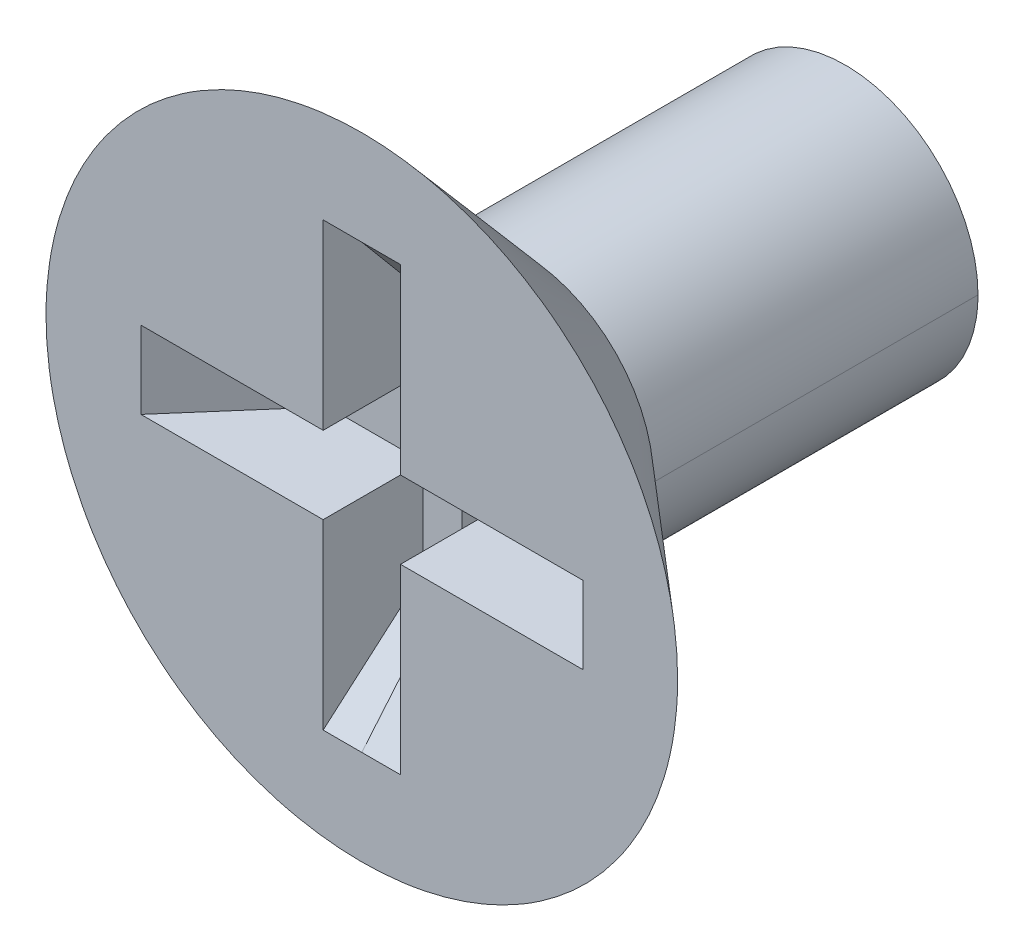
ISO-10303-21;
HEADER;
FILE_DESCRIPTION(('STEP AP214'),'2;1');
FILE_NAME('part.step','',(''),(''),'','','');
FILE_SCHEMA(('AUTOMOTIVE_DESIGN { 1 0 10303 214 1 1 1 1 }'));
ENDSEC;
DATA;
#1=APPLICATION_CONTEXT('core data for automotive mechanical design processes');
#2=APPLICATION_PROTOCOL_DEFINITION('international standard','automotive_design',2000,#1);
#3=PRODUCT_CONTEXT('',#1,'mechanical');
#4=PRODUCT('Part','Part','',(#3));
#5=PRODUCT_RELATED_PRODUCT_CATEGORY('part','',(#4));
#6=PRODUCT_DEFINITION_FORMATION('','',#4);
#7=PRODUCT_DEFINITION_CONTEXT('part definition',#1,'design');
#8=PRODUCT_DEFINITION('design','',#6,#7);
#9=PRODUCT_DEFINITION_SHAPE('','',#8);
#10=(LENGTH_UNIT() NAMED_UNIT(*) SI_UNIT(.MILLI.,.METRE.));
#11=(NAMED_UNIT(*) PLANE_ANGLE_UNIT() SI_UNIT($,.RADIAN.));
#12=(NAMED_UNIT(*) SI_UNIT($,.STERADIAN.) SOLID_ANGLE_UNIT());
#13=UNCERTAINTY_MEASURE_WITH_UNIT(LENGTH_MEASURE(1.E-05),#10,'distance_accuracy_value','');
#14=(GEOMETRIC_REPRESENTATION_CONTEXT(3) GLOBAL_UNCERTAINTY_ASSIGNED_CONTEXT((#13)) GLOBAL_UNIT_ASSIGNED_CONTEXT((#10,
#11,#12)) REPRESENTATION_CONTEXT('',''));
#15=CARTESIAN_POINT('',(0.,0.,0.));
#16=DIRECTION('',(0.,0.,1.));
#17=DIRECTION('',(1.,0.,0.));
#18=AXIS2_PLACEMENT_3D('',#15,#16,#17);
#19=CARTESIAN_POINT('',(0.,2.1766160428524,-0.984980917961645));
#20=DIRECTION('',(-1.,0.,0.));
#21=DIRECTION('',(0.,-1.,0.));
#22=AXIS2_PLACEMENT_3D('',#19,#20,#21);
#23=PLANE('',#22);
#24=CARTESIAN_POINT('',(0.,2.1766160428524,0.));
#25=CARTESIAN_POINT('',(0.,2.09835907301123,-0.0656653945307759));
#26=CARTESIAN_POINT('',(0.,2.02010210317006,-0.131330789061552));
#27=CARTESIAN_POINT('',(0.,1.86358816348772,-0.262661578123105));
#28=CARTESIAN_POINT('',(0.,1.78533119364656,-0.328326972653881));
#29=CARTESIAN_POINT('',(0.,1.62881725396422,-0.459657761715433));
#30=CARTESIAN_POINT('',(0.,1.55056028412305,-0.52532315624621));
#31=CARTESIAN_POINT('',(0.,1.39404634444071,-0.656653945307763));
#32=CARTESIAN_POINT('',(0.,1.31578937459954,-0.722319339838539));
#33=CARTESIAN_POINT('',(0.,1.15927543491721,-0.853650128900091));
#34=CARTESIAN_POINT('',(0.,1.08101846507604,-0.919315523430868));
#35=CARTESIAN_POINT('',(0.,1.00276149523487,-0.984980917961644));
#36=B_SPLINE_CURVE_WITH_KNOTS('',3,(#24,#25,#26,#27,#28,#29,#30,#31,#32,#33,#34,#35),
.UNSPECIFIED.,.F.,.F.,(4,2,2,2,2,4),(0.,0.2,0.4,0.6,0.8,1.),.UNSPECIFIED.);
#37=CARTESIAN_POINT('',(0.,2.1766160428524,0.));
#38=VERTEX_POINT('',#37);
#39=CARTESIAN_POINT('',(0.,1.00276149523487,-0.984980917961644));
#40=VERTEX_POINT('',#39);
#41=EDGE_CURVE('E29',#38,#40,#36,.T.);
#42=ORIENTED_EDGE('',*,*,#41,.F.);
#43=CARTESIAN_POINT('',(0.,2.1766160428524,0.));
#44=CARTESIAN_POINT('',(0.,2.11953398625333,-0.0656653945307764));
#45=CARTESIAN_POINT('',(0.,2.06245192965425,-0.131330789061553));
#46=CARTESIAN_POINT('',(0.,1.9482878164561,-0.262661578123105));
#47=CARTESIAN_POINT('',(0.,1.89120575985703,-0.328326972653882));
#48=CARTESIAN_POINT('',(0.,1.77704164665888,-0.459657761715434));
#49=CARTESIAN_POINT('',(0.,1.71995959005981,-0.525323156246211));
#50=CARTESIAN_POINT('',(0.,1.60579547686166,-0.656653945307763));
#51=CARTESIAN_POINT('',(0.,1.54871342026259,-0.72231933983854));
#52=CARTESIAN_POINT('',(0.,1.43454930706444,-0.853650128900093));
#53=CARTESIAN_POINT('',(0.,1.37746725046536,-0.919315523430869));
#54=CARTESIAN_POINT('',(0.,1.32038519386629,-0.984980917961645));
#55=B_SPLINE_CURVE_WITH_KNOTS('',3,(#43,#44,#45,#46,#47,#48,#49,#50,#51,#52,#53,#54),
.UNSPECIFIED.,.F.,.F.,(4,2,2,2,2,4),(0.,0.2,0.4,0.6,0.8,1.),.UNSPECIFIED.);
#56=CARTESIAN_POINT('',(0.,1.32038519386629,-0.984980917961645));
#57=VERTEX_POINT('',#56);
#58=EDGE_CURVE('E10',#38,#57,#55,.T.);
#59=ORIENTED_EDGE('',*,*,#58,.T.);
#60=CARTESIAN_POINT('',(0.,1.32038519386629,-0.984980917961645));
#61=CARTESIAN_POINT('',(0.,1.2992102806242,-0.984980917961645));
#62=CARTESIAN_POINT('',(0.,1.2780353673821,-0.984980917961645));
#63=CARTESIAN_POINT('',(0.,1.23568554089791,-0.984980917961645));
#64=CARTESIAN_POINT('',(0.,1.21451062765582,-0.984980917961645));
#65=CARTESIAN_POINT('',(0.,1.17216080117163,-0.984980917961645));
#66=CARTESIAN_POINT('',(0.,1.15098588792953,-0.984980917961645));
#67=CARTESIAN_POINT('',(0.,1.10863606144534,-0.984980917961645));
#68=CARTESIAN_POINT('',(0.,1.08746114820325,-0.984980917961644));
#69=CARTESIAN_POINT('',(0.,1.04511132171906,-0.984980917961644));
#70=CARTESIAN_POINT('',(0.,1.02393640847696,-0.984980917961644));
#71=CARTESIAN_POINT('',(0.,1.00276149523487,-0.984980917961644));
#72=B_SPLINE_CURVE_WITH_KNOTS('',3,(#60,#61,#62,#63,#64,#65,#66,#67,#68,#69,#70,#71),
.UNSPECIFIED.,.F.,.F.,(4,2,2,2,2,4),(0.,0.2,0.4,0.6,0.8,1.),.UNSPECIFIED.);
#73=EDGE_CURVE('E24',#57,#40,#72,.T.);
#74=ORIENTED_EDGE('',*,*,#73,.T.);
#75=EDGE_LOOP('',(#42,#59,#74));
#76=FACE_BOUND('',#75,.T.);
#77=ADVANCED_FACE('F15',(#76),#23,.T.);
#78=CARTESIAN_POINT('',(0.381,2.1766160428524,0.));
#79=DIRECTION('',(0.,-0.642787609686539,0.766044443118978));
#80=DIRECTION('',(-1.,0.,0.));
#81=AXIS2_PLACEMENT_3D('',#78,#79,#80);
#82=PLANE('',#81);
#83=CARTESIAN_POINT('',(0.381,2.1766160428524,0.));
#84=CARTESIAN_POINT('',(0.381,2.06414525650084,-0.0943741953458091));
#85=CARTESIAN_POINT('',(0.381,1.95167447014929,-0.188748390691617));
#86=CARTESIAN_POINT('',(0.381,1.72673289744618,-0.377496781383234));
#87=CARTESIAN_POINT('',(0.381,1.61426211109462,-0.471870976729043));
#88=CARTESIAN_POINT('',(0.381,1.38932053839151,-0.660619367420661));
#89=CARTESIAN_POINT('',(0.381,1.27684975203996,-0.754993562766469));
#90=CARTESIAN_POINT('',(0.381,1.05190817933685,-0.943741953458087));
#91=CARTESIAN_POINT('',(0.381,0.939437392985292,-1.0381161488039));
#92=CARTESIAN_POINT('',(0.381,0.714495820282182,-1.22686453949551));
#93=CARTESIAN_POINT('',(0.381,0.602025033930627,-1.32123873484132));
#94=CARTESIAN_POINT('',(0.381,0.489554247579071,-1.41561293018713));
#95=B_SPLINE_CURVE_WITH_KNOTS('',3,(#83,#84,#85,#86,#87,#88,#89,#90,#91,#92,#93,#94),
.UNSPECIFIED.,.F.,.F.,(4,2,2,2,2,4),(0.,0.2,0.4,0.6,0.8,1.),.UNSPECIFIED.);
#96=CARTESIAN_POINT('',(0.381,2.1766160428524,0.));
#97=VERTEX_POINT('',#96);
#98=CARTESIAN_POINT('',(0.381,0.489554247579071,-1.41561293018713));
#99=VERTEX_POINT('',#98);
#100=EDGE_CURVE('E506',#97,#99,#95,.T.);
#101=ORIENTED_EDGE('',*,*,#100,.F.);
#102=CARTESIAN_POINT('',(0.,2.1766160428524,0.));
#103=CARTESIAN_POINT('',(0.0254000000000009,2.1766160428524,0.));
#104=CARTESIAN_POINT('',(0.0507999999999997,2.1766160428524,0.));
#105=CARTESIAN_POINT('',(0.1016,2.1766160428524,0.));
#106=CARTESIAN_POINT('',(0.127,2.1766160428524,0.));
#107=CARTESIAN_POINT('',(0.1778,2.1766160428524,0.));
#108=CARTESIAN_POINT('',(0.2032,2.1766160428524,0.));
#109=CARTESIAN_POINT('',(0.254000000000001,2.1766160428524,0.));
#110=CARTESIAN_POINT('',(0.279399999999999,2.1766160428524,0.));
#111=CARTESIAN_POINT('',(0.3302,2.1766160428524,0.));
#112=CARTESIAN_POINT('',(0.3556,2.1766160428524,0.));
#113=CARTESIAN_POINT('',(0.381000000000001,2.1766160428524,0.));
#114=B_SPLINE_CURVE_WITH_KNOTS('',3,(#102,#103,#104,#105,#106,#107,#108,#109,#110,#111,#112,
#113),.UNSPECIFIED.,.F.,.F.,(4,2,2,2,2,4),(0.,0.2,0.4,0.6,0.8,1.),.UNSPECIFIED.);
#115=EDGE_CURVE('E474',#38,#97,#114,.T.);
#116=ORIENTED_EDGE('',*,*,#115,.F.);
#117=ORIENTED_EDGE('',*,*,#41,.T.);
#118=CARTESIAN_POINT('',(0.,1.00276149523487,-0.984980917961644));
#119=CARTESIAN_POINT('',(0.,0.968547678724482,-1.01368971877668));
#120=CARTESIAN_POINT('',(0.,0.934333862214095,-1.04239851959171));
#121=CARTESIAN_POINT('',(0.,0.865906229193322,-1.09981612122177));
#122=CARTESIAN_POINT('',(0.,0.831692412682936,-1.12852492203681));
#123=CARTESIAN_POINT('',(0.,0.763264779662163,-1.18594252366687));
#124=CARTESIAN_POINT('',(0.,0.729050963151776,-1.2146513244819));
#125=CARTESIAN_POINT('',(0.,0.660623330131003,-1.27206892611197));
#126=CARTESIAN_POINT('',(0.,0.626409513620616,-1.300777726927));
#127=CARTESIAN_POINT('',(0.,0.557981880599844,-1.35819532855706));
#128=CARTESIAN_POINT('',(0.,0.523768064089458,-1.3869041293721));
#129=CARTESIAN_POINT('',(0.,0.489554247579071,-1.41561293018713));
#130=B_SPLINE_CURVE_WITH_KNOTS('',3,(#118,#119,#120,#121,#122,#123,#124,#125,#126,#127,#128,
#129),.UNSPECIFIED.,.F.,.F.,(4,2,2,2,2,4),(0.,0.2,0.4,0.6,0.8,1.),.UNSPECIFIED.);
#131=CARTESIAN_POINT('',(0.,0.489554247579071,-1.41561293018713));
#132=VERTEX_POINT('',#131);
#133=EDGE_CURVE('E520',#40,#132,#130,.T.);
#134=ORIENTED_EDGE('',*,*,#133,.T.);
#135=CARTESIAN_POINT('',(0.,0.489554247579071,-1.41561293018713));
#136=CARTESIAN_POINT('',(0.0254,0.489554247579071,-1.41561293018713));
#137=CARTESIAN_POINT('',(0.0507999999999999,0.489554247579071,-1.41561293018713));
#138=CARTESIAN_POINT('',(0.1016,0.489554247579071,-1.41561293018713));
#139=CARTESIAN_POINT('',(0.127,0.489554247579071,-1.41561293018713));
#140=CARTESIAN_POINT('',(0.1778,0.489554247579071,-1.41561293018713));
#141=CARTESIAN_POINT('',(0.2032,0.489554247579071,-1.41561293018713));
#142=CARTESIAN_POINT('',(0.254,0.489554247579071,-1.41561293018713));
#143=CARTESIAN_POINT('',(0.2794,0.489554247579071,-1.41561293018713));
#144=CARTESIAN_POINT('',(0.3302,0.489554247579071,-1.41561293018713));
#145=CARTESIAN_POINT('',(0.3556,0.489554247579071,-1.41561293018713));
#146=CARTESIAN_POINT('',(0.381,0.489554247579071,-1.41561293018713));
#147=B_SPLINE_CURVE_WITH_KNOTS('',3,(#135,#136,#137,#138,#139,#140,#141,#142,#143,#144,#145,
#146),.UNSPECIFIED.,.F.,.F.,(4,2,2,2,2,4),(0.,0.2,0.4,0.6,0.8,1.),.UNSPECIFIED.);
#148=EDGE_CURVE('E518',#132,#99,#147,.T.);
#149=ORIENTED_EDGE('',*,*,#148,.T.);
#150=EDGE_LOOP('',(#101,#116,#117,#134,#149));
#151=FACE_BOUND('',#150,.T.);
#152=ADVANCED_FACE('F556',(#151),#82,.T.);
#153=CARTESIAN_POINT('',(-0.381,1.32038519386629,-0.984980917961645));
#154=DIRECTION('',(0.,-0.754709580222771,0.656059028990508));
#155=DIRECTION('',(1.,0.,0.));
#156=AXIS2_PLACEMENT_3D('',#153,#154,#155);
#157=PLANE('',#156);
#158=CARTESIAN_POINT('',(-0.381,1.32038519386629,-0.984980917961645));
#159=CARTESIAN_POINT('',(-0.381,1.37746725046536,-0.919315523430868));
#160=CARTESIAN_POINT('',(-0.381,1.43454930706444,-0.853650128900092));
#161=CARTESIAN_POINT('',(-0.381,1.54871342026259,-0.722319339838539));
#162=CARTESIAN_POINT('',(-0.381,1.60579547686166,-0.656653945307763));
#163=CARTESIAN_POINT('',(-0.381,1.71995959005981,-0.525323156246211));
#164=CARTESIAN_POINT('',(-0.381,1.77704164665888,-0.459657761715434));
#165=CARTESIAN_POINT('',(-0.381,1.89120575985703,-0.328326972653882));
#166=CARTESIAN_POINT('',(-0.381,1.9482878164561,-0.262661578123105));
#167=CARTESIAN_POINT('',(-0.381,2.06245192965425,-0.131330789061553));
#168=CARTESIAN_POINT('',(-0.381,2.11953398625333,-0.0656653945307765));
#169=CARTESIAN_POINT('',(-0.381,2.1766160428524,0.));
#170=B_SPLINE_CURVE_WITH_KNOTS('',3,(#158,#159,#160,#161,#162,#163,#164,#165,#166,#167,#168,
#169),.UNSPECIFIED.,.F.,.F.,(4,2,2,2,2,4),(0.,0.2,0.4,0.6,0.8,1.),.UNSPECIFIED.);
#171=CARTESIAN_POINT('',(-0.381,1.32038519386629,-0.984980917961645));
#172=VERTEX_POINT('',#171);
#173=CARTESIAN_POINT('',(-0.381,2.1766160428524,0.));
#174=VERTEX_POINT('',#173);
#175=EDGE_CURVE('E430',#172,#174,#170,.T.);
#176=ORIENTED_EDGE('',*,*,#175,.F.);
#177=CARTESIAN_POINT('',(0.,1.32038519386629,-0.984980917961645));
#178=CARTESIAN_POINT('',(-0.0254,1.32038519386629,-0.984980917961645));
#179=CARTESIAN_POINT('',(-0.0508,1.32038519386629,-0.984980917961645));
#180=CARTESIAN_POINT('',(-0.1016,1.32038519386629,-0.984980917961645));
#181=CARTESIAN_POINT('',(-0.127,1.32038519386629,-0.984980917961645));
#182=CARTESIAN_POINT('',(-0.1778,1.32038519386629,-0.984980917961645));
#183=CARTESIAN_POINT('',(-0.2032,1.32038519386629,-0.984980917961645));
#184=CARTESIAN_POINT('',(-0.254,1.32038519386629,-0.984980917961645));
#185=CARTESIAN_POINT('',(-0.2794,1.32038519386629,-0.984980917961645));
#186=CARTESIAN_POINT('',(-0.3302,1.32038519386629,-0.984980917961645));
#187=CARTESIAN_POINT('',(-0.3556,1.32038519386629,-0.984980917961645));
#188=CARTESIAN_POINT('',(-0.381,1.32038519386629,-0.984980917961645));
#189=B_SPLINE_CURVE_WITH_KNOTS('',3,(#177,#178,#179,#180,#181,#182,#183,#184,#185,#186,#187,
#188),.UNSPECIFIED.,.F.,.F.,(4,2,2,2,2,4),(0.,0.2,0.4,0.6,0.8,1.),.UNSPECIFIED.);
#190=EDGE_CURVE('E511',#57,#172,#189,.T.);
#191=ORIENTED_EDGE('',*,*,#190,.F.);
#192=ORIENTED_EDGE('',*,*,#58,.F.);
#193=CARTESIAN_POINT('',(-0.381,2.1766160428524,0.));
#194=CARTESIAN_POINT('',(-0.355599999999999,2.1766160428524,0.));
#195=CARTESIAN_POINT('',(-0.330199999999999,2.1766160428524,0.));
#196=CARTESIAN_POINT('',(-0.279399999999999,2.1766160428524,0.));
#197=CARTESIAN_POINT('',(-0.254,2.1766160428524,0.));
#198=CARTESIAN_POINT('',(-0.2032,2.1766160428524,0.));
#199=CARTESIAN_POINT('',(-0.1778,2.1766160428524,0.));
#200=CARTESIAN_POINT('',(-0.127,2.1766160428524,0.));
#201=CARTESIAN_POINT('',(-0.1016,2.1766160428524,0.));
#202=CARTESIAN_POINT('',(-0.0508000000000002,2.1766160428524,0.));
#203=CARTESIAN_POINT('',(-0.0254000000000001,2.1766160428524,0.));
#204=CARTESIAN_POINT('',(0.,2.1766160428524,0.));
#205=B_SPLINE_CURVE_WITH_KNOTS('',3,(#193,#194,#195,#196,#197,#198,#199,#200,#201,#202,#203,
#204),.UNSPECIFIED.,.F.,.F.,(4,2,2,2,2,4),(0.,0.2,0.4,0.6,0.8,1.),.UNSPECIFIED.);
#206=EDGE_CURVE('E478',#174,#38,#205,.T.);
#207=ORIENTED_EDGE('',*,*,#206,.F.);
#208=EDGE_LOOP('',(#176,#191,#192,#207));
#209=FACE_BOUND('',#208,.T.);
#210=ADVANCED_FACE('F565',(#209),#157,.T.);
#211=CARTESIAN_POINT('',(0.,-1.32038519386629,-0.984980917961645));
#212=DIRECTION('',(0.,0.,1.));
#213=DIRECTION('',(0.,1.,0.));
#214=AXIS2_PLACEMENT_3D('',#211,#212,#213);
#215=PLANE('',#214);
#216=CARTESIAN_POINT('',(-1.32038519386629,0.381,-0.984980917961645));
#217=CARTESIAN_POINT('',(-1.2577595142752,0.381,-0.984980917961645));
#218=CARTESIAN_POINT('',(-1.19513383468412,0.381,-0.984980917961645));
#219=CARTESIAN_POINT('',(-1.06988247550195,0.381,-0.984980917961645));
#220=CARTESIAN_POINT('',(-1.00725679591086,0.381,-0.984980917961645));
#221=CARTESIAN_POINT('',(-0.882005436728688,0.381,-0.984980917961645));
#222=CARTESIAN_POINT('',(-0.819379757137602,0.381,-0.984980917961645));
#223=CARTESIAN_POINT('',(-0.69412839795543,0.381,-0.984980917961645));
#224=CARTESIAN_POINT('',(-0.631502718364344,0.381,-0.984980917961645));
#225=CARTESIAN_POINT('',(-0.506251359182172,0.381,-0.984980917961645));
#226=CARTESIAN_POINT('',(-0.443625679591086,0.381,-0.984980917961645));
#227=CARTESIAN_POINT('',(-0.381,0.381,-0.984980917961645));
#228=B_SPLINE_CURVE_WITH_KNOTS('',3,(#216,#217,#218,#219,#220,#221,#222,#223,#224,#225,#226,
#227),.UNSPECIFIED.,.F.,.F.,(4,2,2,2,2,4),(0.,0.2,0.4,0.6,0.8,1.),.UNSPECIFIED.);
#229=CARTESIAN_POINT('',(-1.32038519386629,0.381,-0.984980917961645));
#230=VERTEX_POINT('',#229);
#231=CARTESIAN_POINT('',(-0.381,0.381,-0.984980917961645));
#232=VERTEX_POINT('',#231);
#233=EDGE_CURVE('E417',#230,#232,#228,.T.);
#234=ORIENTED_EDGE('',*,*,#233,.F.);
#235=CARTESIAN_POINT('',(-1.32038519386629,0.381,-0.984980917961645));
#236=CARTESIAN_POINT('',(-1.32038519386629,0.3302,-0.984980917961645));
#237=CARTESIAN_POINT('',(-1.32038519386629,0.279400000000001,-0.984980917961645));
#238=CARTESIAN_POINT('',(-1.32038519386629,0.177800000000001,-0.984980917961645));
#239=CARTESIAN_POINT('',(-1.32038519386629,0.127000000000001,-0.984980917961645));
#240=CARTESIAN_POINT('',(-1.32038519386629,0.0254000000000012,-0.984980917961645));
#241=CARTESIAN_POINT('',(-1.32038519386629,-0.0254000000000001,-0.984980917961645));
#242=CARTESIAN_POINT('',(-1.32038519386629,-0.127,-0.984980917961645));
#243=CARTESIAN_POINT('',(-1.32038519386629,-0.1778,-0.984980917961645));
#244=CARTESIAN_POINT('',(-1.32038519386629,-0.2794,-0.984980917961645));
#245=CARTESIAN_POINT('',(-1.32038519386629,-0.3302,-0.984980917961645));
#246=CARTESIAN_POINT('',(-1.32038519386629,-0.381,-0.984980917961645));
#247=B_SPLINE_CURVE_WITH_KNOTS('',3,(#235,#236,#237,#238,#239,#240,#241,#242,#243,#244,#245,
#246),.UNSPECIFIED.,.F.,.F.,(4,2,2,2,2,4),(0.,0.2,0.4,0.6,0.8,1.),.UNSPECIFIED.);
#248=CARTESIAN_POINT('',(-1.32038519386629,-0.381,-0.984980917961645));
#249=VERTEX_POINT('',#248);
#250=EDGE_CURVE('E514',#230,#249,#247,.T.);
#251=ORIENTED_EDGE('',*,*,#250,.T.);
#252=CARTESIAN_POINT('',(-0.381,-0.381,-0.984980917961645));
#253=CARTESIAN_POINT('',(-0.443625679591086,-0.381,-0.984980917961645));
#254=CARTESIAN_POINT('',(-0.506251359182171,-0.381,-0.984980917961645));
#255=CARTESIAN_POINT('',(-0.631502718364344,-0.381,-0.984980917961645));
#256=CARTESIAN_POINT('',(-0.69412839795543,-0.381,-0.984980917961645));
#257=CARTESIAN_POINT('',(-0.819379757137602,-0.381,-0.984980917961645));
#258=CARTESIAN_POINT('',(-0.882005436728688,-0.381,-0.984980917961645));
#259=CARTESIAN_POINT('',(-1.00725679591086,-0.381,-0.984980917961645));
#260=CARTESIAN_POINT('',(-1.06988247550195,-0.381,-0.984980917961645));
#261=CARTESIAN_POINT('',(-1.19513383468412,-0.381,-0.984980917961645));
#262=CARTESIAN_POINT('',(-1.2577595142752,-0.381,-0.984980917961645));
#263=CARTESIAN_POINT('',(-1.32038519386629,-0.381,-0.984980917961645));
#264=B_SPLINE_CURVE_WITH_KNOTS('',3,(#252,#253,#254,#255,#256,#257,#258,#259,#260,#261,#262,
#263),.UNSPECIFIED.,.F.,.F.,(4,2,2,2,2,4),(0.,0.2,0.4,0.6,0.8,1.),.UNSPECIFIED.);
#265=CARTESIAN_POINT('',(-0.381,-0.381,-0.984980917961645));
#266=VERTEX_POINT('',#265);
#267=EDGE_CURVE('E408',#266,#249,#264,.T.);
#268=ORIENTED_EDGE('',*,*,#267,.F.);
#269=CARTESIAN_POINT('',(-0.381,-1.32038519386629,-0.984980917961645));
#270=CARTESIAN_POINT('',(-0.381,-1.2577595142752,-0.984980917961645));
#271=CARTESIAN_POINT('',(-0.381,-1.19513383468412,-0.984980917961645));
#272=CARTESIAN_POINT('',(-0.381,-1.06988247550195,-0.984980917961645));
#273=CARTESIAN_POINT('',(-0.381,-1.00725679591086,-0.984980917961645));
#274=CARTESIAN_POINT('',(-0.381,-0.882005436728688,-0.984980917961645));
#275=CARTESIAN_POINT('',(-0.381,-0.819379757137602,-0.984980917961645));
#276=CARTESIAN_POINT('',(-0.381,-0.69412839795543,-0.984980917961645));
#277=CARTESIAN_POINT('',(-0.381,-0.631502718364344,-0.984980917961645));
#278=CARTESIAN_POINT('',(-0.381,-0.506251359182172,-0.984980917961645));
#279=CARTESIAN_POINT('',(-0.381,-0.443625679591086,-0.984980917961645));
#280=CARTESIAN_POINT('',(-0.381,-0.381,-0.984980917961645));
#281=B_SPLINE_CURVE_WITH_KNOTS('',3,(#269,#270,#271,#272,#273,#274,#275,#276,#277,#278,#279,
#280),.UNSPECIFIED.,.F.,.F.,(4,2,2,2,2,4),(0.,0.2,0.4,0.6,0.8,1.),.UNSPECIFIED.);
#282=CARTESIAN_POINT('',(-0.381,-1.32038519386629,-0.984980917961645));
#283=VERTEX_POINT('',#282);
#284=EDGE_CURVE('E394',#283,#266,#281,.T.);
#285=ORIENTED_EDGE('',*,*,#284,.F.);
#286=CARTESIAN_POINT('',(0.,-1.32038519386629,-0.984980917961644));
#287=CARTESIAN_POINT('',(-0.0254,-1.32038519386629,-0.984980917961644));
#288=CARTESIAN_POINT('',(-0.0508,-1.32038519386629,-0.984980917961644));
#289=CARTESIAN_POINT('',(-0.1016,-1.32038519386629,-0.984980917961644));
#290=CARTESIAN_POINT('',(-0.127,-1.32038519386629,-0.984980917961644));
#291=CARTESIAN_POINT('',(-0.1778,-1.32038519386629,-0.984980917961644));
#292=CARTESIAN_POINT('',(-0.2032,-1.32038519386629,-0.984980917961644));
#293=CARTESIAN_POINT('',(-0.254,-1.32038519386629,-0.984980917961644));
#294=CARTESIAN_POINT('',(-0.2794,-1.32038519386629,-0.984980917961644));
#295=CARTESIAN_POINT('',(-0.3302,-1.32038519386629,-0.984980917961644));
#296=CARTESIAN_POINT('',(-0.3556,-1.32038519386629,-0.984980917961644));
#297=CARTESIAN_POINT('',(-0.381,-1.32038519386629,-0.984980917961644));
#298=B_SPLINE_CURVE_WITH_KNOTS('',3,(#286,#287,#288,#289,#290,#291,#292,#293,#294,#295,#296,
#297),.UNSPECIFIED.,.F.,.F.,(4,2,2,2,2,4),(0.,0.2,0.4,0.6,0.8,1.),.UNSPECIFIED.);
#299=CARTESIAN_POINT('',(0.,-1.32038519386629,-0.984980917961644));
#300=VERTEX_POINT('',#299);
#301=EDGE_CURVE('E391',#300,#283,#298,.T.);
#302=ORIENTED_EDGE('',*,*,#301,.F.);
#303=CARTESIAN_POINT('',(0.,-1.00276149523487,-0.984980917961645));
#304=CARTESIAN_POINT('',(0.,-1.02393640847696,-0.984980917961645));
#305=CARTESIAN_POINT('',(0.,-1.04511132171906,-0.984980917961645));
#306=CARTESIAN_POINT('',(0.,-1.08746114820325,-0.984980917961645));
#307=CARTESIAN_POINT('',(0.,-1.10863606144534,-0.984980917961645));
#308=CARTESIAN_POINT('',(0.,-1.15098588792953,-0.984980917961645));
#309=CARTESIAN_POINT('',(0.,-1.17216080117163,-0.984980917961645));
#310=CARTESIAN_POINT('',(0.,-1.21451062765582,-0.984980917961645));
#311=CARTESIAN_POINT('',(0.,-1.23568554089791,-0.984980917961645));
#312=CARTESIAN_POINT('',(0.,-1.2780353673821,-0.984980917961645));
#313=CARTESIAN_POINT('',(0.,-1.2992102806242,-0.984980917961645));
#314=CARTESIAN_POINT('',(0.,-1.32038519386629,-0.984980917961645));
#315=B_SPLINE_CURVE_WITH_KNOTS('',3,(#303,#304,#305,#306,#307,#308,#309,#310,#311,#312,#313,
#314),.UNSPECIFIED.,.F.,.F.,(4,2,2,2,2,4),(0.,0.2,0.4,0.600000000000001,0.8,1.),.UNSPECIFIED.);
#316=CARTESIAN_POINT('',(0.,-1.00276149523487,-0.984980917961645));
#317=VERTEX_POINT('',#316);
#318=EDGE_CURVE('E386',#317,#300,#315,.T.);
#319=ORIENTED_EDGE('',*,*,#318,.F.);
#320=CARTESIAN_POINT('',(0.,1.00276149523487,-0.984980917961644));
#321=CARTESIAN_POINT('',(0.,0.869059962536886,-0.984980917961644));
#322=CARTESIAN_POINT('',(0.,0.735358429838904,-0.984980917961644));
#323=CARTESIAN_POINT('',(0.,0.467955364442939,-0.984980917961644));
#324=CARTESIAN_POINT('',(0.,0.334253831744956,-0.984980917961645));
#325=CARTESIAN_POINT('',(0.,0.066850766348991,-0.984980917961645));
#326=CARTESIAN_POINT('',(0.,-0.0668507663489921,-0.984980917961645));
#327=CARTESIAN_POINT('',(0.,-0.334253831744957,-0.984980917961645));
#328=CARTESIAN_POINT('',(0.,-0.46795536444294,-0.984980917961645));
#329=CARTESIAN_POINT('',(0.,-0.735358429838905,-0.984980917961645));
#330=CARTESIAN_POINT('',(0.,-0.869059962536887,-0.984980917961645));
#331=CARTESIAN_POINT('',(0.,-1.00276149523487,-0.984980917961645));
#332=B_SPLINE_CURVE_WITH_KNOTS('',3,(#320,#321,#322,#323,#324,#325,#326,#327,#328,#329,#330,
#331),.UNSPECIFIED.,.F.,.F.,(4,2,2,2,2,4),(0.,0.2,0.4,0.6,0.8,1.),.UNSPECIFIED.);
#333=EDGE_CURVE('E448',#40,#317,#332,.T.);
#334=ORIENTED_EDGE('',*,*,#333,.F.);
#335=ORIENTED_EDGE('',*,*,#73,.F.);
#336=ORIENTED_EDGE('',*,*,#190,.T.);
#337=CARTESIAN_POINT('',(-0.381,0.381,-0.984980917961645));
#338=CARTESIAN_POINT('',(-0.381,0.443625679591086,-0.984980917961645));
#339=CARTESIAN_POINT('',(-0.381,0.506251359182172,-0.984980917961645));
#340=CARTESIAN_POINT('',(-0.381,0.631502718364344,-0.984980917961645));
#341=CARTESIAN_POINT('',(-0.381,0.69412839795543,-0.984980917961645));
#342=CARTESIAN_POINT('',(-0.381,0.819379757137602,-0.984980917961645));
#343=CARTESIAN_POINT('',(-0.381,0.882005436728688,-0.984980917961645));
#344=CARTESIAN_POINT('',(-0.381,1.00725679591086,-0.984980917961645));
#345=CARTESIAN_POINT('',(-0.381,1.06988247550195,-0.984980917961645));
#346=CARTESIAN_POINT('',(-0.381,1.19513383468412,-0.984980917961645));
#347=CARTESIAN_POINT('',(-0.381,1.2577595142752,-0.984980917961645));
#348=CARTESIAN_POINT('',(-0.381,1.32038519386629,-0.984980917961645));
#349=B_SPLINE_CURVE_WITH_KNOTS('',3,(#337,#338,#339,#340,#341,#342,#343,#344,#345,#346,#347,
#348),.UNSPECIFIED.,.F.,.F.,(4,2,2,2,2,4),(0.,0.2,0.4,0.6,0.8,1.),.UNSPECIFIED.);
#350=EDGE_CURVE('E434',#232,#172,#349,.T.);
#351=ORIENTED_EDGE('',*,*,#350,.F.);
#352=EDGE_LOOP('',(#234,#251,#268,#285,#302,#319,#334,#335,#336,#351));
#353=FACE_BOUND('',#352,.T.);
#354=ADVANCED_FACE('F645',(#353),#215,.T.);
#355=CARTESIAN_POINT('',(0.381,2.1766160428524,-1.41561293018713));
#356=DIRECTION('',(-1.,0.,0.));
#357=DIRECTION('',(0.,-1.,0.));
#358=AXIS2_PLACEMENT_3D('',#355,#356,#357);
#359=PLANE('',#358);
#360=CARTESIAN_POINT('',(0.381,0.381,-0.984980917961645));
#361=CARTESIAN_POINT('',(0.381,0.381,-0.919315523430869));
#362=CARTESIAN_POINT('',(0.381,0.380999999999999,-0.853650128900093));
#363=CARTESIAN_POINT('',(0.381,0.380999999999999,-0.72231933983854));
#364=CARTESIAN_POINT('',(0.381,0.381,-0.656653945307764));
#365=CARTESIAN_POINT('',(0.381,0.381,-0.525323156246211));
#366=CARTESIAN_POINT('',(0.381,0.381,-0.459657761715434));
#367=CARTESIAN_POINT('',(0.381,0.381,-0.328326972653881));
#368=CARTESIAN_POINT('',(0.381,0.381,-0.262661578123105));
#369=CARTESIAN_POINT('',(0.381,0.381,-0.131330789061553));
#370=CARTESIAN_POINT('',(0.381,0.381,-0.065665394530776));
#371=CARTESIAN_POINT('',(0.381,0.381,0.));
#372=B_SPLINE_CURVE_WITH_KNOTS('',3,(#360,#361,#362,#363,#364,#365,#366,#367,#368,#369,#370,
#371),.UNSPECIFIED.,.F.,.F.,(4,2,2,2,2,4),(0.,0.2,0.4,0.6,0.8,1.),.UNSPECIFIED.);
#373=CARTESIAN_POINT('',(0.381,0.381,-0.984980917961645));
#374=VERTEX_POINT('',#373);
#375=CARTESIAN_POINT('',(0.381,0.381,0.));
#376=VERTEX_POINT('',#375);
#377=EDGE_CURVE('E509',#374,#376,#372,.T.);
#378=ORIENTED_EDGE('',*,*,#377,.T.);
#379=CARTESIAN_POINT('',(0.381000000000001,2.1766160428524,0.));
#380=CARTESIAN_POINT('',(0.381000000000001,2.05690830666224,0.));
#381=CARTESIAN_POINT('',(0.381000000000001,1.93720057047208,0.));
#382=CARTESIAN_POINT('',(0.381000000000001,1.69778509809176,0.));
#383=CARTESIAN_POINT('',(0.381000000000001,1.5780773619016,0.));
#384=CARTESIAN_POINT('',(0.381000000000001,1.33866188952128,0.));
#385=CARTESIAN_POINT('',(0.381000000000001,1.21895415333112,0.));
#386=CARTESIAN_POINT('',(0.381000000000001,0.9795386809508,0.));
#387=CARTESIAN_POINT('',(0.381000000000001,0.859830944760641,0.));
#388=CARTESIAN_POINT('',(0.381000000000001,0.62041547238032,0.));
#389=CARTESIAN_POINT('',(0.381000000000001,0.50070773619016,0.));
#390=CARTESIAN_POINT('',(0.381000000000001,0.381,0.));
#391=B_SPLINE_CURVE_WITH_KNOTS('',3,(#379,#380,#381,#382,#383,#384,#385,#386,#387,#388,#389,
#390),.UNSPECIFIED.,.F.,.F.,(4,2,2,2,2,4),(0.,0.2,0.4,0.6,0.8,1.),.UNSPECIFIED.);
#392=EDGE_CURVE('E471',#97,#376,#391,.T.);
#393=ORIENTED_EDGE('',*,*,#392,.F.);
#394=ORIENTED_EDGE('',*,*,#100,.T.);
#395=CARTESIAN_POINT('',(0.381,0.489554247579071,-1.41561293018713));
#396=CARTESIAN_POINT('',(0.381,0.424280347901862,-1.41561293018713));
#397=CARTESIAN_POINT('',(0.381,0.359006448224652,-1.41561293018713));
#398=CARTESIAN_POINT('',(0.381,0.228458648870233,-1.41561293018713));
#399=CARTESIAN_POINT('',(0.381,0.163184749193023,-1.41561293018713));
#400=CARTESIAN_POINT('',(0.381,0.0326369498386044,-1.41561293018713));
#401=CARTESIAN_POINT('',(0.381,-0.0326369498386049,-1.41561293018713));
#402=CARTESIAN_POINT('',(0.381,-0.163184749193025,-1.41561293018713));
#403=CARTESIAN_POINT('',(0.381,-0.228458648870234,-1.41561293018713));
#404=CARTESIAN_POINT('',(0.381,-0.359006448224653,-1.41561293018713));
#405=CARTESIAN_POINT('',(0.381,-0.424280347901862,-1.41561293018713));
#406=CARTESIAN_POINT('',(0.381,-0.489554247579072,-1.41561293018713));
#407=B_SPLINE_CURVE_WITH_KNOTS('',3,(#395,#396,#397,#398,#399,#400,#401,#402,#403,#404,#405,
#406),.UNSPECIFIED.,.F.,.F.,(4,2,2,2,2,4),(0.,0.2,0.4,0.6,0.8,1.),.UNSPECIFIED.);
#408=CARTESIAN_POINT('',(0.381,-0.489554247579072,-1.41561293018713));
#409=VERTEX_POINT('',#408);
#410=EDGE_CURVE('E504',#99,#409,#407,.T.);
#411=ORIENTED_EDGE('',*,*,#410,.T.);
#412=CARTESIAN_POINT('',(0.381,-0.489554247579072,-1.41561293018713));
#413=CARTESIAN_POINT('',(0.381,-0.602025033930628,-1.32123873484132));
#414=CARTESIAN_POINT('',(0.381,-0.714495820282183,-1.22686453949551));
#415=CARTESIAN_POINT('',(0.381,-0.939437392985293,-1.0381161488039));
#416=CARTESIAN_POINT('',(0.381,-1.05190817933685,-0.943741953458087));
#417=CARTESIAN_POINT('',(0.381,-1.27684975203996,-0.754993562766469));
#418=CARTESIAN_POINT('',(0.381,-1.38932053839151,-0.660619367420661));
#419=CARTESIAN_POINT('',(0.381,-1.61426211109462,-0.471870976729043));
#420=CARTESIAN_POINT('',(0.381,-1.72673289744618,-0.377496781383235));
#421=CARTESIAN_POINT('',(0.381,-1.95167447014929,-0.188748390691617));
#422=CARTESIAN_POINT('',(0.381,-2.06414525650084,-0.0943741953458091));
#423=CARTESIAN_POINT('',(0.381,-2.1766160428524,0.));
#424=B_SPLINE_CURVE_WITH_KNOTS('',3,(#412,#413,#414,#415,#416,#417,#418,#419,#420,#421,#422,
#423),.UNSPECIFIED.,.F.,.F.,(4,2,2,2,2,4),(0.,0.2,0.4,0.6,0.8,1.),.UNSPECIFIED.);
#425=CARTESIAN_POINT('',(0.381,-2.1766160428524,0.));
#426=VERTEX_POINT('',#425);
#427=EDGE_CURVE('E502',#409,#426,#424,.T.);
#428=ORIENTED_EDGE('',*,*,#427,.T.);
#429=CARTESIAN_POINT('',(0.381000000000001,-0.380999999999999,0.));
#430=CARTESIAN_POINT('',(0.381000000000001,-0.50070773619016,0.));
#431=CARTESIAN_POINT('',(0.381000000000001,-0.620415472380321,0.));
#432=CARTESIAN_POINT('',(0.381000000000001,-0.859830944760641,0.));
#433=CARTESIAN_POINT('',(0.381000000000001,-0.9795386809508,0.));
#434=CARTESIAN_POINT('',(0.381000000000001,-1.21895415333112,0.));
#435=CARTESIAN_POINT('',(0.381000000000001,-1.33866188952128,0.));
#436=CARTESIAN_POINT('',(0.381000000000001,-1.5780773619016,0.));
#437=CARTESIAN_POINT('',(0.381000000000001,-1.69778509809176,0.));
#438=CARTESIAN_POINT('',(0.381000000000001,-1.93720057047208,0.));
#439=CARTESIAN_POINT('',(0.381000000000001,-2.05690830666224,0.));
#440=CARTESIAN_POINT('',(0.381000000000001,-2.1766160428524,0.));
#441=B_SPLINE_CURVE_WITH_KNOTS('',3,(#429,#430,#431,#432,#433,#434,#435,#436,#437,#438,#439,
#440),.UNSPECIFIED.,.F.,.F.,(4,2,2,2,2,4),(0.,0.2,0.4,0.6,0.8,1.),.UNSPECIFIED.);
#442=CARTESIAN_POINT('',(0.381,-0.381,0.));
#443=VERTEX_POINT('',#442);
#444=EDGE_CURVE('E462',#443,#426,#441,.T.);
#445=ORIENTED_EDGE('',*,*,#444,.F.);
#446=CARTESIAN_POINT('',(0.381,-0.381,0.));
#447=CARTESIAN_POINT('',(0.381,-0.381,-0.065665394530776));
#448=CARTESIAN_POINT('',(0.381,-0.381,-0.131330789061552));
#449=CARTESIAN_POINT('',(0.381,-0.381,-0.262661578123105));
#450=CARTESIAN_POINT('',(0.381,-0.381,-0.328326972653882));
#451=CARTESIAN_POINT('',(0.381,-0.381,-0.459657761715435));
#452=CARTESIAN_POINT('',(0.381,-0.381,-0.525323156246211));
#453=CARTESIAN_POINT('',(0.381,-0.381,-0.656653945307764));
#454=CARTESIAN_POINT('',(0.381,-0.381,-0.72231933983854));
#455=CARTESIAN_POINT('',(0.381,-0.381,-0.853650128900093));
#456=CARTESIAN_POINT('',(0.381,-0.381,-0.919315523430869));
#457=CARTESIAN_POINT('',(0.381,-0.381,-0.984980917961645));
#458=B_SPLINE_CURVE_WITH_KNOTS('',3,(#446,#447,#448,#449,#450,#451,#452,#453,#454,#455,#456,
#457),.UNSPECIFIED.,.F.,.F.,(4,2,2,2,2,4),(0.,0.2,0.4,0.6,0.8,1.),.UNSPECIFIED.);
#459=CARTESIAN_POINT('',(0.381,-0.381,-0.984980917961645));
#460=VERTEX_POINT('',#459);
#461=EDGE_CURVE('E499',#443,#460,#458,.T.);
#462=ORIENTED_EDGE('',*,*,#461,.T.);
#463=CARTESIAN_POINT('',(0.381,-0.381,-0.984980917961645));
#464=CARTESIAN_POINT('',(0.381,-0.3302,-0.984980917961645));
#465=CARTESIAN_POINT('',(0.381,-0.279400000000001,-0.984980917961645));
#466=CARTESIAN_POINT('',(0.381,-0.1778,-0.984980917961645));
#467=CARTESIAN_POINT('',(0.381,-0.127,-0.984980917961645));
#468=CARTESIAN_POINT('',(0.381,-0.0254000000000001,-0.984980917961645));
#469=CARTESIAN_POINT('',(0.381,0.0254000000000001,-0.984980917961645));
#470=CARTESIAN_POINT('',(0.381,0.127,-0.984980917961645));
#471=CARTESIAN_POINT('',(0.381,0.177799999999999,-0.984980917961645));
#472=CARTESIAN_POINT('',(0.381,0.2794,-0.984980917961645));
#473=CARTESIAN_POINT('',(0.381,0.3302,-0.984980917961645));
#474=CARTESIAN_POINT('',(0.381,0.381,-0.984980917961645));
#475=B_SPLINE_CURVE_WITH_KNOTS('',3,(#463,#464,#465,#466,#467,#468,#469,#470,#471,#472,#473,
#474),.UNSPECIFIED.,.F.,.F.,(4,2,2,2,2,4),(0.,0.2,0.4,0.6,0.8,1.),.UNSPECIFIED.);
#476=EDGE_CURVE('E497',#460,#374,#475,.T.);
#477=ORIENTED_EDGE('',*,*,#476,.T.);
#478=EDGE_LOOP('',(#378,#393,#394,#411,#428,#445,#462,#477));
#479=FACE_BOUND('',#478,.T.);
#480=ADVANCED_FACE('F654',(#479),#359,.T.);
#481=CARTESIAN_POINT('',(-3.1115,-3.19933097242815,0.));
#482=DIRECTION('',(0.,0.,1.));
#483=DIRECTION('',(1.,0.,0.));
#484=AXIS2_PLACEMENT_3D('',#481,#482,#483);
#485=PLANE('',#484);
#486=CARTESIAN_POINT('',(3.1115,0.,0.));
#487=CARTESIAN_POINT('',(3.11134114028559,0.391004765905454,0.));
#488=CARTESIAN_POINT('',(3.03695786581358,0.781885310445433,0.));
#489=CARTESIAN_POINT('',(2.75485324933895,1.4944434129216,0.));
#490=CARTESIAN_POINT('',(2.55280345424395,1.81802093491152,0.));
#491=CARTESIAN_POINT('',(1.99660383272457,2.42842338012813,0.));
#492=CARTESIAN_POINT('',(1.62009816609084,2.69438872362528,0.));
#493=CARTESIAN_POINT('',(0.80613756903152,3.03630334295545,0.));
#494=CARTESIAN_POINT('',(0.372221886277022,3.11931488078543,0.));
#495=CARTESIAN_POINT('',(-0.475163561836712,3.10296049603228,0.));
#496=CARTESIAN_POINT('',(-0.888441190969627,3.01083528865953,0.));
#497=CARTESIAN_POINT('',(-1.63146604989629,2.67928350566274,0.));
#498=CARTESIAN_POINT('',(-1.96364991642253,2.44617422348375,0.));
#499=CARTESIAN_POINT('',(-2.50575312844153,1.88382659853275,0.));
#500=CARTESIAN_POINT('',(-2.71983128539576,1.55897249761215,0.));
#501=CARTESIAN_POINT('',(-3.02825410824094,0.825689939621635,0.));
#502=CARTESIAN_POINT('',(-3.11133223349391,0.412927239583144,0.));
#503=CARTESIAN_POINT('',(-3.1115,0.,0.));
#504=B_SPLINE_CURVE_WITH_KNOTS('',3,(#486,#487,#488,#489,#490,#491,#492,#493,#494,#495,#496,
#497,#498,#499,#500,#501,#502,#503),.UNSPECIFIED.,.F.,.F.,(4,2,2,2,2,2,2,2,4),(0.,0.12,0.2352,
0.37344,0.5061504,0.633552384,0.75585828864,0.8732719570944,1.),.UNSPECIFIED.);
#505=CARTESIAN_POINT('',(3.1115,0.,0.));
#506=VERTEX_POINT('',#505);
#507=CARTESIAN_POINT('',(-3.1115,0.,0.));
#508=VERTEX_POINT('',#507);
#509=EDGE_CURVE('E494',#506,#508,#504,.T.);
#510=ORIENTED_EDGE('',*,*,#509,.T.);
#511=CARTESIAN_POINT('',(-3.1115,0.,0.));
#512=CARTESIAN_POINT('',(-3.11134114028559,-0.391004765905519,0.));
#513=CARTESIAN_POINT('',(-3.03695786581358,-0.781885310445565,0.));
#514=CARTESIAN_POINT('',(-2.75485324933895,-1.49444341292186,0.));
#515=CARTESIAN_POINT('',(-2.55280345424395,-1.81802093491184,0.));
#516=CARTESIAN_POINT('',(-1.99660383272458,-2.42842338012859,0.));
#517=CARTESIAN_POINT('',(-1.62009816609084,-2.69438872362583,0.));
#518=CARTESIAN_POINT('',(-0.806137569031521,-3.03630334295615,0.));
#519=CARTESIAN_POINT('',(-0.372221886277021,-3.11931488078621,0.));
#520=CARTESIAN_POINT('',(0.475163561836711,-3.1029604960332,0.));
#521=CARTESIAN_POINT('',(0.888441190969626,-3.01083528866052,0.));
#522=CARTESIAN_POINT('',(1.63146604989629,-2.67928350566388,0.));
#523=CARTESIAN_POINT('',(1.96364991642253,-2.44617422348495,0.));
#524=CARTESIAN_POINT('',(2.50575312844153,-1.88382659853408,0.));
#525=CARTESIAN_POINT('',(2.71983128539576,-1.55897249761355,0.));
#526=CARTESIAN_POINT('',(3.02825410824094,-0.825689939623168,0.));
#527=CARTESIAN_POINT('',(3.11133223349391,-0.412927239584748,0.));
#528=CARTESIAN_POINT('',(3.1115,-1.67400815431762E-12,0.));
#529=B_SPLINE_CURVE_WITH_KNOTS('',3,(#511,#512,#513,#514,#515,#516,#517,#518,#519,#520,#521,
#522,#523,#524,#525,#526,#527,#528),.UNSPECIFIED.,.F.,.F.,(4,2,2,2,2,2,2,2,4),(0.,0.12,0.2352,
0.37344,0.506150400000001,0.633552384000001,0.75585828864,0.8732719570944,1.),.UNSPECIFIED.);
#530=EDGE_CURVE('E342',#508,#506,#529,.T.);
#531=ORIENTED_EDGE('',*,*,#530,.T.);
#532=EDGE_LOOP('',(#510,#531));
#533=FACE_BOUND('',#532,.T.);
#534=CARTESIAN_POINT('',(-0.381,-2.1766160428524,0.));
#535=CARTESIAN_POINT('',(-0.381,-2.05690830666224,0.));
#536=CARTESIAN_POINT('',(-0.381,-1.93720057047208,0.));
#537=CARTESIAN_POINT('',(-0.381,-1.69778509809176,0.));
#538=CARTESIAN_POINT('',(-0.381,-1.5780773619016,0.));
#539=CARTESIAN_POINT('',(-0.381,-1.33866188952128,0.));
#540=CARTESIAN_POINT('',(-0.381,-1.21895415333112,0.));
#541=CARTESIAN_POINT('',(-0.381,-0.979538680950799,0.));
#542=CARTESIAN_POINT('',(-0.381,-0.859830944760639,0.));
#543=CARTESIAN_POINT('',(-0.381,-0.620415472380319,0.));
#544=CARTESIAN_POINT('',(-0.381,-0.50070773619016,0.));
#545=CARTESIAN_POINT('',(-0.381,-0.380999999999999,0.));
#546=B_SPLINE_CURVE_WITH_KNOTS('',3,(#534,#535,#536,#537,#538,#539,#540,#541,#542,#543,#544,
#545),.UNSPECIFIED.,.F.,.F.,(4,2,2,2,2,4),(0.,0.2,0.4,0.6,0.8,1.),.UNSPECIFIED.);
#547=CARTESIAN_POINT('',(-0.381,-2.1766160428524,0.));
#548=VERTEX_POINT('',#547);
#549=CARTESIAN_POINT('',(-0.381,-0.381,0.));
#550=VERTEX_POINT('',#549);
#551=EDGE_CURVE('E491',#548,#550,#546,.T.);
#552=ORIENTED_EDGE('',*,*,#551,.T.);
#553=CARTESIAN_POINT('',(-0.381,-0.380999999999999,0.));
#554=CARTESIAN_POINT('',(-0.50070773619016,-0.380999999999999,0.));
#555=CARTESIAN_POINT('',(-0.62041547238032,-0.380999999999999,0.));
#556=CARTESIAN_POINT('',(-0.85983094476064,-0.380999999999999,0.));
#557=CARTESIAN_POINT('',(-0.9795386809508,-0.380999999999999,0.));
#558=CARTESIAN_POINT('',(-1.21895415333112,-0.380999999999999,0.));
#559=CARTESIAN_POINT('',(-1.33866188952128,-0.381,0.));
#560=CARTESIAN_POINT('',(-1.5780773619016,-0.381,0.));
#561=CARTESIAN_POINT('',(-1.69778509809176,-0.380999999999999,0.));
#562=CARTESIAN_POINT('',(-1.93720057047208,-0.380999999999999,0.));
#563=CARTESIAN_POINT('',(-2.05690830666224,-0.380999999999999,0.));
#564=CARTESIAN_POINT('',(-2.1766160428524,-0.380999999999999,0.));
#565=B_SPLINE_CURVE_WITH_KNOTS('',3,(#553,#554,#555,#556,#557,#558,#559,#560,#561,#562,#563,
#564),.UNSPECIFIED.,.F.,.F.,(4,2,2,2,2,4),(0.,0.2,0.4,0.6,0.8,1.),.UNSPECIFIED.);
#566=CARTESIAN_POINT('',(-2.1766160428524,-0.381,0.));
#567=VERTEX_POINT('',#566);
#568=EDGE_CURVE('E488',#550,#567,#565,.T.);
#569=ORIENTED_EDGE('',*,*,#568,.T.);
#570=CARTESIAN_POINT('',(-2.1766160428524,-0.380999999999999,0.));
#571=CARTESIAN_POINT('',(-2.1766160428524,-0.3302,0.));
#572=CARTESIAN_POINT('',(-2.1766160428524,-0.279399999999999,0.));
#573=CARTESIAN_POINT('',(-2.1766160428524,-0.177799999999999,0.));
#574=CARTESIAN_POINT('',(-2.1766160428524,-0.127,0.));
#575=CARTESIAN_POINT('',(-2.1766160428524,-0.0253999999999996,0.));
#576=CARTESIAN_POINT('',(-2.1766160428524,0.0254000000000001,0.));
#577=CARTESIAN_POINT('',(-2.1766160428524,0.127,0.));
#578=CARTESIAN_POINT('',(-2.1766160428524,0.1778,0.));
#579=CARTESIAN_POINT('',(-2.1766160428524,0.2794,0.));
#580=CARTESIAN_POINT('',(-2.1766160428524,0.3302,0.));
#581=CARTESIAN_POINT('',(-2.1766160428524,0.381,0.));
#582=B_SPLINE_CURVE_WITH_KNOTS('',3,(#570,#571,#572,#573,#574,#575,#576,#577,#578,#579,#580,
#581),.UNSPECIFIED.,.F.,.F.,(4,2,2,2,2,4),(0.,0.2,0.4,0.6,0.8,1.),.UNSPECIFIED.);
#583=CARTESIAN_POINT('',(-2.1766160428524,0.381000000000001,0.));
#584=VERTEX_POINT('',#583);
#585=EDGE_CURVE('E486',#567,#584,#582,.T.);
#586=ORIENTED_EDGE('',*,*,#585,.T.);
#587=CARTESIAN_POINT('',(-2.1766160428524,0.381,0.));
#588=CARTESIAN_POINT('',(-2.05690830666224,0.381,0.));
#589=CARTESIAN_POINT('',(-1.93720057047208,0.381,0.));
#590=CARTESIAN_POINT('',(-1.69778509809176,0.381,0.));
#591=CARTESIAN_POINT('',(-1.5780773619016,0.381,0.));
#592=CARTESIAN_POINT('',(-1.33866188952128,0.381,0.));
#593=CARTESIAN_POINT('',(-1.21895415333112,0.381,0.));
#594=CARTESIAN_POINT('',(-0.9795386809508,0.381,0.));
#595=CARTESIAN_POINT('',(-0.85983094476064,0.381,0.));
#596=CARTESIAN_POINT('',(-0.620415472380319,0.381,0.));
#597=CARTESIAN_POINT('',(-0.500707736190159,0.381,0.));
#598=CARTESIAN_POINT('',(-0.381,0.381,0.));
#599=B_SPLINE_CURVE_WITH_KNOTS('',3,(#587,#588,#589,#590,#591,#592,#593,#594,#595,#596,#597,
#598),.UNSPECIFIED.,.F.,.F.,(4,2,2,2,2,4),(0.,0.2,0.4,0.6,0.8,1.),.UNSPECIFIED.);
#600=CARTESIAN_POINT('',(-0.381000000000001,0.381000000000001,0.));
#601=VERTEX_POINT('',#600);
#602=EDGE_CURVE('E484',#584,#601,#599,.T.);
#603=ORIENTED_EDGE('',*,*,#602,.T.);
#604=CARTESIAN_POINT('',(-0.381,0.381,0.));
#605=CARTESIAN_POINT('',(-0.381,0.50070773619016,0.));
#606=CARTESIAN_POINT('',(-0.381,0.62041547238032,0.));
#607=CARTESIAN_POINT('',(-0.381,0.859830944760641,0.));
#608=CARTESIAN_POINT('',(-0.381,0.9795386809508,0.));
#609=CARTESIAN_POINT('',(-0.381,1.21895415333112,0.));
#610=CARTESIAN_POINT('',(-0.381,1.33866188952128,0.));
#611=CARTESIAN_POINT('',(-0.381,1.5780773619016,0.));
#612=CARTESIAN_POINT('',(-0.381,1.69778509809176,0.));
#613=CARTESIAN_POINT('',(-0.381,1.93720057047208,0.));
#614=CARTESIAN_POINT('',(-0.381,2.05690830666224,0.));
#615=CARTESIAN_POINT('',(-0.381,2.1766160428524,0.));
#616=B_SPLINE_CURVE_WITH_KNOTS('',3,(#604,#605,#606,#607,#608,#609,#610,#611,#612,#613,#614,
#615),.UNSPECIFIED.,.F.,.F.,(4,2,2,2,2,4),(0.,0.2,0.4,0.6,0.8,1.),.UNSPECIFIED.);
#617=EDGE_CURVE('E481',#601,#174,#616,.T.);
#618=ORIENTED_EDGE('',*,*,#617,.T.);
#619=ORIENTED_EDGE('',*,*,#206,.T.);
#620=ORIENTED_EDGE('',*,*,#115,.T.);
#621=ORIENTED_EDGE('',*,*,#392,.T.);
#622=CARTESIAN_POINT('',(0.381000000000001,0.381,0.));
#623=CARTESIAN_POINT('',(0.50070773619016,0.381,0.));
#624=CARTESIAN_POINT('',(0.620415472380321,0.381,0.));
#625=CARTESIAN_POINT('',(0.859830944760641,0.381,0.));
#626=CARTESIAN_POINT('',(0.979538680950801,0.381,0.));
#627=CARTESIAN_POINT('',(1.21895415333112,0.381,0.));
#628=CARTESIAN_POINT('',(1.33866188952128,0.381,0.));
#629=CARTESIAN_POINT('',(1.5780773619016,0.381,0.));
#630=CARTESIAN_POINT('',(1.69778509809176,0.381,0.));
#631=CARTESIAN_POINT('',(1.93720057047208,0.381,0.));
#632=CARTESIAN_POINT('',(2.05690830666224,0.381,0.));
#633=CARTESIAN_POINT('',(2.1766160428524,0.381,0.));
#634=B_SPLINE_CURVE_WITH_KNOTS('',3,(#622,#623,#624,#625,#626,#627,#628,#629,#630,#631,#632,
#633),.UNSPECIFIED.,.F.,.F.,(4,2,2,2,2,4),(0.,0.2,0.4,0.6,0.8,1.),.UNSPECIFIED.);
#635=CARTESIAN_POINT('',(2.1766160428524,0.381000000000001,0.));
#636=VERTEX_POINT('',#635);
#637=EDGE_CURVE('E469',#376,#636,#634,.T.);
#638=ORIENTED_EDGE('',*,*,#637,.T.);
#639=CARTESIAN_POINT('',(2.1766160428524,0.381,0.));
#640=CARTESIAN_POINT('',(2.1766160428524,0.3302,0.));
#641=CARTESIAN_POINT('',(2.1766160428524,0.2794,0.));
#642=CARTESIAN_POINT('',(2.1766160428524,0.1778,0.));
#643=CARTESIAN_POINT('',(2.1766160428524,0.127,0.));
#644=CARTESIAN_POINT('',(2.1766160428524,0.0254000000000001,0.));
#645=CARTESIAN_POINT('',(2.1766160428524,-0.0253999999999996,0.));
#646=CARTESIAN_POINT('',(2.1766160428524,-0.127,0.));
#647=CARTESIAN_POINT('',(2.1766160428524,-0.1778,0.));
#648=CARTESIAN_POINT('',(2.1766160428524,-0.2794,0.));
#649=CARTESIAN_POINT('',(2.1766160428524,-0.3302,0.));
#650=CARTESIAN_POINT('',(2.1766160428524,-0.380999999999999,0.));
#651=B_SPLINE_CURVE_WITH_KNOTS('',3,(#639,#640,#641,#642,#643,#644,#645,#646,#647,#648,#649,
#650),.UNSPECIFIED.,.F.,.F.,(4,2,2,2,2,4),(0.,0.2,0.4,0.6,0.8,1.),.UNSPECIFIED.);
#652=CARTESIAN_POINT('',(2.1766160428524,-0.381,0.));
#653=VERTEX_POINT('',#652);
#654=EDGE_CURVE('E294',#636,#653,#651,.T.);
#655=ORIENTED_EDGE('',*,*,#654,.T.);
#656=CARTESIAN_POINT('',(2.1766160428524,-0.380999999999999,0.));
#657=CARTESIAN_POINT('',(2.05690830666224,-0.380999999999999,0.));
#658=CARTESIAN_POINT('',(1.93720057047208,-0.380999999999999,0.));
#659=CARTESIAN_POINT('',(1.69778509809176,-0.380999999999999,0.));
#660=CARTESIAN_POINT('',(1.5780773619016,-0.380999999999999,0.));
#661=CARTESIAN_POINT('',(1.33866188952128,-0.380999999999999,0.));
#662=CARTESIAN_POINT('',(1.21895415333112,-0.380999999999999,0.));
#663=CARTESIAN_POINT('',(0.979538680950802,-0.380999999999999,0.));
#664=CARTESIAN_POINT('',(0.85983094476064,-0.380999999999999,0.));
#665=CARTESIAN_POINT('',(0.62041547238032,-0.380999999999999,0.));
#666=CARTESIAN_POINT('',(0.50070773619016,-0.380999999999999,0.));
#667=CARTESIAN_POINT('',(0.381000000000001,-0.380999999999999,0.));
#668=B_SPLINE_CURVE_WITH_KNOTS('',3,(#656,#657,#658,#659,#660,#661,#662,#663,#664,#665,#666,
#667),.UNSPECIFIED.,.F.,.F.,(4,2,2,2,2,4),(0.,0.2,0.4,0.6,0.8,1.),.UNSPECIFIED.);
#669=EDGE_CURVE('E465',#653,#443,#668,.T.);
#670=ORIENTED_EDGE('',*,*,#669,.T.);
#671=ORIENTED_EDGE('',*,*,#444,.T.);
#672=CARTESIAN_POINT('',(0.381000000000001,-2.1766160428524,0.));
#673=CARTESIAN_POINT('',(0.3556,-2.1766160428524,0.));
#674=CARTESIAN_POINT('',(0.3302,-2.1766160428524,0.));
#675=CARTESIAN_POINT('',(0.279399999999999,-2.1766160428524,0.));
#676=CARTESIAN_POINT('',(0.254000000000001,-2.1766160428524,0.));
#677=CARTESIAN_POINT('',(0.2032,-2.1766160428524,0.));
#678=CARTESIAN_POINT('',(0.177800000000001,-2.1766160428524,0.));
#679=CARTESIAN_POINT('',(0.127,-2.1766160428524,0.));
#680=CARTESIAN_POINT('',(0.101600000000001,-2.1766160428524,0.));
#681=CARTESIAN_POINT('',(0.0508000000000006,-2.1766160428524,0.));
#682=CARTESIAN_POINT('',(0.0254000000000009,-2.1766160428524,0.));
#683=CARTESIAN_POINT('',(0.,-2.1766160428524,0.));
#684=B_SPLINE_CURVE_WITH_KNOTS('',3,(#672,#673,#674,#675,#676,#677,#678,#679,#680,#681,#682,
#683),.UNSPECIFIED.,.F.,.F.,(4,2,2,2,2,4),(0.,0.2,0.4,0.6,0.8,1.),.UNSPECIFIED.);
#685=CARTESIAN_POINT('',(0.,-2.1766160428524,0.));
#686=VERTEX_POINT('',#685);
#687=EDGE_CURVE('E458',#426,#686,#684,.T.);
#688=ORIENTED_EDGE('',*,*,#687,.T.);
#689=CARTESIAN_POINT('',(0.,-2.1766160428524,0.));
#690=CARTESIAN_POINT('',(-0.0254000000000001,-2.1766160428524,0.));
#691=CARTESIAN_POINT('',(-0.0507999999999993,-2.1766160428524,0.));
#692=CARTESIAN_POINT('',(-0.101599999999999,-2.1766160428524,0.));
#693=CARTESIAN_POINT('',(-0.127,-2.1766160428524,0.));
#694=CARTESIAN_POINT('',(-0.1778,-2.1766160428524,0.));
#695=CARTESIAN_POINT('',(-0.2032,-2.1766160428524,0.));
#696=CARTESIAN_POINT('',(-0.254,-2.1766160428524,0.));
#697=CARTESIAN_POINT('',(-0.2794,-2.1766160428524,0.));
#698=CARTESIAN_POINT('',(-0.3302,-2.1766160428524,0.));
#699=CARTESIAN_POINT('',(-0.355599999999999,-2.1766160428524,0.));
#700=CARTESIAN_POINT('',(-0.381,-2.1766160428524,0.));
#701=B_SPLINE_CURVE_WITH_KNOTS('',3,(#689,#690,#691,#692,#693,#694,#695,#696,#697,#698,#699,
#700),.UNSPECIFIED.,.F.,.F.,(4,2,2,2,2,4),(0.,0.2,0.4,0.6,0.8,1.),.UNSPECIFIED.);
#702=EDGE_CURVE('E453',#686,#548,#701,.T.);
#703=ORIENTED_EDGE('',*,*,#702,.T.);
#704=EDGE_LOOP('',(#552,#569,#586,#603,#618,#619,#620,#621,#638,#655,#670,#671,#688,#703));
#705=FACE_BOUND('',#704,.T.);
#706=ADVANCED_FACE('F986',(#533,#705),#485,.T.);
#707=CARTESIAN_POINT('',(0.,1.00276149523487,-1.41561293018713));
#708=DIRECTION('',(1.,0.,0.));
#709=DIRECTION('',(0.,0.,1.));
#710=AXIS2_PLACEMENT_3D('',#707,#708,#709);
#711=PLANE('',#710);
#712=ORIENTED_EDGE('',*,*,#333,.T.);
#713=CARTESIAN_POINT('',(0.,-0.489554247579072,-1.41561293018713));
#714=CARTESIAN_POINT('',(0.,-0.523768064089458,-1.3869041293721));
#715=CARTESIAN_POINT('',(0.,-0.557981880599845,-1.35819532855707));
#716=CARTESIAN_POINT('',(0.,-0.626409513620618,-1.300777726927));
#717=CARTESIAN_POINT('',(0.,-0.660623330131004,-1.27206892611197));
#718=CARTESIAN_POINT('',(0.,-0.729050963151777,-1.2146513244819));
#719=CARTESIAN_POINT('',(0.,-0.763264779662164,-1.18594252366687));
#720=CARTESIAN_POINT('',(0.,-0.831692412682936,-1.12852492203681));
#721=CARTESIAN_POINT('',(0.,-0.865906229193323,-1.09981612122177));
#722=CARTESIAN_POINT('',(0.,-0.934333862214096,-1.04239851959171));
#723=CARTESIAN_POINT('',(0.,-0.968547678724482,-1.01368971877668));
#724=CARTESIAN_POINT('',(0.,-1.00276149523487,-0.984980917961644));
#725=B_SPLINE_CURVE_WITH_KNOTS('',3,(#713,#714,#715,#716,#717,#718,#719,#720,#721,#722,#723,
#724),.UNSPECIFIED.,.F.,.F.,(4,2,2,2,2,4),(0.,0.2,0.4,0.6,0.8,1.),.UNSPECIFIED.);
#726=CARTESIAN_POINT('',(0.,-0.489554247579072,-1.41561293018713));
#727=VERTEX_POINT('',#726);
#728=EDGE_CURVE('E369',#727,#317,#725,.T.);
#729=ORIENTED_EDGE('',*,*,#728,.F.);
#730=CARTESIAN_POINT('',(0.,0.489554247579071,-1.41561293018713));
#731=CARTESIAN_POINT('',(0.,0.424280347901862,-1.41561293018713));
#732=CARTESIAN_POINT('',(0.,0.359006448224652,-1.41561293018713));
#733=CARTESIAN_POINT('',(0.,0.228458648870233,-1.41561293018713));
#734=CARTESIAN_POINT('',(0.,0.163184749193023,-1.41561293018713));
#735=CARTESIAN_POINT('',(0.,0.0326369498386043,-1.41561293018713));
#736=CARTESIAN_POINT('',(0.,-0.0326369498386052,-1.41561293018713));
#737=CARTESIAN_POINT('',(0.,-0.163184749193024,-1.41561293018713));
#738=CARTESIAN_POINT('',(0.,-0.228458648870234,-1.41561293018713));
#739=CARTESIAN_POINT('',(0.,-0.359006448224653,-1.41561293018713));
#740=CARTESIAN_POINT('',(0.,-0.424280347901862,-1.41561293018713));
#741=CARTESIAN_POINT('',(0.,-0.489554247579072,-1.41561293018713));
#742=B_SPLINE_CURVE_WITH_KNOTS('',3,(#730,#731,#732,#733,#734,#735,#736,#737,#738,#739,#740,
#741),.UNSPECIFIED.,.F.,.F.,(4,2,2,2,2,4),(0.,0.2,0.4,0.6,0.8,1.),.UNSPECIFIED.);
#743=EDGE_CURVE('E442',#132,#727,#742,.T.);
#744=ORIENTED_EDGE('',*,*,#743,.F.);
#745=ORIENTED_EDGE('',*,*,#133,.F.);
#746=EDGE_LOOP('',(#712,#729,#744,#745));
#747=FACE_BOUND('',#746,.T.);
#748=ADVANCED_FACE('F989',(#747),#711,.T.);
#749=CARTESIAN_POINT('',(0.381,-0.489554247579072,-1.41561293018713));
#750=DIRECTION('',(0.,0.,1.));
#751=DIRECTION('',(0.,1.,0.));
#752=AXIS2_PLACEMENT_3D('',#749,#750,#751);
#753=PLANE('',#752);
#754=ORIENTED_EDGE('',*,*,#410,.F.);
#755=ORIENTED_EDGE('',*,*,#148,.F.);
#756=ORIENTED_EDGE('',*,*,#743,.T.);
#757=CARTESIAN_POINT('',(0.,-0.489554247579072,-1.41561293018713));
#758=CARTESIAN_POINT('',(0.0254,-0.489554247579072,-1.41561293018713));
#759=CARTESIAN_POINT('',(0.0507999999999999,-0.489554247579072,-1.41561293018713));
#760=CARTESIAN_POINT('',(0.1016,-0.489554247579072,-1.41561293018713));
#761=CARTESIAN_POINT('',(0.127,-0.489554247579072,-1.41561293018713));
#762=CARTESIAN_POINT('',(0.1778,-0.489554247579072,-1.41561293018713));
#763=CARTESIAN_POINT('',(0.2032,-0.489554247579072,-1.41561293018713));
#764=CARTESIAN_POINT('',(0.254,-0.489554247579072,-1.41561293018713));
#765=CARTESIAN_POINT('',(0.2794,-0.489554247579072,-1.41561293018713));
#766=CARTESIAN_POINT('',(0.3302,-0.489554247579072,-1.41561293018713));
#767=CARTESIAN_POINT('',(0.3556,-0.489554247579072,-1.41561293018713));
#768=CARTESIAN_POINT('',(0.381,-0.489554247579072,-1.41561293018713));
#769=B_SPLINE_CURVE_WITH_KNOTS('',3,(#757,#758,#759,#760,#761,#762,#763,#764,#765,#766,#767,
#768),.UNSPECIFIED.,.F.,.F.,(4,2,2,2,2,4),(0.,0.2,0.4,0.6,0.8,1.),.UNSPECIFIED.);
#770=EDGE_CURVE('E439',#727,#409,#769,.T.);
#771=ORIENTED_EDGE('',*,*,#770,.T.);
#772=EDGE_LOOP('',(#754,#755,#756,#771));
#773=FACE_BOUND('',#772,.T.);
#774=ADVANCED_FACE('F992',(#773),#753,.T.);
#775=CARTESIAN_POINT('',(-0.381,2.1766160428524,-0.984980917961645));
#776=DIRECTION('',(1.,0.,0.));
#777=DIRECTION('',(0.,0.,1.));
#778=AXIS2_PLACEMENT_3D('',#775,#776,#777);
#779=PLANE('',#778);
#780=CARTESIAN_POINT('',(-0.381,0.381,-0.984980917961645));
#781=CARTESIAN_POINT('',(-0.381,0.381,-0.919315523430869));
#782=CARTESIAN_POINT('',(-0.380999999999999,0.381,-0.853650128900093));
#783=CARTESIAN_POINT('',(-0.380999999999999,0.381,-0.72231933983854));
#784=CARTESIAN_POINT('',(-0.381,0.381,-0.656653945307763));
#785=CARTESIAN_POINT('',(-0.381,0.381,-0.525323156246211));
#786=CARTESIAN_POINT('',(-0.381,0.381,-0.459657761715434));
#787=CARTESIAN_POINT('',(-0.381,0.381,-0.328326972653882));
#788=CARTESIAN_POINT('',(-0.381,0.381,-0.262661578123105));
#789=CARTESIAN_POINT('',(-0.381,0.381,-0.131330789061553));
#790=CARTESIAN_POINT('',(-0.381,0.381,-0.0656653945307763));
#791=CARTESIAN_POINT('',(-0.381,0.381,0.));
#792=B_SPLINE_CURVE_WITH_KNOTS('',3,(#780,#781,#782,#783,#784,#785,#786,#787,#788,#789,#790,
#791),.UNSPECIFIED.,.F.,.F.,(4,2,2,2,2,4),(0.,0.2,0.4,0.6,0.8,1.),.UNSPECIFIED.);
#793=EDGE_CURVE('E425',#232,#601,#792,.T.);
#794=ORIENTED_EDGE('',*,*,#793,.F.);
#795=ORIENTED_EDGE('',*,*,#350,.T.);
#796=ORIENTED_EDGE('',*,*,#175,.T.);
#797=ORIENTED_EDGE('',*,*,#617,.F.);
#798=EDGE_LOOP('',(#794,#795,#796,#797));
#799=FACE_BOUND('',#798,.T.);
#800=ADVANCED_FACE('F996',(#799),#779,.T.);
#801=CARTESIAN_POINT('',(-2.1766160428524,0.381,-0.984980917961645));
#802=DIRECTION('',(0.,-1.,0.));
#803=DIRECTION('',(1.,0.,0.));
#804=AXIS2_PLACEMENT_3D('',#801,#802,#803);
#805=PLANE('',#804);
#806=ORIENTED_EDGE('',*,*,#793,.T.);
#807=ORIENTED_EDGE('',*,*,#602,.F.);
#808=CARTESIAN_POINT('',(-2.1766160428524,0.381,0.));
#809=CARTESIAN_POINT('',(-2.11953398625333,0.381,-0.0656653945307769));
#810=CARTESIAN_POINT('',(-2.06245192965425,0.381,-0.131330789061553));
#811=CARTESIAN_POINT('',(-1.9482878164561,0.381,-0.262661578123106));
#812=CARTESIAN_POINT('',(-1.89120575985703,0.381,-0.328326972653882));
#813=CARTESIAN_POINT('',(-1.77704164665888,0.381,-0.459657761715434));
#814=CARTESIAN_POINT('',(-1.71995959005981,0.381,-0.525323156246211));
#815=CARTESIAN_POINT('',(-1.60579547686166,0.381,-0.656653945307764));
#816=CARTESIAN_POINT('',(-1.54871342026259,0.381,-0.72231933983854));
#817=CARTESIAN_POINT('',(-1.43454930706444,0.381,-0.853650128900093));
#818=CARTESIAN_POINT('',(-1.37746725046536,0.381,-0.919315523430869));
#819=CARTESIAN_POINT('',(-1.32038519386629,0.381,-0.984980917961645));
#820=B_SPLINE_CURVE_WITH_KNOTS('',3,(#808,#809,#810,#811,#812,#813,#814,#815,#816,#817,#818,
#819),.UNSPECIFIED.,.F.,.F.,(4,2,2,2,2,4),(0.,0.2,0.4,0.6,0.8,1.),.UNSPECIFIED.);
#821=EDGE_CURVE('E420',#584,#230,#820,.T.);
#822=ORIENTED_EDGE('',*,*,#821,.T.);
#823=ORIENTED_EDGE('',*,*,#233,.T.);
#824=EDGE_LOOP('',(#806,#807,#822,#823));
#825=FACE_BOUND('',#824,.T.);
#826=ADVANCED_FACE('F1000',(#825),#805,.T.);
#827=CARTESIAN_POINT('',(-2.1766160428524,0.381000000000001,0.));
#828=DIRECTION('',(0.754709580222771,0.,0.656059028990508));
#829=DIRECTION('',(0.,-1.,0.));
#830=AXIS2_PLACEMENT_3D('',#827,#828,#829);
#831=PLANE('',#830);
#832=CARTESIAN_POINT('',(-1.32038519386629,-0.381,-0.984980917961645));
#833=CARTESIAN_POINT('',(-1.37746725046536,-0.381,-0.919315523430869));
#834=CARTESIAN_POINT('',(-1.43454930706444,-0.381,-0.853650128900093));
#835=CARTESIAN_POINT('',(-1.54871342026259,-0.381,-0.72231933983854));
#836=CARTESIAN_POINT('',(-1.60579547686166,-0.381,-0.656653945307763));
#837=CARTESIAN_POINT('',(-1.71995959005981,-0.381,-0.525323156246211));
#838=CARTESIAN_POINT('',(-1.77704164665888,-0.381,-0.459657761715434));
#839=CARTESIAN_POINT('',(-1.89120575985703,-0.381,-0.328326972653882));
#840=CARTESIAN_POINT('',(-1.9482878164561,-0.381,-0.262661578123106));
#841=CARTESIAN_POINT('',(-2.06245192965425,-0.381,-0.131330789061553));
#842=CARTESIAN_POINT('',(-2.11953398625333,-0.381,-0.0656653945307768));
#843=CARTESIAN_POINT('',(-2.1766160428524,-0.381,0.));
#844=B_SPLINE_CURVE_WITH_KNOTS('',3,(#832,#833,#834,#835,#836,#837,#838,#839,#840,#841,#842,
#843),.UNSPECIFIED.,.F.,.F.,(4,2,2,2,2,4),(0.,0.2,0.4,0.6,0.8,1.),.UNSPECIFIED.);
#845=EDGE_CURVE('E404',#249,#567,#844,.T.);
#846=ORIENTED_EDGE('',*,*,#845,.F.);
#847=ORIENTED_EDGE('',*,*,#250,.F.);
#848=ORIENTED_EDGE('',*,*,#821,.F.);
#849=ORIENTED_EDGE('',*,*,#585,.F.);
#850=EDGE_LOOP('',(#846,#847,#848,#849));
#851=FACE_BOUND('',#850,.T.);
#852=ADVANCED_FACE('F1004',(#851),#831,.T.);
#853=CARTESIAN_POINT('',(-2.1766160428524,-0.381,-0.984980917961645));
#854=DIRECTION('',(0.,1.,0.));
#855=DIRECTION('',(0.,0.,1.));
#856=AXIS2_PLACEMENT_3D('',#853,#854,#855);
#857=PLANE('',#856);
#858=CARTESIAN_POINT('',(-0.381,-0.381,0.));
#859=CARTESIAN_POINT('',(-0.381,-0.381,-0.0656653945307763));
#860=CARTESIAN_POINT('',(-0.381,-0.381,-0.131330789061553));
#861=CARTESIAN_POINT('',(-0.381,-0.381,-0.262661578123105));
#862=CARTESIAN_POINT('',(-0.381,-0.381,-0.328326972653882));
#863=CARTESIAN_POINT('',(-0.381,-0.381,-0.459657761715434));
#864=CARTESIAN_POINT('',(-0.381,-0.381,-0.525323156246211));
#865=CARTESIAN_POINT('',(-0.381,-0.381,-0.656653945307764));
#866=CARTESIAN_POINT('',(-0.381,-0.381,-0.72231933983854));
#867=CARTESIAN_POINT('',(-0.381,-0.381,-0.853650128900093));
#868=CARTESIAN_POINT('',(-0.381,-0.381,-0.919315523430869));
#869=CARTESIAN_POINT('',(-0.381,-0.381,-0.984980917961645));
#870=B_SPLINE_CURVE_WITH_KNOTS('',3,(#858,#859,#860,#861,#862,#863,#864,#865,#866,#867,#868,
#869),.UNSPECIFIED.,.F.,.F.,(4,2,2,2,2,4),(0.,0.2,0.4,0.6,0.8,1.),.UNSPECIFIED.);
#871=EDGE_CURVE('E414',#550,#266,#870,.T.);
#872=ORIENTED_EDGE('',*,*,#871,.T.);
#873=ORIENTED_EDGE('',*,*,#267,.T.);
#874=ORIENTED_EDGE('',*,*,#845,.T.);
#875=ORIENTED_EDGE('',*,*,#568,.F.);
#876=EDGE_LOOP('',(#872,#873,#874,#875));
#877=FACE_BOUND('',#876,.T.);
#878=ADVANCED_FACE('F1008',(#877),#857,.T.);
#879=CARTESIAN_POINT('',(-0.381,-0.381,-0.984980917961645));
#880=DIRECTION('',(1.,0.,0.));
#881=DIRECTION('',(0.,0.,1.));
#882=AXIS2_PLACEMENT_3D('',#879,#880,#881);
#883=PLANE('',#882);
#884=ORIENTED_EDGE('',*,*,#871,.F.);
#885=ORIENTED_EDGE('',*,*,#551,.F.);
#886=CARTESIAN_POINT('',(-0.381,-2.1766160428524,0.));
#887=CARTESIAN_POINT('',(-0.381,-2.11953398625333,-0.0656653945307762));
#888=CARTESIAN_POINT('',(-0.381,-2.06245192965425,-0.131330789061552));
#889=CARTESIAN_POINT('',(-0.381,-1.9482878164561,-0.262661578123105));
#890=CARTESIAN_POINT('',(-0.381,-1.89120575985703,-0.328326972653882));
#891=CARTESIAN_POINT('',(-0.381,-1.77704164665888,-0.459657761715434));
#892=CARTESIAN_POINT('',(-0.381,-1.71995959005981,-0.525323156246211));
#893=CARTESIAN_POINT('',(-0.381,-1.60579547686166,-0.656653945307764));
#894=CARTESIAN_POINT('',(-0.381,-1.54871342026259,-0.72231933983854));
#895=CARTESIAN_POINT('',(-0.381,-1.43454930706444,-0.853650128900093));
#896=CARTESIAN_POINT('',(-0.381,-1.37746725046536,-0.919315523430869));
#897=CARTESIAN_POINT('',(-0.381,-1.32038519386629,-0.984980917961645));
#898=B_SPLINE_CURVE_WITH_KNOTS('',3,(#886,#887,#888,#889,#890,#891,#892,#893,#894,#895,#896,
#897),.UNSPECIFIED.,.F.,.F.,(4,2,2,2,2,4),(0.,0.2,0.4,0.6,0.8,1.),.UNSPECIFIED.);
#899=EDGE_CURVE('E399',#548,#283,#898,.T.);
#900=ORIENTED_EDGE('',*,*,#899,.T.);
#901=ORIENTED_EDGE('',*,*,#284,.T.);
#902=EDGE_LOOP('',(#884,#885,#900,#901));
#903=FACE_BOUND('',#902,.T.);
#904=ADVANCED_FACE('F729',(#903),#883,.T.);
#905=CARTESIAN_POINT('',(-0.381,-2.1766160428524,0.));
#906=DIRECTION('',(0.,0.754709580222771,0.656059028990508));
#907=DIRECTION('',(1.,0.,0.));
#908=AXIS2_PLACEMENT_3D('',#905,#906,#907);
#909=PLANE('',#908);
#910=ORIENTED_EDGE('',*,*,#899,.F.);
#911=ORIENTED_EDGE('',*,*,#702,.F.);
#912=CARTESIAN_POINT('',(0.,-1.32038519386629,-0.984980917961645));
#913=CARTESIAN_POINT('',(0.,-1.37746725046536,-0.919315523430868));
#914=CARTESIAN_POINT('',(0.,-1.43454930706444,-0.853650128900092));
#915=CARTESIAN_POINT('',(0.,-1.54871342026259,-0.722319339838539));
#916=CARTESIAN_POINT('',(0.,-1.60579547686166,-0.656653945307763));
#917=CARTESIAN_POINT('',(0.,-1.71995959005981,-0.525323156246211));
#918=CARTESIAN_POINT('',(0.,-1.77704164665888,-0.459657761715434));
#919=CARTESIAN_POINT('',(0.,-1.89120575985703,-0.328326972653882));
#920=CARTESIAN_POINT('',(0.,-1.94828781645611,-0.262661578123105));
#921=CARTESIAN_POINT('',(0.,-2.06245192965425,-0.131330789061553));
#922=CARTESIAN_POINT('',(0.,-2.11953398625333,-0.0656653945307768));
#923=CARTESIAN_POINT('',(0.,-2.1766160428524,0.));
#924=B_SPLINE_CURVE_WITH_KNOTS('',3,(#912,#913,#914,#915,#916,#917,#918,#919,#920,#921,#922,
#923),.UNSPECIFIED.,.F.,.F.,(4,2,2,2,2,4),(0.,0.2,0.4,0.6,0.8,1.),.UNSPECIFIED.);
#925=EDGE_CURVE('E381',#300,#686,#924,.T.);
#926=ORIENTED_EDGE('',*,*,#925,.F.);
#927=ORIENTED_EDGE('',*,*,#301,.T.);
#928=EDGE_LOOP('',(#910,#911,#926,#927));
#929=FACE_BOUND('',#928,.T.);
#930=ADVANCED_FACE('F709',(#929),#909,.T.);
#931=CARTESIAN_POINT('',(0.,-1.00276149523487,-0.984980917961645));
#932=DIRECTION('',(-1.,0.,0.));
#933=DIRECTION('',(0.,-1.,0.));
#934=AXIS2_PLACEMENT_3D('',#931,#932,#933);
#935=PLANE('',#934);
#936=CARTESIAN_POINT('',(0.,-1.00276149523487,-0.984980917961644));
#937=CARTESIAN_POINT('',(0.,-1.08101846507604,-0.919315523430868));
#938=CARTESIAN_POINT('',(0.,-1.15927543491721,-0.853650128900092));
#939=CARTESIAN_POINT('',(0.,-1.31578937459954,-0.722319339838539));
#940=CARTESIAN_POINT('',(0.,-1.39404634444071,-0.656653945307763));
#941=CARTESIAN_POINT('',(0.,-1.55056028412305,-0.525323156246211));
#942=CARTESIAN_POINT('',(0.,-1.62881725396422,-0.459657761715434));
#943=CARTESIAN_POINT('',(0.,-1.78533119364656,-0.328326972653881));
#944=CARTESIAN_POINT('',(0.,-1.86358816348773,-0.262661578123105));
#945=CARTESIAN_POINT('',(0.,-2.02010210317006,-0.131330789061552));
#946=CARTESIAN_POINT('',(0.,-2.09835907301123,-0.0656653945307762));
#947=CARTESIAN_POINT('',(0.,-2.1766160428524,0.));
#948=B_SPLINE_CURVE_WITH_KNOTS('',3,(#936,#937,#938,#939,#940,#941,#942,#943,#944,#945,#946,
#947),.UNSPECIFIED.,.F.,.F.,(4,2,2,2,2,4),(0.,0.2,0.4,0.6,0.8,1.),.UNSPECIFIED.);
#949=EDGE_CURVE('E365',#317,#686,#948,.T.);
#950=ORIENTED_EDGE('',*,*,#949,.F.);
#951=ORIENTED_EDGE('',*,*,#318,.T.);
#952=ORIENTED_EDGE('',*,*,#925,.T.);
#953=EDGE_LOOP('',(#950,#951,#952));
#954=FACE_BOUND('',#953,.T.);
#955=ADVANCED_FACE('F728',(#954),#935,.T.);
#956=CARTESIAN_POINT('',(0.381,0.381,-0.984980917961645));
#957=DIRECTION('',(0.,-1.,0.));
#958=DIRECTION('',(1.,0.,0.));
#959=AXIS2_PLACEMENT_3D('',#956,#957,#958);
#960=PLANE('',#959);
#961=ORIENTED_EDGE('',*,*,#377,.F.);
#962=CARTESIAN_POINT('',(0.381,0.381,-0.984980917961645));
#963=CARTESIAN_POINT('',(0.443625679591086,0.381,-0.984980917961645));
#964=CARTESIAN_POINT('',(0.506251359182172,0.381,-0.984980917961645));
#965=CARTESIAN_POINT('',(0.631502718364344,0.381,-0.984980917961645));
#966=CARTESIAN_POINT('',(0.69412839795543,0.381,-0.984980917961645));
#967=CARTESIAN_POINT('',(0.819379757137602,0.381,-0.984980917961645));
#968=CARTESIAN_POINT('',(0.882005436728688,0.381,-0.984980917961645));
#969=CARTESIAN_POINT('',(1.00725679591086,0.381,-0.984980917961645));
#970=CARTESIAN_POINT('',(1.06988247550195,0.381,-0.984980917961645));
#971=CARTESIAN_POINT('',(1.19513383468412,0.381,-0.984980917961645));
#972=CARTESIAN_POINT('',(1.2577595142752,0.381,-0.984980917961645));
#973=CARTESIAN_POINT('',(1.32038519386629,0.381,-0.984980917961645));
#974=B_SPLINE_CURVE_WITH_KNOTS('',3,(#962,#963,#964,#965,#966,#967,#968,#969,#970,#971,#972,
#973),.UNSPECIFIED.,.F.,.F.,(4,2,2,2,2,4),(0.,0.2,0.4,0.6,0.8,1.),.UNSPECIFIED.);
#975=CARTESIAN_POINT('',(1.32038519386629,0.381,-0.984980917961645));
#976=VERTEX_POINT('',#975);
#977=EDGE_CURVE('E377',#374,#976,#974,.T.);
#978=ORIENTED_EDGE('',*,*,#977,.T.);
#979=CARTESIAN_POINT('',(1.32038519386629,0.381,-0.984980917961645));
#980=CARTESIAN_POINT('',(1.37746725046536,0.381,-0.919315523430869));
#981=CARTESIAN_POINT('',(1.43454930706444,0.381,-0.853650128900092));
#982=CARTESIAN_POINT('',(1.54871342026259,0.381,-0.72231933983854));
#983=CARTESIAN_POINT('',(1.60579547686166,0.381,-0.656653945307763));
#984=CARTESIAN_POINT('',(1.71995959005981,0.381,-0.525323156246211));
#985=CARTESIAN_POINT('',(1.77704164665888,0.381,-0.459657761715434));
#986=CARTESIAN_POINT('',(1.89120575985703,0.381,-0.328326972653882));
#987=CARTESIAN_POINT('',(1.9482878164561,0.381,-0.262661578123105));
#988=CARTESIAN_POINT('',(2.06245192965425,0.381,-0.131330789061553));
#989=CARTESIAN_POINT('',(2.11953398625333,0.381,-0.0656653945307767));
#990=CARTESIAN_POINT('',(2.1766160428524,0.381,0.));
#991=B_SPLINE_CURVE_WITH_KNOTS('',3,(#979,#980,#981,#982,#983,#984,#985,#986,#987,#988,#989,
#990),.UNSPECIFIED.,.F.,.F.,(4,2,2,2,2,4),(0.,0.2,0.4,0.6,0.8,1.),.UNSPECIFIED.);
#992=EDGE_CURVE('E284',#976,#636,#991,.T.);
#993=ORIENTED_EDGE('',*,*,#992,.T.);
#994=ORIENTED_EDGE('',*,*,#637,.F.);
#995=EDGE_LOOP('',(#961,#978,#993,#994));
#996=FACE_BOUND('',#995,.T.);
#997=ADVANCED_FACE('F778',(#996),#960,.T.);
#998=CARTESIAN_POINT('',(0.381,-0.489554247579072,-1.41561293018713));
#999=DIRECTION('',(0.,0.642787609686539,0.766044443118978));
#1000=DIRECTION('',(-1.,0.,0.));
#1001=AXIS2_PLACEMENT_3D('',#998,#999,#1000);
#1002=PLANE('',#1001);
#1003=ORIENTED_EDGE('',*,*,#427,.F.);
#1004=ORIENTED_EDGE('',*,*,#770,.F.);
#1005=ORIENTED_EDGE('',*,*,#728,.T.);
#1006=ORIENTED_EDGE('',*,*,#949,.T.);
#1007=ORIENTED_EDGE('',*,*,#687,.F.);
#1008=EDGE_LOOP('',(#1003,#1004,#1005,#1006,#1007));
#1009=FACE_BOUND('',#1008,.T.);
#1010=ADVANCED_FACE('F787',(#1009),#1002,.T.);
#1011=CARTESIAN_POINT('',(0.381,-0.381,-0.984980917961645));
#1012=DIRECTION('',(0.,1.,0.));
#1013=DIRECTION('',(0.,0.,1.));
#1014=AXIS2_PLACEMENT_3D('',#1011,#1012,#1013);
#1015=PLANE('',#1014);
#1016=ORIENTED_EDGE('',*,*,#461,.F.);
#1017=ORIENTED_EDGE('',*,*,#669,.F.);
#1018=CARTESIAN_POINT('',(2.1766160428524,-0.381,0.));
#1019=CARTESIAN_POINT('',(2.11953398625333,-0.381,-0.0656653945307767));
#1020=CARTESIAN_POINT('',(2.06245192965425,-0.381,-0.131330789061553));
#1021=CARTESIAN_POINT('',(1.9482878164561,-0.381,-0.262661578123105));
#1022=CARTESIAN_POINT('',(1.89120575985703,-0.381,-0.328326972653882));
#1023=CARTESIAN_POINT('',(1.77704164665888,-0.381,-0.459657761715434));
#1024=CARTESIAN_POINT('',(1.71995959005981,-0.381,-0.525323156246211));
#1025=CARTESIAN_POINT('',(1.60579547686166,-0.381,-0.656653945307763));
#1026=CARTESIAN_POINT('',(1.54871342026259,-0.381,-0.722319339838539));
#1027=CARTESIAN_POINT('',(1.43454930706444,-0.381,-0.853650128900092));
#1028=CARTESIAN_POINT('',(1.37746725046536,-0.381,-0.919315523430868));
#1029=CARTESIAN_POINT('',(1.32038519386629,-0.381,-0.984980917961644));
#1030=B_SPLINE_CURVE_WITH_KNOTS('',3,(#1018,#1019,#1020,#1021,#1022,#1023,#1024,#1025,#1026,
#1027,#1028,#1029),.UNSPECIFIED.,.F.,.F.,(4,2,2,2,2,4),(0.,0.2,0.4,0.6,0.8,1.),.UNSPECIFIED.);
#1031=CARTESIAN_POINT('',(1.32038519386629,-0.381,-0.984980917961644));
#1032=VERTEX_POINT('',#1031);
#1033=EDGE_CURVE('E304',#653,#1032,#1030,.T.);
#1034=ORIENTED_EDGE('',*,*,#1033,.T.);
#1035=CARTESIAN_POINT('',(1.32038519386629,-0.381,-0.984980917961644));
#1036=CARTESIAN_POINT('',(1.2577595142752,-0.381,-0.984980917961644));
#1037=CARTESIAN_POINT('',(1.19513383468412,-0.381,-0.984980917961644));
#1038=CARTESIAN_POINT('',(1.06988247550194,-0.381,-0.984980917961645));
#1039=CARTESIAN_POINT('',(1.00725679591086,-0.381,-0.984980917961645));
#1040=CARTESIAN_POINT('',(0.882005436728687,-0.381,-0.984980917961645));
#1041=CARTESIAN_POINT('',(0.819379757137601,-0.381,-0.984980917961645));
#1042=CARTESIAN_POINT('',(0.694128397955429,-0.381,-0.984980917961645));
#1043=CARTESIAN_POINT('',(0.631502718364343,-0.381,-0.984980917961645));
#1044=CARTESIAN_POINT('',(0.506251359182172,-0.381,-0.984980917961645));
#1045=CARTESIAN_POINT('',(0.443625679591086,-0.381,-0.984980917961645));
#1046=CARTESIAN_POINT('',(0.381,-0.381,-0.984980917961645));
#1047=B_SPLINE_CURVE_WITH_KNOTS('',3,(#1035,#1036,#1037,#1038,#1039,#1040,#1041,#1042,#1043,
#1044,#1045,#1046),.UNSPECIFIED.,.F.,.F.,(4,2,2,2,2,4),(0.,0.2,0.4,0.6,0.8,1.),.UNSPECIFIED.);
#1048=EDGE_CURVE('E357',#1032,#460,#1047,.T.);
#1049=ORIENTED_EDGE('',*,*,#1048,.T.);
#1050=EDGE_LOOP('',(#1016,#1017,#1034,#1049));
#1051=FACE_BOUND('',#1050,.T.);
#1052=ADVANCED_FACE('F866',(#1051),#1015,.T.);
#1053=CARTESIAN_POINT('',(1.32038519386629,-0.381,-0.984980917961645));
#1054=DIRECTION('',(0.,0.,1.));
#1055=DIRECTION('',(0.,1.,0.));
#1056=AXIS2_PLACEMENT_3D('',#1053,#1054,#1055);
#1057=PLANE('',#1056);
#1058=ORIENTED_EDGE('',*,*,#476,.F.);
#1059=ORIENTED_EDGE('',*,*,#1048,.F.);
#1060=CARTESIAN_POINT('',(1.32038519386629,0.381,-0.984980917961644));
#1061=CARTESIAN_POINT('',(1.32038519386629,0.3302,-0.984980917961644));
#1062=CARTESIAN_POINT('',(1.32038519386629,0.2794,-0.984980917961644));
#1063=CARTESIAN_POINT('',(1.32038519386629,0.1778,-0.984980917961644));
#1064=CARTESIAN_POINT('',(1.32038519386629,0.127,-0.984980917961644));
#1065=CARTESIAN_POINT('',(1.32038519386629,0.0254,-0.984980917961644));
#1066=CARTESIAN_POINT('',(1.32038519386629,-0.0254,-0.984980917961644));
#1067=CARTESIAN_POINT('',(1.32038519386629,-0.127,-0.984980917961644));
#1068=CARTESIAN_POINT('',(1.32038519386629,-0.1778,-0.984980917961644));
#1069=CARTESIAN_POINT('',(1.32038519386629,-0.2794,-0.984980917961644));
#1070=CARTESIAN_POINT('',(1.32038519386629,-0.3302,-0.984980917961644));
#1071=CARTESIAN_POINT('',(1.32038519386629,-0.381,-0.984980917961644));
#1072=B_SPLINE_CURVE_WITH_KNOTS('',3,(#1060,#1061,#1062,#1063,#1064,#1065,#1066,#1067,#1068,
#1069,#1070,#1071),.UNSPECIFIED.,.F.,.F.,(4,2,2,2,2,4),(0.,0.2,0.4,0.6,0.8,1.),.UNSPECIFIED.);
#1073=EDGE_CURVE('E159',#976,#1032,#1072,.T.);
#1074=ORIENTED_EDGE('',*,*,#1073,.F.);
#1075=ORIENTED_EDGE('',*,*,#977,.F.);
#1076=EDGE_LOOP('',(#1058,#1059,#1074,#1075));
#1077=FACE_BOUND('',#1076,.T.);
#1078=ADVANCED_FACE('F874',(#1077),#1057,.T.);
#1079=CARTESIAN_POINT('',(0.,0.,0.));
#1080=DIRECTION('',(0.,0.,1.));
#1081=DIRECTION('',(1.,0.,0.));
#1082=AXIS2_PLACEMENT_3D('',#1079,#1080,#1081);
#1083=CONICAL_SURFACE('',#1082,3.1115,0.855211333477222);
#1084=ORIENTED_EDGE('',*,*,#509,.F.);
#1085=CARTESIAN_POINT('',(1.3081,0.,-1.56767170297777));
#1086=CARTESIAN_POINT('',(1.32312833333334,0.,-1.55460777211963));
#1087=CARTESIAN_POINT('',(1.33815666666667,0.,-1.54154384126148));
#1088=CARTESIAN_POINT('',(1.36821333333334,0.,-1.51541597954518));
#1089=CARTESIAN_POINT('',(1.38324166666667,0.,-1.50235204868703));
#1090=CARTESIAN_POINT('',(1.41329833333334,0.,-1.47622418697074));
#1091=CARTESIAN_POINT('',(1.42832666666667,0.,-1.46316025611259));
#1092=CARTESIAN_POINT('',(1.45838333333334,0.,-1.43703239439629));
#1093=CARTESIAN_POINT('',(1.47341166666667,0.,-1.42396846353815));
#1094=CARTESIAN_POINT('',(1.50346833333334,0.,-1.39784060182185));
#1095=CARTESIAN_POINT('',(1.51849666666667,0.,-1.3847766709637));
#1096=CARTESIAN_POINT('',(1.54855333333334,0.,-1.3586488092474));
#1097=CARTESIAN_POINT('',(1.56358166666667,0.,-1.34558487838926));
#1098=CARTESIAN_POINT('',(1.59363833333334,0.,-1.31945701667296));
#1099=CARTESIAN_POINT('',(1.60866666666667,0.,-1.30639308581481));
#1100=CARTESIAN_POINT('',(1.63872333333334,0.,-1.28026522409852));
#1101=CARTESIAN_POINT('',(1.65375166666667,0.,-1.26720129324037));
#1102=CARTESIAN_POINT('',(1.68380833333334,0.,-1.24107343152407));
#1103=CARTESIAN_POINT('',(1.69883666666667,0.,-1.22800950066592));
#1104=CARTESIAN_POINT('',(1.72889333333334,0.,-1.20188163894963));
#1105=CARTESIAN_POINT('',(1.74392166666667,0.,-1.18881770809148));
#1106=CARTESIAN_POINT('',(1.77397833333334,0.,-1.16268984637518));
#1107=CARTESIAN_POINT('',(1.78900666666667,0.,-1.14962591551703));
#1108=CARTESIAN_POINT('',(1.81906333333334,0.,-1.12349805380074));
#1109=CARTESIAN_POINT('',(1.83409166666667,0.,-1.11043412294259));
#1110=CARTESIAN_POINT('',(1.86414833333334,0.,-1.08430626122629));
#1111=CARTESIAN_POINT('',(1.87917666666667,0.,-1.07124233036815));
#1112=CARTESIAN_POINT('',(1.90923333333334,0.,-1.04511446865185));
#1113=CARTESIAN_POINT('',(1.92426166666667,0.,-1.0320505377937));
#1114=CARTESIAN_POINT('',(1.95431833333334,0.,-1.0059226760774));
#1115=CARTESIAN_POINT('',(1.96934666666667,0.,-0.992858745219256));
#1116=CARTESIAN_POINT('',(1.99940333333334,0.,-0.96673088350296));
#1117=CARTESIAN_POINT('',(2.01443166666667,0.,-0.953666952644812));
#1118=CARTESIAN_POINT('',(2.04448833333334,0.,-0.927539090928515));
#1119=CARTESIAN_POINT('',(2.05951666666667,0.,-0.914475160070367));
#1120=CARTESIAN_POINT('',(2.08957333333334,0.,-0.888347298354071));
#1121=CARTESIAN_POINT('',(2.10460166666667,0.,-0.875283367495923));
#1122=CARTESIAN_POINT('',(2.13465833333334,0.,-0.849155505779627));
#1123=CARTESIAN_POINT('',(2.14968666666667,0.,-0.836091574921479));
#1124=CARTESIAN_POINT('',(2.17974333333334,0.,-0.809963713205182));
#1125=CARTESIAN_POINT('',(2.19477166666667,0.,-0.796899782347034));
#1126=CARTESIAN_POINT('',(2.22482833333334,0.,-0.770771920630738));
#1127=CARTESIAN_POINT('',(2.23985666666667,0.,-0.75770798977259));
#1128=CARTESIAN_POINT('',(2.26991333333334,0.,-0.731580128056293));
#1129=CARTESIAN_POINT('',(2.28494166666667,0.,-0.718516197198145));
#1130=CARTESIAN_POINT('',(2.31499833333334,0.,-0.692388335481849));
#1131=CARTESIAN_POINT('',(2.33002666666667,0.,-0.679324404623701));
#1132=CARTESIAN_POINT('',(2.36008333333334,0.,-0.653196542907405));
#1133=CARTESIAN_POINT('',(2.37511166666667,0.,-0.640132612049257));
#1134=CARTESIAN_POINT('',(2.40516833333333,0.,-0.614004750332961));
#1135=CARTESIAN_POINT('',(2.42019666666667,0.,-0.600940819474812));
#1136=CARTESIAN_POINT('',(2.45025333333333,0.,-0.574812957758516));
#1137=CARTESIAN_POINT('',(2.46528166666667,0.,-0.561749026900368));
#1138=CARTESIAN_POINT('',(2.49533833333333,0.,-0.535621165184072));
#1139=CARTESIAN_POINT('',(2.51036666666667,0.,-0.522557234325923));
#1140=CARTESIAN_POINT('',(2.54042333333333,0.,-0.496429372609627));
#1141=CARTESIAN_POINT('',(2.55545166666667,0.,-0.483365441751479));
#1142=CARTESIAN_POINT('',(2.58550833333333,0.,-0.457237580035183));
#1143=CARTESIAN_POINT('',(2.60053666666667,0.,-0.444173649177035));
#1144=CARTESIAN_POINT('',(2.63059333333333,0.,-0.418045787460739));
#1145=CARTESIAN_POINT('',(2.64562166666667,0.,-0.40498185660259));
#1146=CARTESIAN_POINT('',(2.67567833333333,0.,-0.378853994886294));
#1147=CARTESIAN_POINT('',(2.69070666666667,0.,-0.365790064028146));
#1148=CARTESIAN_POINT('',(2.72076333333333,0.,-0.33966220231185));
#1149=CARTESIAN_POINT('',(2.73579166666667,0.,-0.326598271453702));
#1150=CARTESIAN_POINT('',(2.76584833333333,0.,-0.300470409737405));
#1151=CARTESIAN_POINT('',(2.78087666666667,0.,-0.287406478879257));
#1152=CARTESIAN_POINT('',(2.81093333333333,0.,-0.261278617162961));
#1153=CARTESIAN_POINT('',(2.82596166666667,0.,-0.248214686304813));
#1154=CARTESIAN_POINT('',(2.85601833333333,0.,-0.222086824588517));
#1155=CARTESIAN_POINT('',(2.87104666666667,0.,-0.209022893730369));
#1156=CARTESIAN_POINT('',(2.90110333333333,0.,-0.182895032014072));
#1157=CARTESIAN_POINT('',(2.91613166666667,0.,-0.169831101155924));
#1158=CARTESIAN_POINT('',(2.94618833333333,0.,-0.143703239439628));
#1159=CARTESIAN_POINT('',(2.96121666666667,0.,-0.13063930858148));
#1160=CARTESIAN_POINT('',(2.99127333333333,0.,-0.104511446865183));
#1161=CARTESIAN_POINT('',(3.00630166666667,0.,-0.0914475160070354));
#1162=CARTESIAN_POINT('',(3.03635833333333,0.,-0.0653196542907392));
#1163=CARTESIAN_POINT('',(3.05138666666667,0.,-0.0522557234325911));
#1164=CARTESIAN_POINT('',(3.08144333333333,0.,-0.0261278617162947));
#1165=CARTESIAN_POINT('',(3.09647166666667,0.,-0.0130639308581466));
#1166=CARTESIAN_POINT('',(3.1115,0.,0.));
#1167=B_SPLINE_CURVE_WITH_KNOTS('',3,(#1085,#1086,#1087,#1088,#1089,#1090,#1091,#1092,#1093,
#1094,#1095,#1096,#1097,#1098,#1099,#1100,#1101,#1102,#1103,#1104,#1105,#1106,#1107,#1108,#1109,
#1110,#1111,#1112,#1113,#1114,#1115,#1116,#1117,#1118,#1119,#1120,#1121,#1122,#1123,#1124,#1125,
#1126,#1127,#1128,#1129,#1130,#1131,#1132,#1133,#1134,#1135,#1136,#1137,#1138,#1139,#1140,#1141,
#1142,#1143,#1144,#1145,#1146,#1147,#1148,#1149,#1150,#1151,#1152,#1153,#1154,#1155,#1156,#1157,
#1158,#1159,#1160,#1161,#1162,#1163,#1164,#1165,#1166),.UNSPECIFIED.,.F.,.F.,(4,2,2,2,2,2,2,2,2,
2,2,2,2,2,2,2,2,2,2,2,2,2,2,2,2,2,2,2,2,2,2,2,2,2,2,2,2,2,2,2,4),(0.,0.0597382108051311,
0.119476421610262,0.179214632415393,0.238952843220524,0.298691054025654,0.358429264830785,
0.418167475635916,0.477905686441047,0.537643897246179,0.597382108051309,0.65712031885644,
0.716858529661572,0.776596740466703,0.836334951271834,0.896073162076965,0.955811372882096,
1.01554958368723,1.07528779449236,1.13502600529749,1.19476421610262,1.25450242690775,
1.31424063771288,1.37397884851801,1.43371705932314,1.49345527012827,1.5531934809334,
1.61293169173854,1.67266990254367,1.7324081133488,1.79214632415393,1.85188453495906,
1.91162274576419,1.97136095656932,2.03109916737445,2.09083737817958,2.15057558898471,
2.21031379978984,2.27005201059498,2.32979022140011,2.38952843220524),.UNSPECIFIED.);
#1168=CARTESIAN_POINT('',(1.3081,0.,-1.56767170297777));
#1169=VERTEX_POINT('',#1168);
#1170=EDGE_CURVE('E350',#1169,#506,#1167,.T.);
#1171=ORIENTED_EDGE('',*,*,#1170,.F.);
#1172=CARTESIAN_POINT('',(1.3081,0.,-1.56767170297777));
#1173=CARTESIAN_POINT('',(1.30810018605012,0.0171229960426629,-1.56767170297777));
#1174=CARTESIAN_POINT('',(1.30776379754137,0.0342459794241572,-1.56767170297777));
#1175=CARTESIAN_POINT('',(1.30641920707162,0.0684655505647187,-1.56767170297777));
#1176=CARTESIAN_POINT('',(1.30541100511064,0.0855621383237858,-1.56767170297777));
#1177=CARTESIAN_POINT('',(1.30272412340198,0.119702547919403,-1.56767170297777));
#1178=CARTESIAN_POINT('',(1.3010454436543,0.136746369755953,-1.56767170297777));
#1179=CARTESIAN_POINT('',(1.29702025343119,0.170754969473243,-1.56767170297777));
#1180=CARTESIAN_POINT('',(1.29467374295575,0.187719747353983,-1.56767170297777));
#1181=CARTESIAN_POINT('',(1.28931649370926,0.221544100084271,-1.56767170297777));
#1182=CARTESIAN_POINT('',(1.28630575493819,0.23840367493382,-1.56767170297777));
#1183=CARTESIAN_POINT('',(1.27962469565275,0.271991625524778,-1.56767170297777));
#1184=CARTESIAN_POINT('',(1.27595437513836,0.288720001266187,-1.56767170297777));
#1185=CARTESIAN_POINT('',(1.26795981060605,0.322019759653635,-1.56767170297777));
#1186=CARTESIAN_POINT('',(1.26363556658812,0.338591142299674,-1.56767170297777));
#1187=CARTESIAN_POINT('',(1.25433982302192,0.371551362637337,-1.56767170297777));
#1188=CARTESIAN_POINT('',(1.24936832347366,0.387940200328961,-1.56767170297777));
#1189=CARTESIAN_POINT('',(1.23878573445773,0.42051006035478,-1.56767170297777));
#1190=CARTESIAN_POINT('',(1.23317464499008,0.436691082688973,-1.56767170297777));
#1191=CARTESIAN_POINT('',(1.22132152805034,0.468820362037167,-1.56767170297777));
#1192=CARTESIAN_POINT('',(1.21507950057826,0.484768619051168,-1.56767170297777));
#1193=CARTESIAN_POINT('',(1.20197413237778,0.516407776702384,-1.56767170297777));
#1194=CARTESIAN_POINT('',(1.19511079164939,0.5320986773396,-1.56767170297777));
#1195=CARTESIAN_POINT('',(1.1807733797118,0.563198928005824,-1.56767170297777));
#1196=CARTESIAN_POINT('',(1.17329930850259,0.578608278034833,-1.56767170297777));
#1197=CARTESIAN_POINT('',(1.15775196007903,0.609121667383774,-1.56767170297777));
#1198=CARTESIAN_POINT('',(1.14967868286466,0.624225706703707,-1.56767170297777));
#1199=CARTESIAN_POINT('',(1.1329453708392,0.654105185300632,-1.56767170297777));
#1200=CARTESIAN_POINT('',(1.12428533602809,0.668880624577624,-1.56767170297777));
#1201=CARTESIAN_POINT('',(1.10639186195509,0.698080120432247,-1.56767170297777));
#1202=CARTESIAN_POINT('',(1.0971584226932,0.712504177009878,-1.56767170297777));
#1203=CARTESIAN_POINT('',(1.07813237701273,0.740978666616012,-1.56767170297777));
#1204=CARTESIAN_POINT('',(1.06833977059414,0.755029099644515,-1.56767170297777));
#1205=CARTESIAN_POINT('',(1.0482104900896,0.78273467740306,-1.56767170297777));
#1206=CARTESIAN_POINT('',(1.03787381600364,0.796389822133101,-1.56767170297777));
#1207=CARTESIAN_POINT('',(1.01667233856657,0.823283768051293,-1.56767170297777));
#1208=CARTESIAN_POINT('',(1.00580753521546,0.836522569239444,-1.56767170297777));
#1209=CARTESIAN_POINT('',(0.98356655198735,0.86256341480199,-1.56767170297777));
#1210=CARTESIAN_POINT('',(0.972190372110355,0.875365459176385,-1.56767170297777));
#1211=CARTESIAN_POINT('',(0.948944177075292,0.900513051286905,-1.56767170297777));
#1212=CARTESIAN_POINT('',(0.937074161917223,0.91285859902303,-1.56767170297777));
#1213=CARTESIAN_POINT('',(0.912858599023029,0.937074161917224,-1.56767170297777));
#1214=CARTESIAN_POINT('',(0.900513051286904,0.948944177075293,-1.56767170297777));
#1215=CARTESIAN_POINT('',(0.875365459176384,0.972190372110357,-1.56767170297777));
#1216=CARTESIAN_POINT('',(0.862563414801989,0.983566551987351,-1.56767170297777));
#1217=CARTESIAN_POINT('',(0.836522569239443,1.00580753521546,-1.56767170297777));
#1218=CARTESIAN_POINT('',(0.823283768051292,1.01667233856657,-1.56767170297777));
#1219=CARTESIAN_POINT('',(0.7963898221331,1.03787381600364,-1.56767170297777));
#1220=CARTESIAN_POINT('',(0.782734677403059,1.0482104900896,-1.56767170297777));
#1221=CARTESIAN_POINT('',(0.755029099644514,1.06833977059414,-1.56767170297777));
#1222=CARTESIAN_POINT('',(0.740978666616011,1.07813237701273,-1.56767170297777));
#1223=CARTESIAN_POINT('',(0.712504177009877,1.0971584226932,-1.56767170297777));
#1224=CARTESIAN_POINT('',(0.698080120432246,1.10639186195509,-1.56767170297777));
#1225=CARTESIAN_POINT('',(0.668880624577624,1.12428533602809,-1.56767170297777));
#1226=CARTESIAN_POINT('',(0.654105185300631,1.1329453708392,-1.56767170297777));
#1227=CARTESIAN_POINT('',(0.624225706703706,1.14967868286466,-1.56767170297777));
#1228=CARTESIAN_POINT('',(0.609121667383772,1.157751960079,-1.56767170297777));
#1229=CARTESIAN_POINT('',(0.578608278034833,1.17329930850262,-1.56767170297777));
#1230=CARTESIAN_POINT('',(0.563198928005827,1.18077337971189,-1.56767170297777));
#1231=CARTESIAN_POINT('',(0.532098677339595,1.1951107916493,-1.56767170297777));
#1232=CARTESIAN_POINT('',(0.516407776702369,1.20197413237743,-1.56767170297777));
#1233=CARTESIAN_POINT('',(0.484768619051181,1.21507950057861,-1.56767170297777));
#1234=CARTESIAN_POINT('',(0.468820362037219,1.22132152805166,-1.56767170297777));
#1235=CARTESIAN_POINT('',(0.43669108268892,1.23317464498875,-1.56767170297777));
#1236=CARTESIAN_POINT('',(0.420510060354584,1.23878573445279,-1.56767170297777));
#1237=CARTESIAN_POINT('',(0.387940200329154,1.2493683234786,-1.56767170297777));
#1238=CARTESIAN_POINT('',(0.37155136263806,1.25433982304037,-1.56767170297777));
#1239=CARTESIAN_POINT('',(0.338591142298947,1.26363556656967,-1.56767170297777));
#1240=CARTESIAN_POINT('',(0.322019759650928,1.26795981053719,-1.56767170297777));
#1241=CARTESIAN_POINT('',(0.288720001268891,1.27595437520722,-1.56767170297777));
#1242=CARTESIAN_POINT('',(0.271991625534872,1.27962469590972,-1.56767170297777));
#1243=CARTESIAN_POINT('',(0.238403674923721,1.28630575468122,-1.56767170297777));
#1244=CARTESIAN_POINT('',(0.221544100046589,1.28931649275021,-1.56767170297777));
#1245=CARTESIAN_POINT('',(0.187719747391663,1.2946737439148,-1.56767170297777));
#1246=CARTESIAN_POINT('',(0.170754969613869,1.2970202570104,-1.56767170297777));
#1247=CARTESIAN_POINT('',(0.136746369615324,1.30104544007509,-1.56767170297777));
#1248=CARTESIAN_POINT('',(0.119702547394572,1.30272411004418,-1.56767170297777));
#1249=CARTESIAN_POINT('',(0.0855621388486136,1.30541101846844,-1.56767170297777));
#1250=CARTESIAN_POINT('',(0.0684655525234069,1.3064192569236,-1.56767170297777));
#1251=CARTESIAN_POINT('',(0.0342459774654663,1.30776374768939,-1.56767170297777));
#1252=CARTESIAN_POINT('',(0.0171229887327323,1.30810000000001,-1.56767170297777));
#1253=CARTESIAN_POINT('',(-0.0171229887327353,1.30810000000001,-1.56767170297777));
#1254=CARTESIAN_POINT('',(-0.034245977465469,1.30776374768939,-1.56767170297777));
#1255=CARTESIAN_POINT('',(-0.0684655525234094,1.3064192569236,-1.56767170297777));
#1256=CARTESIAN_POINT('',(-0.0855621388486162,1.30541101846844,-1.56767170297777));
#1257=CARTESIAN_POINT('',(-0.119702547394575,1.30272411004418,-1.56767170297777));
#1258=CARTESIAN_POINT('',(-0.136746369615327,1.30104544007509,-1.56767170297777));
#1259=CARTESIAN_POINT('',(-0.170754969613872,1.2970202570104,-1.56767170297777));
#1260=CARTESIAN_POINT('',(-0.187719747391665,1.2946737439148,-1.56767170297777));
#1261=CARTESIAN_POINT('',(-0.221544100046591,1.28931649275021,-1.56767170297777));
#1262=CARTESIAN_POINT('',(-0.238403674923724,1.28630575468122,-1.56767170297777));
#1263=CARTESIAN_POINT('',(-0.271991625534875,1.27962469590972,-1.56767170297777));
#1264=CARTESIAN_POINT('',(-0.288720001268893,1.27595437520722,-1.56767170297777));
#1265=CARTESIAN_POINT('',(-0.322019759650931,1.26795981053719,-1.56767170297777));
#1266=CARTESIAN_POINT('',(-0.338591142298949,1.26363556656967,-1.56767170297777));
#1267=CARTESIAN_POINT('',(-0.371551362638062,1.25433982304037,-1.56767170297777));
#1268=CARTESIAN_POINT('',(-0.387940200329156,1.2493683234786,-1.56767170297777));
#1269=CARTESIAN_POINT('',(-0.420510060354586,1.23878573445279,-1.56767170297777));
#1270=CARTESIAN_POINT('',(-0.436691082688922,1.23317464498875,-1.56767170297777));
#1271=CARTESIAN_POINT('',(-0.46882036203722,1.22132152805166,-1.56767170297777));
#1272=CARTESIAN_POINT('',(-0.484768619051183,1.21507950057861,-1.56767170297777));
#1273=CARTESIAN_POINT('',(-0.516407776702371,1.20197413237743,-1.56767170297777));
#1274=CARTESIAN_POINT('',(-0.532098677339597,1.1951107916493,-1.56767170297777));
#1275=CARTESIAN_POINT('',(-0.563198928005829,1.18077337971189,-1.56767170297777));
#1276=CARTESIAN_POINT('',(-0.578608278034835,1.17329930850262,-1.56767170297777));
#1277=CARTESIAN_POINT('',(-0.609121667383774,1.157751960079,-1.56767170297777));
#1278=CARTESIAN_POINT('',(-0.624225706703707,1.14967868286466,-1.56767170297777));
#1279=CARTESIAN_POINT('',(-0.654105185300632,1.1329453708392,-1.56767170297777));
#1280=CARTESIAN_POINT('',(-0.668880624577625,1.12428533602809,-1.56767170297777));
#1281=CARTESIAN_POINT('',(-0.698080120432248,1.10639186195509,-1.56767170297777));
#1282=CARTESIAN_POINT('',(-0.712504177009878,1.0971584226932,-1.56767170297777));
#1283=CARTESIAN_POINT('',(-0.740978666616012,1.07813237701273,-1.56767170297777));
#1284=CARTESIAN_POINT('',(-0.755029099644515,1.06833977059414,-1.56767170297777));
#1285=CARTESIAN_POINT('',(-0.78273467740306,1.0482104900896,-1.56767170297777));
#1286=CARTESIAN_POINT('',(-0.796389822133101,1.03787381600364,-1.56767170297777));
#1287=CARTESIAN_POINT('',(-0.823283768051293,1.01667233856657,-1.56767170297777));
#1288=CARTESIAN_POINT('',(-0.836522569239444,1.00580753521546,-1.56767170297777));
#1289=CARTESIAN_POINT('',(-0.862563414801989,0.983566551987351,-1.56767170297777));
#1290=CARTESIAN_POINT('',(-0.875365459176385,0.972190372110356,-1.56767170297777));
#1291=CARTESIAN_POINT('',(-0.900513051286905,0.948944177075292,-1.56767170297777));
#1292=CARTESIAN_POINT('',(-0.91285859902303,0.937074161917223,-1.56767170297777));
#1293=CARTESIAN_POINT('',(-0.937074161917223,0.912858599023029,-1.56767170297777));
#1294=CARTESIAN_POINT('',(-0.948944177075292,0.900513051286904,-1.56767170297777));
#1295=CARTESIAN_POINT('',(-0.972190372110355,0.875365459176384,-1.56767170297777));
#1296=CARTESIAN_POINT('',(-0.98356655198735,0.86256341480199,-1.56767170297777));
#1297=CARTESIAN_POINT('',(-1.00580753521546,0.836522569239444,-1.56767170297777));
#1298=CARTESIAN_POINT('',(-1.01667233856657,0.823283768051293,-1.56767170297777));
#1299=CARTESIAN_POINT('',(-1.03787381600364,0.796389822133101,-1.56767170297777));
#1300=CARTESIAN_POINT('',(-1.0482104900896,0.782734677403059,-1.56767170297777));
#1301=CARTESIAN_POINT('',(-1.06833977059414,0.755029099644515,-1.56767170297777));
#1302=CARTESIAN_POINT('',(-1.07813237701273,0.740978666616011,-1.56767170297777));
#1303=CARTESIAN_POINT('',(-1.0971584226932,0.712504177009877,-1.56767170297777));
#1304=CARTESIAN_POINT('',(-1.10639186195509,0.698080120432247,-1.56767170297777));
#1305=CARTESIAN_POINT('',(-1.12428533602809,0.668880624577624,-1.56767170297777));
#1306=CARTESIAN_POINT('',(-1.1329453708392,0.654105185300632,-1.56767170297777));
#1307=CARTESIAN_POINT('',(-1.14967868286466,0.624225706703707,-1.56767170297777));
#1308=CARTESIAN_POINT('',(-1.15775196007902,0.609121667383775,-1.56767170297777));
#1309=CARTESIAN_POINT('',(-1.17329930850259,0.578608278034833,-1.56767170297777));
#1310=CARTESIAN_POINT('',(-1.1807733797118,0.563198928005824,-1.56767170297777));
#1311=CARTESIAN_POINT('',(-1.19511079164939,0.532098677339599,-1.56767170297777));
#1312=CARTESIAN_POINT('',(-1.20197413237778,0.516407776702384,-1.56767170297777));
#1313=CARTESIAN_POINT('',(-1.21507950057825,0.484768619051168,-1.56767170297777));
#1314=CARTESIAN_POINT('',(-1.22132152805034,0.468820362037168,-1.56767170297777));
#1315=CARTESIAN_POINT('',(-1.23317464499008,0.436691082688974,-1.56767170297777));
#1316=CARTESIAN_POINT('',(-1.23878573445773,0.42051006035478,-1.56767170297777));
#1317=CARTESIAN_POINT('',(-1.24936832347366,0.387940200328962,-1.56767170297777));
#1318=CARTESIAN_POINT('',(-1.25433982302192,0.371551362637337,-1.56767170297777));
#1319=CARTESIAN_POINT('',(-1.26363556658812,0.338591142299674,-1.56767170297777));
#1320=CARTESIAN_POINT('',(-1.26795981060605,0.322019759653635,-1.56767170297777));
#1321=CARTESIAN_POINT('',(-1.27595437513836,0.288720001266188,-1.56767170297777));
#1322=CARTESIAN_POINT('',(-1.27962469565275,0.271991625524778,-1.56767170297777));
#1323=CARTESIAN_POINT('',(-1.28630575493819,0.23840367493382,-1.56767170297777));
#1324=CARTESIAN_POINT('',(-1.28931649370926,0.221544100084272,-1.56767170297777));
#1325=CARTESIAN_POINT('',(-1.29467374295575,0.187719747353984,-1.56767170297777));
#1326=CARTESIAN_POINT('',(-1.29702025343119,0.170754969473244,-1.56767170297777));
#1327=CARTESIAN_POINT('',(-1.3010454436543,0.136746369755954,-1.56767170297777));
#1328=CARTESIAN_POINT('',(-1.30272412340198,0.119702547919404,-1.56767170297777));
#1329=CARTESIAN_POINT('',(-1.30541100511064,0.0855621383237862,-1.56767170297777));
#1330=CARTESIAN_POINT('',(-1.30641920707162,0.0684655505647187,-1.56767170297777));
#1331=CARTESIAN_POINT('',(-1.30776379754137,0.0342459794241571,-1.56767170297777));
#1332=CARTESIAN_POINT('',(-1.30810018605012,0.0171229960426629,-1.56767170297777));
#1333=CARTESIAN_POINT('',(-1.3081,0.,-1.56767170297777));
#1334=B_SPLINE_CURVE_WITH_KNOTS('',3,(#1172,#1173,#1174,#1175,#1176,#1177,#1178,#1179,#1180,
#1181,#1182,#1183,#1184,#1185,#1186,#1187,#1188,#1189,#1190,#1191,#1192,#1193,#1194,#1195,#1196,
#1197,#1198,#1199,#1200,#1201,#1202,#1203,#1204,#1205,#1206,#1207,#1208,#1209,#1210,#1211,#1212,
#1213,#1214,#1215,#1216,#1217,#1218,#1219,#1220,#1221,#1222,#1223,#1224,#1225,#1226,#1227,#1228,
#1229,#1230,#1231,#1232,#1233,#1234,#1235,#1236,#1237,#1238,#1239,#1240,#1241,#1242,#1243,#1244,
#1245,#1246,#1247,#1248,#1249,#1250,#1251,#1252,#1253,#1254,#1255,#1256,#1257,#1258,#1259,#1260,
#1261,#1262,#1263,#1264,#1265,#1266,#1267,#1268,#1269,#1270,#1271,#1272,#1273,#1274,#1275,#1276,
#1277,#1278,#1279,#1280,#1281,#1282,#1283,#1284,#1285,#1286,#1287,#1288,#1289,#1290,#1291,#1292,
#1293,#1294,#1295,#1296,#1297,#1298,#1299,#1300,#1301,#1302,#1303,#1304,#1305,#1306,#1307,#1308,
#1309,#1310,#1311,#1312,#1313,#1314,#1315,#1316,#1317,#1318,#1319,#1320,#1321,#1322,#1323,#1324,
#1325,#1326,#1327,#1328,#1329,#1330,#1331,#1332,#1333),.UNSPECIFIED.,.F.,.F.,(4,2,2,2,2,2,2,2,2,
2,2,2,2,2,2,2,2,2,2,2,2,2,2,2,2,2,2,2,2,2,2,2,2,2,2,2,2,2,2,2,2,2,2,2,2,2,2,2,2,2,2,2,2,2,2,2,2,
2,2,2,2,2,2,2,2,2,2,2,2,2,2,2,2,2,2,2,2,2,2,2,4),(0.,0.0513656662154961,0.102731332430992,
0.154096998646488,0.205462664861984,0.25682833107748,0.308193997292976,0.359559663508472,
0.410925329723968,0.462290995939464,0.51365666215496,0.565022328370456,0.616387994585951,
0.667753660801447,0.719119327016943,0.77048499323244,0.821850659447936,0.873216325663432,
0.924581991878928,0.975947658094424,1.02731332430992,1.07867899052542,1.13004465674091,
1.18141032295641,1.2327759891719,1.2841416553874,1.3355073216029,1.38687298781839,
1.43823865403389,1.48960432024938,1.54096998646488,1.59233565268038,1.64370131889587,
1.69506698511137,1.74643265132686,1.79779831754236,1.84916398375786,1.90052964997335,
1.95189531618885,2.00326098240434,2.05462664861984,2.10599231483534,2.15735798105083,
2.20872364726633,2.26008931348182,2.31145497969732,2.36282064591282,2.41418631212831,
2.46555197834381,2.5169176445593,2.5682833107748,2.6196489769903,2.67101464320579,
2.72238030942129,2.77374597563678,2.82511164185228,2.87647730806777,2.92784297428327,
2.97920864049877,3.03057430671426,3.08193997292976,3.13330563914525,3.18467130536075,
3.23603697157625,3.28740263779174,3.33876830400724,3.39013397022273,3.44149963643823,
3.49286530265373,3.54423096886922,3.59559663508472,3.64696230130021,3.69832796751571,
3.74969363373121,3.8010592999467,3.8524249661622,3.90379063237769,3.95515629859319,
4.00652196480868,4.05788763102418,4.10925329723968),.UNSPECIFIED.);
#1335=CARTESIAN_POINT('',(-1.30810000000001,0.,-1.56767170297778));
#1336=VERTEX_POINT('',#1335);
#1337=EDGE_CURVE('E258',#1169,#1336,#1334,.T.);
#1338=ORIENTED_EDGE('',*,*,#1337,.T.);
#1339=CARTESIAN_POINT('',(-1.3081,0.,-1.56767170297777));
#1340=CARTESIAN_POINT('',(-1.32312833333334,0.,-1.55460777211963));
#1341=CARTESIAN_POINT('',(-1.33815666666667,0.,-1.54154384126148));
#1342=CARTESIAN_POINT('',(-1.36821333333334,0.,-1.51541597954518));
#1343=CARTESIAN_POINT('',(-1.38324166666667,0.,-1.50235204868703));
#1344=CARTESIAN_POINT('',(-1.41329833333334,0.,-1.47622418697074));
#1345=CARTESIAN_POINT('',(-1.42832666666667,0.,-1.46316025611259));
#1346=CARTESIAN_POINT('',(-1.45838333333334,0.,-1.43703239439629));
#1347=CARTESIAN_POINT('',(-1.47341166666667,0.,-1.42396846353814));
#1348=CARTESIAN_POINT('',(-1.50346833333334,0.,-1.39784060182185));
#1349=CARTESIAN_POINT('',(-1.51849666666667,0.,-1.3847766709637));
#1350=CARTESIAN_POINT('',(-1.54855333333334,0.,-1.3586488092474));
#1351=CARTESIAN_POINT('',(-1.56358166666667,0.,-1.34558487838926));
#1352=CARTESIAN_POINT('',(-1.59363833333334,0.,-1.31945701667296));
#1353=CARTESIAN_POINT('',(-1.60866666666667,0.,-1.30639308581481));
#1354=CARTESIAN_POINT('',(-1.63872333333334,0.,-1.28026522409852));
#1355=CARTESIAN_POINT('',(-1.65375166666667,0.,-1.26720129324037));
#1356=CARTESIAN_POINT('',(-1.68380833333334,0.,-1.24107343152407));
#1357=CARTESIAN_POINT('',(-1.69883666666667,0.,-1.22800950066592));
#1358=CARTESIAN_POINT('',(-1.72889333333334,0.,-1.20188163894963));
#1359=CARTESIAN_POINT('',(-1.74392166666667,0.,-1.18881770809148));
#1360=CARTESIAN_POINT('',(-1.77397833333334,0.,-1.16268984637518));
#1361=CARTESIAN_POINT('',(-1.78900666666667,0.,-1.14962591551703));
#1362=CARTESIAN_POINT('',(-1.81906333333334,0.,-1.12349805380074));
#1363=CARTESIAN_POINT('',(-1.83409166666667,0.,-1.11043412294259));
#1364=CARTESIAN_POINT('',(-1.86414833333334,0.,-1.08430626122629));
#1365=CARTESIAN_POINT('',(-1.87917666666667,0.,-1.07124233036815));
#1366=CARTESIAN_POINT('',(-1.90923333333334,0.,-1.04511446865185));
#1367=CARTESIAN_POINT('',(-1.92426166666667,0.,-1.0320505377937));
#1368=CARTESIAN_POINT('',(-1.95431833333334,0.,-1.0059226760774));
#1369=CARTESIAN_POINT('',(-1.96934666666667,0.,-0.992858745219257));
#1370=CARTESIAN_POINT('',(-1.99940333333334,0.,-0.966730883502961));
#1371=CARTESIAN_POINT('',(-2.01443166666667,0.,-0.953666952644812));
#1372=CARTESIAN_POINT('',(-2.04448833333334,0.,-0.927539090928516));
#1373=CARTESIAN_POINT('',(-2.05951666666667,0.,-0.914475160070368));
#1374=CARTESIAN_POINT('',(-2.08957333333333,0.,-0.888347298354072));
#1375=CARTESIAN_POINT('',(-2.10460166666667,0.,-0.875283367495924));
#1376=CARTESIAN_POINT('',(-2.13465833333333,0.,-0.849155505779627));
#1377=CARTESIAN_POINT('',(-2.14968666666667,0.,-0.836091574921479));
#1378=CARTESIAN_POINT('',(-2.17974333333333,0.,-0.809963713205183));
#1379=CARTESIAN_POINT('',(-2.19477166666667,0.,-0.796899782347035));
#1380=CARTESIAN_POINT('',(-2.22482833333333,0.,-0.770771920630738));
#1381=CARTESIAN_POINT('',(-2.23985666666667,0.,-0.75770798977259));
#1382=CARTESIAN_POINT('',(-2.26991333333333,0.,-0.731580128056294));
#1383=CARTESIAN_POINT('',(-2.28494166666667,0.,-0.718516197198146));
#1384=CARTESIAN_POINT('',(-2.31499833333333,0.,-0.692388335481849));
#1385=CARTESIAN_POINT('',(-2.33002666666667,0.,-0.679324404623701));
#1386=CARTESIAN_POINT('',(-2.36008333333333,0.,-0.653196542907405));
#1387=CARTESIAN_POINT('',(-2.37511166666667,0.,-0.640132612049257));
#1388=CARTESIAN_POINT('',(-2.40516833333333,0.,-0.614004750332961));
#1389=CARTESIAN_POINT('',(-2.42019666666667,0.,-0.600940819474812));
#1390=CARTESIAN_POINT('',(-2.45025333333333,0.,-0.574812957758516));
#1391=CARTESIAN_POINT('',(-2.46528166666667,0.,-0.561749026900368));
#1392=CARTESIAN_POINT('',(-2.49533833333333,0.,-0.535621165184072));
#1393=CARTESIAN_POINT('',(-2.51036666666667,0.,-0.522557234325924));
#1394=CARTESIAN_POINT('',(-2.54042333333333,0.,-0.496429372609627));
#1395=CARTESIAN_POINT('',(-2.55545166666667,0.,-0.483365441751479));
#1396=CARTESIAN_POINT('',(-2.58550833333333,0.,-0.457237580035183));
#1397=CARTESIAN_POINT('',(-2.60053666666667,0.,-0.444173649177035));
#1398=CARTESIAN_POINT('',(-2.63059333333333,0.,-0.418045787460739));
#1399=CARTESIAN_POINT('',(-2.64562166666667,0.,-0.404981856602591));
#1400=CARTESIAN_POINT('',(-2.67567833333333,0.,-0.378853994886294));
#1401=CARTESIAN_POINT('',(-2.69070666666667,0.,-0.365790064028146));
#1402=CARTESIAN_POINT('',(-2.72076333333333,0.,-0.33966220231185));
#1403=CARTESIAN_POINT('',(-2.73579166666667,0.,-0.326598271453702));
#1404=CARTESIAN_POINT('',(-2.76584833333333,0.,-0.300470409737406));
#1405=CARTESIAN_POINT('',(-2.78087666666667,0.,-0.287406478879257));
#1406=CARTESIAN_POINT('',(-2.81093333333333,0.,-0.261278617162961));
#1407=CARTESIAN_POINT('',(-2.82596166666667,0.,-0.248214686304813));
#1408=CARTESIAN_POINT('',(-2.85601833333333,0.,-0.222086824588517));
#1409=CARTESIAN_POINT('',(-2.87104666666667,0.,-0.209022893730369));
#1410=CARTESIAN_POINT('',(-2.90110333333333,0.,-0.182895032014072));
#1411=CARTESIAN_POINT('',(-2.91613166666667,0.,-0.169831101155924));
#1412=CARTESIAN_POINT('',(-2.94618833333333,0.,-0.143703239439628));
#1413=CARTESIAN_POINT('',(-2.96121666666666,0.,-0.13063930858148));
#1414=CARTESIAN_POINT('',(-2.99127333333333,0.,-0.104511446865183));
#1415=CARTESIAN_POINT('',(-3.00630166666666,0.,-0.0914475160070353));
#1416=CARTESIAN_POINT('',(-3.03635833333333,0.,-0.0653196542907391));
#1417=CARTESIAN_POINT('',(-3.05138666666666,0.,-0.0522557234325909));
#1418=CARTESIAN_POINT('',(-3.08144333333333,0.,-0.0261278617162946));
#1419=CARTESIAN_POINT('',(-3.09647166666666,0.,-0.0130639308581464));
#1420=CARTESIAN_POINT('',(-3.1115,0.,0.));
#1421=B_SPLINE_CURVE_WITH_KNOTS('',3,(#1339,#1340,#1341,#1342,#1343,#1344,#1345,#1346,#1347,
#1348,#1349,#1350,#1351,#1352,#1353,#1354,#1355,#1356,#1357,#1358,#1359,#1360,#1361,#1362,#1363,
#1364,#1365,#1366,#1367,#1368,#1369,#1370,#1371,#1372,#1373,#1374,#1375,#1376,#1377,#1378,#1379,
#1380,#1381,#1382,#1383,#1384,#1385,#1386,#1387,#1388,#1389,#1390,#1391,#1392,#1393,#1394,#1395,
#1396,#1397,#1398,#1399,#1400,#1401,#1402,#1403,#1404,#1405,#1406,#1407,#1408,#1409,#1410,#1411,
#1412,#1413,#1414,#1415,#1416,#1417,#1418,#1419,#1420),.UNSPECIFIED.,.F.,.F.,(4,2,2,2,2,2,2,2,2,
2,2,2,2,2,2,2,2,2,2,2,2,2,2,2,2,2,2,2,2,2,2,2,2,2,2,2,2,2,2,2,4),(0.,0.059738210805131,
0.119476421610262,0.179214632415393,0.238952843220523,0.298691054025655,0.358429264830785,
0.418167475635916,0.477905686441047,0.537643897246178,0.597382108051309,0.657120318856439,
0.71685852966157,0.776596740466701,0.836334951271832,0.896073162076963,0.955811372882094,
1.01554958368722,1.07528779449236,1.13502600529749,1.19476421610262,1.25450242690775,
1.31424063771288,1.37397884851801,1.43371705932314,1.49345527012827,1.5531934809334,
1.61293169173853,1.67266990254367,1.7324081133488,1.79214632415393,1.85188453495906,
1.91162274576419,1.97136095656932,2.03109916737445,2.09083737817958,2.15057558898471,
2.21031379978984,2.27005201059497,2.3297902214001,2.38952843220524),.UNSPECIFIED.);
#1422=EDGE_CURVE('E354',#1336,#508,#1421,.T.);
#1423=ORIENTED_EDGE('',*,*,#1422,.T.);
#1424=EDGE_LOOP('',(#1084,#1171,#1338,#1423));
#1425=FACE_BOUND('',#1424,.T.);
#1426=ADVANCED_FACE('F319',(#1425),#1083,.T.);
#1427=CARTESIAN_POINT('',(0.,0.,0.));
#1428=DIRECTION('',(0.,0.,1.));
#1429=DIRECTION('',(1.,0.,0.));
#1430=AXIS2_PLACEMENT_3D('',#1427,#1428,#1429);
#1431=CONICAL_SURFACE('',#1430,3.1115,0.855211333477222);
#1432=CARTESIAN_POINT('',(-1.3081,0.,-1.56767170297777));
#1433=CARTESIAN_POINT('',(-1.30810018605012,-0.0171229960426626,-1.56767170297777));
#1434=CARTESIAN_POINT('',(-1.30776379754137,-0.0342459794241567,-1.56767170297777));
#1435=CARTESIAN_POINT('',(-1.30641920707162,-0.0684655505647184,-1.56767170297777));
#1436=CARTESIAN_POINT('',(-1.30541100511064,-0.0855621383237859,-1.56767170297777));
#1437=CARTESIAN_POINT('',(-1.30272412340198,-0.119702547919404,-1.56767170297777));
#1438=CARTESIAN_POINT('',(-1.3010454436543,-0.136746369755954,-1.56767170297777));
#1439=CARTESIAN_POINT('',(-1.29702025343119,-0.170754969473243,-1.56767170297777));
#1440=CARTESIAN_POINT('',(-1.29467374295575,-0.187719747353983,-1.56767170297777));
#1441=CARTESIAN_POINT('',(-1.28931649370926,-0.221544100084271,-1.56767170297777));
#1442=CARTESIAN_POINT('',(-1.2863057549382,-0.23840367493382,-1.56767170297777));
#1443=CARTESIAN_POINT('',(-1.27962469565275,-0.271991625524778,-1.56767170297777));
#1444=CARTESIAN_POINT('',(-1.27595437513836,-0.288720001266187,-1.56767170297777));
#1445=CARTESIAN_POINT('',(-1.26795981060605,-0.322019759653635,-1.56767170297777));
#1446=CARTESIAN_POINT('',(-1.26363556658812,-0.338591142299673,-1.56767170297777));
#1447=CARTESIAN_POINT('',(-1.25433982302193,-0.371551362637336,-1.56767170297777));
#1448=CARTESIAN_POINT('',(-1.24936832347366,-0.387940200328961,-1.56767170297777));
#1449=CARTESIAN_POINT('',(-1.23878573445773,-0.42051006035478,-1.56767170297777));
#1450=CARTESIAN_POINT('',(-1.23317464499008,-0.436691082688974,-1.56767170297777));
#1451=CARTESIAN_POINT('',(-1.22132152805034,-0.468820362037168,-1.56767170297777));
#1452=CARTESIAN_POINT('',(-1.21507950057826,-0.484768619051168,-1.56767170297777));
#1453=CARTESIAN_POINT('',(-1.20197413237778,-0.516407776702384,-1.56767170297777));
#1454=CARTESIAN_POINT('',(-1.19511079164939,-0.5320986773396,-1.56767170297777));
#1455=CARTESIAN_POINT('',(-1.1807733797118,-0.563198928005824,-1.56767170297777));
#1456=CARTESIAN_POINT('',(-1.17329930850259,-0.578608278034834,-1.56767170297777));
#1457=CARTESIAN_POINT('',(-1.15775196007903,-0.609121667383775,-1.56767170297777));
#1458=CARTESIAN_POINT('',(-1.14967868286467,-0.624225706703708,-1.56767170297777));
#1459=CARTESIAN_POINT('',(-1.1329453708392,-0.654105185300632,-1.56767170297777));
#1460=CARTESIAN_POINT('',(-1.12428533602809,-0.668880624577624,-1.56767170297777));
#1461=CARTESIAN_POINT('',(-1.1063918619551,-0.698080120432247,-1.56767170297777));
#1462=CARTESIAN_POINT('',(-1.0971584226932,-0.712504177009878,-1.56767170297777));
#1463=CARTESIAN_POINT('',(-1.07813237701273,-0.740978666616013,-1.56767170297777));
#1464=CARTESIAN_POINT('',(-1.06833977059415,-0.755029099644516,-1.56767170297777));
#1465=CARTESIAN_POINT('',(-1.0482104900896,-0.782734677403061,-1.56767170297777));
#1466=CARTESIAN_POINT('',(-1.03787381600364,-0.796389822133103,-1.56767170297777));
#1467=CARTESIAN_POINT('',(-1.01667233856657,-0.823283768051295,-1.56767170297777));
#1468=CARTESIAN_POINT('',(-1.00580753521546,-0.836522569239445,-1.56767170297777));
#1469=CARTESIAN_POINT('',(-0.983566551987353,-0.86256341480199,-1.56767170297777));
#1470=CARTESIAN_POINT('',(-0.972190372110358,-0.875365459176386,-1.56767170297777));
#1471=CARTESIAN_POINT('',(-0.948944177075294,-0.900513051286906,-1.56767170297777));
#1472=CARTESIAN_POINT('',(-0.937074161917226,-0.912858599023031,-1.56767170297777));
#1473=CARTESIAN_POINT('',(-0.912858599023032,-0.937074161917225,-1.56767170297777));
#1474=CARTESIAN_POINT('',(-0.900513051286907,-0.948944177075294,-1.56767170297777));
#1475=CARTESIAN_POINT('',(-0.875365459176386,-0.972190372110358,-1.56767170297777));
#1476=CARTESIAN_POINT('',(-0.862563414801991,-0.983566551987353,-1.56767170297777));
#1477=CARTESIAN_POINT('',(-0.836522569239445,-1.00580753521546,-1.56767170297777));
#1478=CARTESIAN_POINT('',(-0.823283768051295,-1.01667233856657,-1.56767170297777));
#1479=CARTESIAN_POINT('',(-0.796389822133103,-1.03787381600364,-1.56767170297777));
#1480=CARTESIAN_POINT('',(-0.782734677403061,-1.0482104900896,-1.56767170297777));
#1481=CARTESIAN_POINT('',(-0.755029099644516,-1.06833977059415,-1.56767170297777));
#1482=CARTESIAN_POINT('',(-0.740978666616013,-1.07813237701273,-1.56767170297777));
#1483=CARTESIAN_POINT('',(-0.712504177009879,-1.0971584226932,-1.56767170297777));
#1484=CARTESIAN_POINT('',(-0.698080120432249,-1.10639186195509,-1.56767170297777));
#1485=CARTESIAN_POINT('',(-0.668880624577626,-1.12428533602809,-1.56767170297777));
#1486=CARTESIAN_POINT('',(-0.654105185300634,-1.13294537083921,-1.56767170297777));
#1487=CARTESIAN_POINT('',(-0.624225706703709,-1.14967868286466,-1.56767170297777));
#1488=CARTESIAN_POINT('',(-0.609121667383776,-1.157751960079,-1.56767170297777));
#1489=CARTESIAN_POINT('',(-0.578608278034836,-1.17329930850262,-1.56767170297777));
#1490=CARTESIAN_POINT('',(-0.56319892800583,-1.18077337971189,-1.56767170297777));
#1491=CARTESIAN_POINT('',(-0.532098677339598,-1.1951107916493,-1.56767170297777));
#1492=CARTESIAN_POINT('',(-0.516407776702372,-1.20197413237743,-1.56767170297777));
#1493=CARTESIAN_POINT('',(-0.484768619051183,-1.21507950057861,-1.56767170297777));
#1494=CARTESIAN_POINT('',(-0.468820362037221,-1.22132152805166,-1.56767170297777));
#1495=CARTESIAN_POINT('',(-0.436691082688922,-1.23317464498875,-1.56767170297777));
#1496=CARTESIAN_POINT('',(-0.420510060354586,-1.23878573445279,-1.56767170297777));
#1497=CARTESIAN_POINT('',(-0.387940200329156,-1.2493683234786,-1.56767170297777));
#1498=CARTESIAN_POINT('',(-0.371551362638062,-1.25433982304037,-1.56767170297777));
#1499=CARTESIAN_POINT('',(-0.338591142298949,-1.26363556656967,-1.56767170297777));
#1500=CARTESIAN_POINT('',(-0.322019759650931,-1.26795981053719,-1.56767170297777));
#1501=CARTESIAN_POINT('',(-0.288720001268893,-1.27595437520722,-1.56767170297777));
#1502=CARTESIAN_POINT('',(-0.271991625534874,-1.27962469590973,-1.56767170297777));
#1503=CARTESIAN_POINT('',(-0.238403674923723,-1.28630575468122,-1.56767170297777));
#1504=CARTESIAN_POINT('',(-0.221544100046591,-1.28931649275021,-1.56767170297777));
#1505=CARTESIAN_POINT('',(-0.187719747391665,-1.2946737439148,-1.56767170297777));
#1506=CARTESIAN_POINT('',(-0.170754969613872,-1.2970202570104,-1.56767170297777));
#1507=CARTESIAN_POINT('',(-0.136746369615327,-1.30104544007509,-1.56767170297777));
#1508=CARTESIAN_POINT('',(-0.119702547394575,-1.30272411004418,-1.56767170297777));
#1509=CARTESIAN_POINT('',(-0.0855621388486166,-1.30541101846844,-1.56767170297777));
#1510=CARTESIAN_POINT('',(-0.0684655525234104,-1.30641925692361,-1.56767170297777));
#1511=CARTESIAN_POINT('',(-0.0342459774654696,-1.30776374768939,-1.56767170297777));
#1512=CARTESIAN_POINT('',(-0.0171229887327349,-1.30810000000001,-1.56767170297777));
#1513=CARTESIAN_POINT('',(0.0171229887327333,-1.30810000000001,-1.56767170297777));
#1514=CARTESIAN_POINT('',(0.0342459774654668,-1.30776374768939,-1.56767170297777));
#1515=CARTESIAN_POINT('',(0.0684655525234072,-1.30641925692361,-1.56767170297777));
#1516=CARTESIAN_POINT('',(0.0855621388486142,-1.30541101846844,-1.56767170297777));
#1517=CARTESIAN_POINT('',(0.119702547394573,-1.30272411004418,-1.56767170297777));
#1518=CARTESIAN_POINT('',(0.136746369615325,-1.30104544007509,-1.56767170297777));
#1519=CARTESIAN_POINT('',(0.17075496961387,-1.2970202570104,-1.56767170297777));
#1520=CARTESIAN_POINT('',(0.187719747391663,-1.2946737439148,-1.56767170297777));
#1521=CARTESIAN_POINT('',(0.221544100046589,-1.28931649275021,-1.56767170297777));
#1522=CARTESIAN_POINT('',(0.238403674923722,-1.28630575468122,-1.56767170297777));
#1523=CARTESIAN_POINT('',(0.271991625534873,-1.27962469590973,-1.56767170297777));
#1524=CARTESIAN_POINT('',(0.288720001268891,-1.27595437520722,-1.56767170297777));
#1525=CARTESIAN_POINT('',(0.322019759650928,-1.26795981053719,-1.56767170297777));
#1526=CARTESIAN_POINT('',(0.338591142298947,-1.26363556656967,-1.56767170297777));
#1527=CARTESIAN_POINT('',(0.371551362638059,-1.25433982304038,-1.56767170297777));
#1528=CARTESIAN_POINT('',(0.387940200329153,-1.2493683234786,-1.56767170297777));
#1529=CARTESIAN_POINT('',(0.420510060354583,-1.23878573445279,-1.56767170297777));
#1530=CARTESIAN_POINT('',(0.43669108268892,-1.23317464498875,-1.56767170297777));
#1531=CARTESIAN_POINT('',(0.468820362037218,-1.22132152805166,-1.56767170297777));
#1532=CARTESIAN_POINT('',(0.484768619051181,-1.21507950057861,-1.56767170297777));
#1533=CARTESIAN_POINT('',(0.516407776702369,-1.20197413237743,-1.56767170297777));
#1534=CARTESIAN_POINT('',(0.532098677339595,-1.1951107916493,-1.56767170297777));
#1535=CARTESIAN_POINT('',(0.563198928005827,-1.18077337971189,-1.56767170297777));
#1536=CARTESIAN_POINT('',(0.578608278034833,-1.17329930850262,-1.56767170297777));
#1537=CARTESIAN_POINT('',(0.609121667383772,-1.157751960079,-1.56767170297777));
#1538=CARTESIAN_POINT('',(0.624225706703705,-1.14967868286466,-1.56767170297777));
#1539=CARTESIAN_POINT('',(0.65410518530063,-1.13294537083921,-1.56767170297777));
#1540=CARTESIAN_POINT('',(0.668880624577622,-1.1242853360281,-1.56767170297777));
#1541=CARTESIAN_POINT('',(0.698080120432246,-1.10639186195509,-1.56767170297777));
#1542=CARTESIAN_POINT('',(0.712504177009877,-1.0971584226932,-1.56767170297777));
#1543=CARTESIAN_POINT('',(0.740978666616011,-1.07813237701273,-1.56767170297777));
#1544=CARTESIAN_POINT('',(0.755029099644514,-1.06833977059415,-1.56767170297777));
#1545=CARTESIAN_POINT('',(0.782734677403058,-1.0482104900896,-1.56767170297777));
#1546=CARTESIAN_POINT('',(0.7963898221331,-1.03787381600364,-1.56767170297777));
#1547=CARTESIAN_POINT('',(0.823283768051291,-1.01667233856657,-1.56767170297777));
#1548=CARTESIAN_POINT('',(0.836522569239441,-1.00580753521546,-1.56767170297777));
#1549=CARTESIAN_POINT('',(0.862563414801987,-0.983566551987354,-1.56767170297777));
#1550=CARTESIAN_POINT('',(0.875365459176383,-0.972190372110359,-1.56767170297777));
#1551=CARTESIAN_POINT('',(0.900513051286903,-0.948944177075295,-1.56767170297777));
#1552=CARTESIAN_POINT('',(0.912858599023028,-0.937074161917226,-1.56767170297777));
#1553=CARTESIAN_POINT('',(0.937074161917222,-0.912858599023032,-1.56767170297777));
#1554=CARTESIAN_POINT('',(0.94894417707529,-0.900513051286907,-1.56767170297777));
#1555=CARTESIAN_POINT('',(0.972190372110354,-0.875365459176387,-1.56767170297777));
#1556=CARTESIAN_POINT('',(0.983566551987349,-0.862563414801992,-1.56767170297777));
#1557=CARTESIAN_POINT('',(1.00580753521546,-0.836522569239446,-1.56767170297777));
#1558=CARTESIAN_POINT('',(1.01667233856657,-0.823283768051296,-1.56767170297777));
#1559=CARTESIAN_POINT('',(1.03787381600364,-0.796389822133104,-1.56767170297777));
#1560=CARTESIAN_POINT('',(1.0482104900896,-0.782734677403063,-1.56767170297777));
#1561=CARTESIAN_POINT('',(1.06833977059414,-0.755029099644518,-1.56767170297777));
#1562=CARTESIAN_POINT('',(1.07813237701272,-0.740978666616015,-1.56767170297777));
#1563=CARTESIAN_POINT('',(1.0971584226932,-0.712504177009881,-1.56767170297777));
#1564=CARTESIAN_POINT('',(1.10639186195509,-0.69808012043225,-1.56767170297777));
#1565=CARTESIAN_POINT('',(1.12428533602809,-0.668880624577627,-1.56767170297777));
#1566=CARTESIAN_POINT('',(1.1329453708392,-0.654105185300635,-1.56767170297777));
#1567=CARTESIAN_POINT('',(1.14967868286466,-0.624225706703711,-1.56767170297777));
#1568=CARTESIAN_POINT('',(1.15775196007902,-0.609121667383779,-1.56767170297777));
#1569=CARTESIAN_POINT('',(1.17329930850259,-0.578608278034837,-1.56767170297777));
#1570=CARTESIAN_POINT('',(1.18077337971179,-0.563198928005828,-1.56767170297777));
#1571=CARTESIAN_POINT('',(1.19511079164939,-0.532098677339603,-1.56767170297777));
#1572=CARTESIAN_POINT('',(1.20197413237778,-0.516407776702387,-1.56767170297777));
#1573=CARTESIAN_POINT('',(1.21507950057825,-0.484768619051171,-1.56767170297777));
#1574=CARTESIAN_POINT('',(1.22132152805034,-0.46882036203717,-1.56767170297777));
#1575=CARTESIAN_POINT('',(1.23317464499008,-0.436691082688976,-1.56767170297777));
#1576=CARTESIAN_POINT('',(1.23878573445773,-0.420510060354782,-1.56767170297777));
#1577=CARTESIAN_POINT('',(1.24936832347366,-0.387940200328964,-1.56767170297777));
#1578=CARTESIAN_POINT('',(1.25433982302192,-0.371551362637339,-1.56767170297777));
#1579=CARTESIAN_POINT('',(1.26363556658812,-0.338591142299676,-1.56767170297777));
#1580=CARTESIAN_POINT('',(1.26795981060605,-0.322019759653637,-1.56767170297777));
#1581=CARTESIAN_POINT('',(1.27595437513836,-0.28872000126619,-1.56767170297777));
#1582=CARTESIAN_POINT('',(1.27962469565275,-0.271991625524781,-1.56767170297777));
#1583=CARTESIAN_POINT('',(1.28630575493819,-0.238403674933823,-1.56767170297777));
#1584=CARTESIAN_POINT('',(1.28931649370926,-0.221544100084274,-1.56767170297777));
#1585=CARTESIAN_POINT('',(1.29467374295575,-0.187719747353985,-1.56767170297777));
#1586=CARTESIAN_POINT('',(1.29702025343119,-0.170754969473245,-1.56767170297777));
#1587=CARTESIAN_POINT('',(1.3010454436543,-0.136746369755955,-1.56767170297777));
#1588=CARTESIAN_POINT('',(1.30272412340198,-0.119702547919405,-1.56767170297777));
#1589=CARTESIAN_POINT('',(1.30541100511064,-0.0855621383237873,-1.56767170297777));
#1590=CARTESIAN_POINT('',(1.30641920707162,-0.0684655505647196,-1.56767170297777));
#1591=CARTESIAN_POINT('',(1.30776379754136,-0.034245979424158,-1.56767170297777));
#1592=CARTESIAN_POINT('',(1.30810018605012,-0.017122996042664,-1.56767170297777));
#1593=CARTESIAN_POINT('',(1.3081,0.,-1.56767170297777));
#1594=B_SPLINE_CURVE_WITH_KNOTS('',3,(#1432,#1433,#1434,#1435,#1436,#1437,#1438,#1439,#1440,
#1441,#1442,#1443,#1444,#1445,#1446,#1447,#1448,#1449,#1450,#1451,#1452,#1453,#1454,#1455,#1456,
#1457,#1458,#1459,#1460,#1461,#1462,#1463,#1464,#1465,#1466,#1467,#1468,#1469,#1470,#1471,#1472,
#1473,#1474,#1475,#1476,#1477,#1478,#1479,#1480,#1481,#1482,#1483,#1484,#1485,#1486,#1487,#1488,
#1489,#1490,#1491,#1492,#1493,#1494,#1495,#1496,#1497,#1498,#1499,#1500,#1501,#1502,#1503,#1504,
#1505,#1506,#1507,#1508,#1509,#1510,#1511,#1512,#1513,#1514,#1515,#1516,#1517,#1518,#1519,#1520,
#1521,#1522,#1523,#1524,#1525,#1526,#1527,#1528,#1529,#1530,#1531,#1532,#1533,#1534,#1535,#1536,
#1537,#1538,#1539,#1540,#1541,#1542,#1543,#1544,#1545,#1546,#1547,#1548,#1549,#1550,#1551,#1552,
#1553,#1554,#1555,#1556,#1557,#1558,#1559,#1560,#1561,#1562,#1563,#1564,#1565,#1566,#1567,#1568,
#1569,#1570,#1571,#1572,#1573,#1574,#1575,#1576,#1577,#1578,#1579,#1580,#1581,#1582,#1583,#1584,
#1585,#1586,#1587,#1588,#1589,#1590,#1591,#1592,#1593),.UNSPECIFIED.,.F.,.F.,(4,2,2,2,2,2,2,2,2,
2,2,2,2,2,2,2,2,2,2,2,2,2,2,2,2,2,2,2,2,2,2,2,2,2,2,2,2,2,2,2,2,2,2,2,2,2,2,2,2,2,2,2,2,2,2,2,2,
2,2,2,2,2,2,2,2,2,2,2,2,2,2,2,2,2,2,2,2,2,2,2,4),(0.,0.0513656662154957,0.102731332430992,
0.154096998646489,0.205462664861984,0.25682833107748,0.308193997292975,0.359559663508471,
0.410925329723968,0.462290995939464,0.51365666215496,0.565022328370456,0.616387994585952,
0.667753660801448,0.719119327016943,0.77048499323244,0.821850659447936,0.873216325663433,
0.924581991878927,0.975947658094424,1.02731332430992,1.07867899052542,1.13004465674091,
1.18141032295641,1.23277598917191,1.2841416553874,1.3355073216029,1.38687298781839,
1.43823865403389,1.48960432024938,1.54096998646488,1.59233565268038,1.64370131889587,
1.69506698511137,1.74643265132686,1.79779831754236,1.84916398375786,1.90052964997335,
1.95189531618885,2.00326098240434,2.05462664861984,2.10599231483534,2.15735798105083,
2.20872364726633,2.26008931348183,2.31145497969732,2.36282064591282,2.41418631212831,
2.46555197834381,2.5169176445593,2.5682833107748,2.6196489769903,2.67101464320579,
2.72238030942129,2.77374597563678,2.82511164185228,2.87647730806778,2.92784297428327,
2.97920864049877,3.03057430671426,3.08193997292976,3.13330563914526,3.18467130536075,
3.23603697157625,3.28740263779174,3.33876830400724,3.39013397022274,3.44149963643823,
3.49286530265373,3.54423096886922,3.59559663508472,3.64696230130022,3.69832796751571,
3.74969363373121,3.8010592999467,3.8524249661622,3.9037906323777,3.95515629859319,
4.00652196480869,4.05788763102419,4.10925329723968),.UNSPECIFIED.);
#1595=EDGE_CURVE('E168',#1336,#1169,#1594,.T.);
#1596=ORIENTED_EDGE('',*,*,#1595,.T.);
#1597=ORIENTED_EDGE('',*,*,#1170,.T.);
#1598=ORIENTED_EDGE('',*,*,#530,.F.);
#1599=ORIENTED_EDGE('',*,*,#1422,.F.);
#1600=EDGE_LOOP('',(#1596,#1597,#1598,#1599));
#1601=FACE_BOUND('',#1600,.T.);
#1602=ADVANCED_FACE('F310',(#1601),#1431,.T.);
#1603=CARTESIAN_POINT('',(1.32038519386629,0.381000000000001,-0.984980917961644));
#1604=DIRECTION('',(-0.754709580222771,0.,0.656059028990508));
#1605=DIRECTION('',(0.,-1.,0.));
#1606=AXIS2_PLACEMENT_3D('',#1603,#1604,#1605);
#1607=PLANE('',#1606);
#1608=ORIENTED_EDGE('',*,*,#1033,.F.);
#1609=ORIENTED_EDGE('',*,*,#654,.F.);
#1610=ORIENTED_EDGE('',*,*,#992,.F.);
#1611=ORIENTED_EDGE('',*,*,#1073,.T.);
#1612=EDGE_LOOP('',(#1608,#1609,#1610,#1611));
#1613=FACE_BOUND('',#1612,.T.);
#1614=ADVANCED_FACE('F235',(#1613),#1607,.T.);
#1615=CARTESIAN_POINT('',(0.,0.,-4.7625));
#1616=DIRECTION('',(0.,0.,1.));
#1617=DIRECTION('',(1.,0.,0.));
#1618=AXIS2_PLACEMENT_3D('',#1615,#1616,#1617);
#1619=CYLINDRICAL_SURFACE('',#1618,1.30810000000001);
#1620=ORIENTED_EDGE('',*,*,#1337,.F.);
#1621=CARTESIAN_POINT('',(1.30810000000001,0.,-4.7625));
#1622=CARTESIAN_POINT('',(1.30810000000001,0.,-4.73587643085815));
#1623=CARTESIAN_POINT('',(1.30810000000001,0.,-4.7092528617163));
#1624=CARTESIAN_POINT('',(1.30810000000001,0.,-4.65600572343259));
#1625=CARTESIAN_POINT('',(1.30810000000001,0.,-4.62938215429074));
#1626=CARTESIAN_POINT('',(1.30810000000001,0.,-4.57613501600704));
#1627=CARTESIAN_POINT('',(1.30810000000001,0.,-4.54951144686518));
#1628=CARTESIAN_POINT('',(1.30810000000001,0.,-4.49626430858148));
#1629=CARTESIAN_POINT('',(1.30810000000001,0.,-4.46964073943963));
#1630=CARTESIAN_POINT('',(1.30810000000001,0.,-4.41639360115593));
#1631=CARTESIAN_POINT('',(1.30810000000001,0.,-4.38977003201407));
#1632=CARTESIAN_POINT('',(1.30810000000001,0.,-4.33652289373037));
#1633=CARTESIAN_POINT('',(1.30810000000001,0.,-4.30989932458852));
#1634=CARTESIAN_POINT('',(1.30810000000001,0.,-4.25665218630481));
#1635=CARTESIAN_POINT('',(1.30810000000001,0.,-4.23002861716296));
#1636=CARTESIAN_POINT('',(1.30810000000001,0.,-4.17678147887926));
#1637=CARTESIAN_POINT('',(1.30810000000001,0.,-4.15015790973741));
#1638=CARTESIAN_POINT('',(1.30810000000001,0.,-4.0969107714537));
#1639=CARTESIAN_POINT('',(1.30810000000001,0.,-4.07028720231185));
#1640=CARTESIAN_POINT('',(1.30810000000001,0.,-4.01704006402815));
#1641=CARTESIAN_POINT('',(1.30810000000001,0.,-3.9904164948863));
#1642=CARTESIAN_POINT('',(1.30810000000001,0.,-3.93716935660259));
#1643=CARTESIAN_POINT('',(1.30810000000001,0.,-3.91054578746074));
#1644=CARTESIAN_POINT('',(1.30810000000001,0.,-3.85729864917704));
#1645=CARTESIAN_POINT('',(1.30810000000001,0.,-3.83067508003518));
#1646=CARTESIAN_POINT('',(1.30810000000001,0.,-3.77742794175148));
#1647=CARTESIAN_POINT('',(1.30810000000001,0.,-3.75080437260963));
#1648=CARTESIAN_POINT('',(1.30810000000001,0.,-3.69755723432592));
#1649=CARTESIAN_POINT('',(1.30810000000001,0.,-3.67093366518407));
#1650=CARTESIAN_POINT('',(1.30810000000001,0.,-3.61768652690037));
#1651=CARTESIAN_POINT('',(1.30810000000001,0.,-3.59106295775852));
#1652=CARTESIAN_POINT('',(1.30810000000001,0.,-3.53781581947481));
#1653=CARTESIAN_POINT('',(1.30810000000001,0.,-3.51119225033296));
#1654=CARTESIAN_POINT('',(1.30810000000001,0.,-3.45794511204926));
#1655=CARTESIAN_POINT('',(1.30810000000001,0.,-3.43132154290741));
#1656=CARTESIAN_POINT('',(1.30810000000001,0.,-3.3780744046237));
#1657=CARTESIAN_POINT('',(1.30810000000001,0.,-3.35145083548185));
#1658=CARTESIAN_POINT('',(1.30810000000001,0.,-3.29820369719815));
#1659=CARTESIAN_POINT('',(1.30810000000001,0.,-3.27158012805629));
#1660=CARTESIAN_POINT('',(1.30810000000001,0.,-3.21833298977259));
#1661=CARTESIAN_POINT('',(1.30810000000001,0.,-3.19170942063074));
#1662=CARTESIAN_POINT('',(1.30810000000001,0.,-3.13846228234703));
#1663=CARTESIAN_POINT('',(1.30810000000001,0.,-3.11183871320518));
#1664=CARTESIAN_POINT('',(1.30810000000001,0.,-3.05859157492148));
#1665=CARTESIAN_POINT('',(1.30810000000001,0.,-3.03196800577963));
#1666=CARTESIAN_POINT('',(1.30810000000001,0.,-2.97872086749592));
#1667=CARTESIAN_POINT('',(1.30810000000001,0.,-2.95209729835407));
#1668=CARTESIAN_POINT('',(1.30810000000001,0.,-2.89885016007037));
#1669=CARTESIAN_POINT('',(1.30810000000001,0.,-2.87222659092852));
#1670=CARTESIAN_POINT('',(1.30810000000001,0.,-2.81897945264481));
#1671=CARTESIAN_POINT('',(1.30810000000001,0.,-2.79235588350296));
#1672=CARTESIAN_POINT('',(1.30810000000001,0.,-2.73910874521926));
#1673=CARTESIAN_POINT('',(1.30810000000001,0.,-2.7124851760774));
#1674=CARTESIAN_POINT('',(1.30810000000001,0.,-2.6592380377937));
#1675=CARTESIAN_POINT('',(1.30810000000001,0.,-2.63261446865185));
#1676=CARTESIAN_POINT('',(1.30810000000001,0.,-2.57936733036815));
#1677=CARTESIAN_POINT('',(1.30810000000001,0.,-2.55274376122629));
#1678=CARTESIAN_POINT('',(1.30810000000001,0.,-2.49949662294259));
#1679=CARTESIAN_POINT('',(1.30810000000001,0.,-2.47287305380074));
#1680=CARTESIAN_POINT('',(1.30810000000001,0.,-2.41962591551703));
#1681=CARTESIAN_POINT('',(1.30810000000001,0.,-2.39300234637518));
#1682=CARTESIAN_POINT('',(1.30810000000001,0.,-2.33975520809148));
#1683=CARTESIAN_POINT('',(1.30810000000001,0.,-2.31313163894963));
#1684=CARTESIAN_POINT('',(1.30810000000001,0.,-2.25988450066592));
#1685=CARTESIAN_POINT('',(1.30810000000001,0.,-2.23326093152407));
#1686=CARTESIAN_POINT('',(1.30810000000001,0.,-2.18001379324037));
#1687=CARTESIAN_POINT('',(1.30810000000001,0.,-2.15339022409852));
#1688=CARTESIAN_POINT('',(1.30810000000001,0.,-2.10014308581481));
#1689=CARTESIAN_POINT('',(1.30810000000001,0.,-2.07351951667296));
#1690=CARTESIAN_POINT('',(1.30810000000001,0.,-2.02027237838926));
#1691=CARTESIAN_POINT('',(1.30810000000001,0.,-1.9936488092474));
#1692=CARTESIAN_POINT('',(1.30810000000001,0.,-1.9404016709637));
#1693=CARTESIAN_POINT('',(1.30810000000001,0.,-1.91377810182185));
#1694=CARTESIAN_POINT('',(1.30810000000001,0.,-1.86053096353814));
#1695=CARTESIAN_POINT('',(1.30810000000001,0.,-1.83390739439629));
#1696=CARTESIAN_POINT('',(1.30810000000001,0.,-1.78066025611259));
#1697=CARTESIAN_POINT('',(1.30810000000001,0.,-1.75403668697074));
#1698=CARTESIAN_POINT('',(1.30810000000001,0.,-1.70078954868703));
#1699=CARTESIAN_POINT('',(1.30810000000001,0.,-1.67416597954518));
#1700=CARTESIAN_POINT('',(1.30810000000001,0.,-1.62091884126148));
#1701=CARTESIAN_POINT('',(1.30810000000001,0.,-1.59429527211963));
#1702=CARTESIAN_POINT('',(1.30810000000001,0.,-1.56767170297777));
#1703=B_SPLINE_CURVE_WITH_KNOTS('',3,(#1621,#1622,#1623,#1624,#1625,#1626,#1627,#1628,#1629,
#1630,#1631,#1632,#1633,#1634,#1635,#1636,#1637,#1638,#1639,#1640,#1641,#1642,#1643,#1644,#1645,
#1646,#1647,#1648,#1649,#1650,#1651,#1652,#1653,#1654,#1655,#1656,#1657,#1658,#1659,#1660,#1661,
#1662,#1663,#1664,#1665,#1666,#1667,#1668,#1669,#1670,#1671,#1672,#1673,#1674,#1675,#1676,#1677,
#1678,#1679,#1680,#1681,#1682,#1683,#1684,#1685,#1686,#1687,#1688,#1689,#1690,#1691,#1692,#1693,
#1694,#1695,#1696,#1697,#1698,#1699,#1700,#1701,#1702),.UNSPECIFIED.,.F.,.F.,(4,2,2,2,2,2,2,2,2,
2,2,2,2,2,2,2,2,2,2,2,2,2,2,2,2,2,2,2,2,2,2,2,2,2,2,2,2,2,2,2,4),(0.,0.0798707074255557,
0.159741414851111,0.239612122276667,0.319482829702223,0.399353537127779,0.479224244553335,
0.55909495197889,0.638965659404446,0.718836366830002,0.798707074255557,0.878577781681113,
0.958448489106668,1.03831919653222,1.11818990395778,1.19806061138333,1.27793131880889,
1.35780202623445,1.43767273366,1.51754344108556,1.59741414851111,1.67728485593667,
1.75715556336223,1.83702627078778,1.91689697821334,1.99676768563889,2.07663839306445,
2.15650910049,2.23637980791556,2.31625051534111,2.39612122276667,2.47599193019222,
2.55586263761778,2.63573334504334,2.71560405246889,2.79547475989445,2.87534546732,
2.95521617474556,3.03508688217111,3.11495758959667,3.19482829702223),.UNSPECIFIED.);
#1704=CARTESIAN_POINT('',(1.30810000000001,0.,-4.7625));
#1705=VERTEX_POINT('',#1704);
#1706=EDGE_CURVE('E153',#1705,#1169,#1703,.T.);
#1707=ORIENTED_EDGE('',*,*,#1706,.F.);
#1708=CARTESIAN_POINT('',(1.30810000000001,0.,-4.7625));
#1709=CARTESIAN_POINT('',(1.30810077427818,0.0244615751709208,-4.7625));
#1710=CARTESIAN_POINT('',(1.30741387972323,0.0489230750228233,-4.7625));
#1711=CARTESIAN_POINT('',(1.30467031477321,0.0977691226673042,-4.7625));
#1712=CARTESIAN_POINT('',(1.3026136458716,0.122153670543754,-4.7625));
#1713=CARTESIAN_POINT('',(1.29713609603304,0.17076904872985,-4.7625));
#1714=CARTESIAN_POINT('',(1.29371521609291,0.194999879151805,-4.7625));
#1715=CARTESIAN_POINT('',(1.28552025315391,0.243231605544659,-4.7625));
#1716=CARTESIAN_POINT('',(1.28074617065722,0.267232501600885,-4.7625));
#1717=CARTESIAN_POINT('',(1.26985975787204,0.314928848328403,-4.7625));
#1718=CARTESIAN_POINT('',(1.26374742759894,0.33862429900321,-4.7625));
#1719=CARTESIAN_POINT('',(1.25020376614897,0.385635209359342,-4.7625));
#1720=CARTESIAN_POINT('',(1.24277243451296,0.408950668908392,-4.7625));
#1721=CARTESIAN_POINT('',(1.22661414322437,0.455128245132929,-4.7625));
#1722=CARTESIAN_POINT('',(1.21788718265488,0.477990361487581,-4.7625));
#1723=CARTESIAN_POINT('',(1.19916508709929,0.523189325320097,-4.7625));
#1724=CARTESIAN_POINT('',(1.1891699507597,0.545526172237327,-4.7625));
#1725=CARTESIAN_POINT('',(1.16794296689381,0.58960427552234,-4.7625));
#1726=CARTESIAN_POINT('',(1.15671112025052,0.611345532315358,-4.7625));
#1727=CARTESIAN_POINT('',(1.13304608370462,0.654164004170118,-4.7625));
#1728=CARTESIAN_POINT('',(1.12061289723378,0.675241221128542,-4.7625));
#1729=CARTESIAN_POINT('',(1.09458430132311,0.716665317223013,-4.7625));
#1730=CARTESIAN_POINT('',(1.0809888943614,0.737012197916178,-4.7625));
#1731=CARTESIAN_POINT('',(1.05267863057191,0.776911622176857,-4.7625));
#1732=CARTESIAN_POINT('',(1.03796377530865,0.796464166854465,-4.7625));
#1733=CARTESIAN_POINT('',(1.00746090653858,0.834713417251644,-4.7625));
#1734=CARTESIAN_POINT('',(0.991672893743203,0.853410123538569,-4.7625));
#1735=CARTESIAN_POINT('',(0.959073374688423,0.889888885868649,-4.7625));
#1736=CARTESIAN_POINT('',(0.942261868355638,0.907670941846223,-4.7625));
#1737=CARTESIAN_POINT('',(0.907668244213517,0.942264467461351,-4.7625));
#1738=CARTESIAN_POINT('',(0.889886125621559,0.95907593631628,-4.7625));
#1739=CARTESIAN_POINT('',(0.853407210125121,0.99167540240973,-4.7625));
#1740=CARTESIAN_POINT('',(0.834710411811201,1.00746339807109,-4.7625));
#1741=CARTESIAN_POINT('',(0.796460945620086,1.03796624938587,-4.7625));
#1742=CARTESIAN_POINT('',(0.776908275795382,1.05268110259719,-4.7625));
#1743=CARTESIAN_POINT('',(0.737008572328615,1.08099136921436,-4.7625));
#1744=CARTESIAN_POINT('',(0.71666153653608,1.09458677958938,-4.7625));
#1745=CARTESIAN_POINT('',(0.675237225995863,1.12061530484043,-4.7625));
#1746=CARTESIAN_POINT('',(0.654159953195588,1.13304842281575,-4.7625));
#1747=CARTESIAN_POINT('',(0.611341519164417,1.15671323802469,-4.7625));
#1748=CARTESIAN_POINT('',(0.589600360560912,1.16794494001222,-4.7625));
#1749=CARTESIAN_POINT('',(0.545522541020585,1.18917161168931,-4.7625));
#1750=CARTESIAN_POINT('',(0.523185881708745,1.19916658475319,-4.7625));
#1751=CARTESIAN_POINT('',(0.47798731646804,1.21788837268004,-4.7625));
#1752=CARTESIAN_POINT('',(0.455125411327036,1.22661518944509,-4.7625));
#1753=CARTESIAN_POINT('',(0.408948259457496,1.24277322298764,-4.7625));
#1754=CARTESIAN_POINT('',(0.385633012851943,1.25020444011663,-4.7625));
#1755=CARTESIAN_POINT('',(0.33862250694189,1.26374790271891,-4.7625));
#1756=CARTESIAN_POINT('',(0.314927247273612,1.2698601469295,-4.7625));
#1757=CARTESIAN_POINT('',(0.267231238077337,1.28074643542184,-4.7625));
#1758=CARTESIAN_POINT('',(0.243230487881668,1.28552047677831,-4.7625));
#1759=CARTESIAN_POINT('',(0.194998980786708,1.29371533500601,-4.7625));
#1760=CARTESIAN_POINT('',(0.170768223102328,1.29713614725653,-4.7625));
#1761=CARTESIAN_POINT('',(0.122152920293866,1.30261377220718,-4.7625));
#1762=CARTESIAN_POINT('',(0.0977683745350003,1.30467057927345,-4.7625));
#1763=CARTESIAN_POINT('',(0.048922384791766,1.30741369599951,-4.7625));
#1764=CARTESIAN_POINT('',(0.0244609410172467,1.30810000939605,-4.7625));
#1765=CARTESIAN_POINT('',(-0.0244618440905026,1.30809999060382,-4.7625));
#1766=CARTESIAN_POINT('',(-0.0489231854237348,1.30741366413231,-4.7625));
#1767=CARTESIAN_POINT('',(-0.0977688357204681,1.30467054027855,-4.7625));
#1768=CARTESIAN_POINT('',(-0.122153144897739,1.30261374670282,-4.7625));
#1769=CARTESIAN_POINT('',(-0.170768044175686,1.29713616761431,-4.7625));
#1770=CARTESIAN_POINT('',(-0.194998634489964,1.29371538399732,-4.7625));
#1771=CARTESIAN_POINT('',(-0.243229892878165,1.28552058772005,-4.7625));
#1772=CARTESIAN_POINT('',(-0.267230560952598,1.28074657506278,-4.7625));
#1773=CARTESIAN_POINT('',(-0.314926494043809,1.26986033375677,-4.7625));
#1774=CARTESIAN_POINT('',(-0.338621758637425,1.26374810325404,-4.7625));
#1775=CARTESIAN_POINT('',(-0.385632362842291,1.2502046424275,-4.7625));
#1776=CARTESIAN_POINT('',(-0.408947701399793,1.24277340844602,-4.7625));
#1777=CARTESIAN_POINT('',(-0.455125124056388,1.22661529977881,-4.7625));
#1778=CARTESIAN_POINT('',(-0.477987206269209,1.21788841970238,-4.7625));
#1779=CARTESIAN_POINT('',(-0.523186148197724,1.19916647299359,-4.7625));
#1780=CARTESIAN_POINT('',(-0.545523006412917,1.18917140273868,-4.7625));
#1781=CARTESIAN_POINT('',(-0.58960107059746,1.16794458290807,-4.7625));
#1782=CARTESIAN_POINT('',(-0.611342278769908,1.15671283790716,-4.7625));
#1783=CARTESIAN_POINT('',(-0.654160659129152,1.13304801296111,-4.7625));
#1784=CARTESIAN_POINT('',(-0.675237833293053,1.12061493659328,-4.7625));
#1785=CARTESIAN_POINT('',(-0.716661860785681,1.0945865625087,-4.7625));
#1786=CARTESIAN_POINT('',(-0.737008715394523,1.08099126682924,-4.7625));
#1787=CARTESIAN_POINT('',(-0.77690811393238,1.05268121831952,-4.7625));
#1788=CARTESIAN_POINT('',(-0.796460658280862,1.03796646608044,-4.7625));
#1789=CARTESIAN_POINT('',(-0.834709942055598,1.00746378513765,-4.7625));
#1790=CARTESIAN_POINT('',(-0.853406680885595,0.991675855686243,-4.7625));
#1791=CARTESIAN_POINT('',(-0.889885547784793,0.959076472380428,-4.7625));
#1792=CARTESIAN_POINT('',(-0.907667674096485,0.942265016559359,-4.7625));
#1793=CARTESIAN_POINT('',(-0.942261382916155,0.907671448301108,-4.7625));
#1794=CARTESIAN_POINT('',(-0.959072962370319,0.889889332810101,-4.7625));
#1795=CARTESIAN_POINT('',(-0.991672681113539,0.853410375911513,-4.7625));
#1796=CARTESIAN_POINT('',(-1.00746081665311,0.834713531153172,-4.7625));
#1797=CARTESIAN_POINT('',(-1.03796389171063,0.796464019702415,-4.7625));
#1798=CARTESIAN_POINT('',(-1.05267883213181,0.776911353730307,-4.7625));
#1799=CARTESIAN_POINT('',(-1.08098921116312,0.737011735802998,-4.7625));
#1800=CARTESIAN_POINT('',(-1.09458465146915,0.716664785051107,-4.7625));
#1801=CARTESIAN_POINT('',(-1.1206132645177,0.675240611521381,-4.7625));
#1802=CARTESIAN_POINT('',(-1.13304643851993,0.654163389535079,-4.7625));
#1803=CARTESIAN_POINT('',(-1.15671140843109,0.611344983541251,-4.7625));
#1804=CARTESIAN_POINT('',(-1.16794320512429,0.589603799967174,-4.7625));
#1805=CARTESIAN_POINT('',(-1.18917008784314,0.545525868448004,-4.7625));
#1806=CARTESIAN_POINT('',(-1.19916517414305,0.523189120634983,-4.7625));
#1807=CARTESIAN_POINT('',(-1.21788719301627,0.477990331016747,-4.7625));
#1808=CARTESIAN_POINT('',(-1.22661412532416,0.455128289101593,-4.7625));
#1809=CARTESIAN_POINT('',(-1.242772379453,0.408950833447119,-4.7625));
#1810=CARTESIAN_POINT('',(-1.25020370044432,0.385635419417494,-4.7625));
#1811=CARTESIAN_POINT('',(-1.2637473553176,0.3386245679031,-4.7625));
#1812=CARTESIAN_POINT('',(-1.2698596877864,0.314929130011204,-4.7625));
#1813=CARTESIAN_POINT('',(-1.28074611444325,0.267232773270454,-4.7625));
#1814=CARTESIAN_POINT('',(-1.28552020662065,0.243231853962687,-4.7625));
#1815=CARTESIAN_POINT('',(-1.2937151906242,0.195000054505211,-4.7625));
#1816=CARTESIAN_POINT('',(-1.29713608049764,0.170769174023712,-4.7625));
#1817=CARTESIAN_POINT('',(-1.30261364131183,0.122153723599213,-4.7625));
#1818=CARTESIAN_POINT('',(-1.30467031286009,0.0977691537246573,-4.7625));
#1819=CARTESIAN_POINT('',(-1.30741387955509,0.048923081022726,-4.7625));
#1820=CARTESIAN_POINT('',(-1.30810077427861,0.0244615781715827,-4.7625));
#1821=CARTESIAN_POINT('',(-1.30810000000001,0.,-4.7625));
#1822=B_SPLINE_CURVE_WITH_KNOTS('',3,(#1708,#1709,#1710,#1711,#1712,#1713,#1714,#1715,#1716,
#1717,#1718,#1719,#1720,#1721,#1722,#1723,#1724,#1725,#1726,#1727,#1728,#1729,#1730,#1731,#1732,
#1733,#1734,#1735,#1736,#1737,#1738,#1739,#1740,#1741,#1742,#1743,#1744,#1745,#1746,#1747,#1748,
#1749,#1750,#1751,#1752,#1753,#1754,#1755,#1756,#1757,#1758,#1759,#1760,#1761,#1762,#1763,#1764,
#1765,#1766,#1767,#1768,#1769,#1770,#1771,#1772,#1773,#1774,#1775,#1776,#1777,#1778,#1779,#1780,
#1781,#1782,#1783,#1784,#1785,#1786,#1787,#1788,#1789,#1790,#1791,#1792,#1793,#1794,#1795,#1796,
#1797,#1798,#1799,#1800,#1801,#1802,#1803,#1804,#1805,#1806,#1807,#1808,#1809,#1810,#1811,#1812,
#1813,#1814,#1815,#1816,#1817,#1818,#1819,#1820,#1821),.UNSPECIFIED.,.F.,.F.,(4,2,2,2,2,2,2,2,2,
2,2,2,2,2,2,2,2,2,2,2,2,2,2,2,2,2,2,2,2,2,2,2,2,2,2,2,2,2,2,2,2,2,2,2,2,2,2,2,2,2,2,2,2,2,2,2,
4),(0.,0.0733749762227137,0.146749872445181,0.220124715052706,0.293499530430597,
0.366874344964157,0.440249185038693,0.513624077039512,0.586999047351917,0.660373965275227,
0.733748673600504,0.807123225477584,0.880497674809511,0.953872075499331,1.02724648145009,
1.10062094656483,1.17399552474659,1.24737026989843,1.3207452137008,1.39411996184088,
1.46749441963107,1.54086867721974,1.61424282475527,1.68761695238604,1.76099115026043,
1.83436550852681,1.90774011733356,1.98111502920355,2.05448974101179,2.12786414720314,
2.2012383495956,2.27461245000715,2.34798655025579,2.42136075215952,2.49473515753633,
2.56810986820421,2.64148478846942,2.71485943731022,2.78823386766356,2.86160816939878,
2.93498243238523,3.00835674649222,3.08173120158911,3.15510588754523,3.22848084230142,
3.30185573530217,3.37523051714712,3.44860521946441,3.52197987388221,3.59535451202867,
3.66872916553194,3.74210386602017,3.81547864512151,3.88885353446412,3.96222852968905,
4.03560349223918,4.10897847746),.UNSPECIFIED.);
#1823=CARTESIAN_POINT('',(-1.30810000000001,0.,-4.7625));
#1824=VERTEX_POINT('',#1823);
#1825=EDGE_CURVE('E144',#1705,#1824,#1822,.T.);
#1826=ORIENTED_EDGE('',*,*,#1825,.T.);
#1827=CARTESIAN_POINT('',(-1.30810000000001,0.,-4.7625));
#1828=CARTESIAN_POINT('',(-1.30810000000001,0.,-4.73587643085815));
#1829=CARTESIAN_POINT('',(-1.30810000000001,0.,-4.7092528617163));
#1830=CARTESIAN_POINT('',(-1.30810000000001,0.,-4.6560057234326));
#1831=CARTESIAN_POINT('',(-1.30810000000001,0.,-4.62938215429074));
#1832=CARTESIAN_POINT('',(-1.30810000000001,0.,-4.57613501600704));
#1833=CARTESIAN_POINT('',(-1.30810000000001,0.,-4.54951144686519));
#1834=CARTESIAN_POINT('',(-1.30810000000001,0.,-4.49626430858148));
#1835=CARTESIAN_POINT('',(-1.30810000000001,0.,-4.46964073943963));
#1836=CARTESIAN_POINT('',(-1.30810000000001,0.,-4.41639360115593));
#1837=CARTESIAN_POINT('',(-1.30810000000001,0.,-4.38977003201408));
#1838=CARTESIAN_POINT('',(-1.30810000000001,0.,-4.33652289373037));
#1839=CARTESIAN_POINT('',(-1.30810000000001,0.,-4.30989932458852));
#1840=CARTESIAN_POINT('',(-1.30810000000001,0.,-4.25665218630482));
#1841=CARTESIAN_POINT('',(-1.30810000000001,0.,-4.23002861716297));
#1842=CARTESIAN_POINT('',(-1.30810000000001,0.,-4.17678147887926));
#1843=CARTESIAN_POINT('',(-1.30810000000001,0.,-4.15015790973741));
#1844=CARTESIAN_POINT('',(-1.30810000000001,0.,-4.09691077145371));
#1845=CARTESIAN_POINT('',(-1.30810000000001,0.,-4.07028720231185));
#1846=CARTESIAN_POINT('',(-1.30810000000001,0.,-4.01704006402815));
#1847=CARTESIAN_POINT('',(-1.30810000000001,0.,-3.9904164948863));
#1848=CARTESIAN_POINT('',(-1.30810000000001,0.,-3.9371693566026));
#1849=CARTESIAN_POINT('',(-1.30810000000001,0.,-3.91054578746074));
#1850=CARTESIAN_POINT('',(-1.30810000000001,0.,-3.85729864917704));
#1851=CARTESIAN_POINT('',(-1.30810000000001,0.,-3.83067508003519));
#1852=CARTESIAN_POINT('',(-1.30810000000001,0.,-3.77742794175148));
#1853=CARTESIAN_POINT('',(-1.30810000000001,0.,-3.75080437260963));
#1854=CARTESIAN_POINT('',(-1.30810000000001,0.,-3.69755723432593));
#1855=CARTESIAN_POINT('',(-1.30810000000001,0.,-3.67093366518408));
#1856=CARTESIAN_POINT('',(-1.30810000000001,0.,-3.61768652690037));
#1857=CARTESIAN_POINT('',(-1.30810000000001,0.,-3.59106295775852));
#1858=CARTESIAN_POINT('',(-1.30810000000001,0.,-3.53781581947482));
#1859=CARTESIAN_POINT('',(-1.30810000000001,0.,-3.51119225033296));
#1860=CARTESIAN_POINT('',(-1.30810000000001,0.,-3.45794511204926));
#1861=CARTESIAN_POINT('',(-1.30810000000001,0.,-3.43132154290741));
#1862=CARTESIAN_POINT('',(-1.30810000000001,0.,-3.37807440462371));
#1863=CARTESIAN_POINT('',(-1.30810000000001,0.,-3.35145083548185));
#1864=CARTESIAN_POINT('',(-1.30810000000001,0.,-3.29820369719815));
#1865=CARTESIAN_POINT('',(-1.30810000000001,0.,-3.2715801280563));
#1866=CARTESIAN_POINT('',(-1.30810000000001,0.,-3.21833298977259));
#1867=CARTESIAN_POINT('',(-1.30810000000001,0.,-3.19170942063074));
#1868=CARTESIAN_POINT('',(-1.30810000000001,0.,-3.13846228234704));
#1869=CARTESIAN_POINT('',(-1.30810000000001,0.,-3.11183871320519));
#1870=CARTESIAN_POINT('',(-1.30810000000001,0.,-3.05859157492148));
#1871=CARTESIAN_POINT('',(-1.30810000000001,0.,-3.03196800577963));
#1872=CARTESIAN_POINT('',(-1.30810000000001,0.,-2.97872086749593));
#1873=CARTESIAN_POINT('',(-1.30810000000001,0.,-2.95209729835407));
#1874=CARTESIAN_POINT('',(-1.30810000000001,0.,-2.89885016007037));
#1875=CARTESIAN_POINT('',(-1.30810000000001,0.,-2.87222659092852));
#1876=CARTESIAN_POINT('',(-1.30810000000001,0.,-2.81897945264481));
#1877=CARTESIAN_POINT('',(-1.30810000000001,0.,-2.79235588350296));
#1878=CARTESIAN_POINT('',(-1.30810000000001,0.,-2.73910874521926));
#1879=CARTESIAN_POINT('',(-1.30810000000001,0.,-2.71248517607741));
#1880=CARTESIAN_POINT('',(-1.30810000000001,0.,-2.6592380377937));
#1881=CARTESIAN_POINT('',(-1.30810000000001,0.,-2.63261446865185));
#1882=CARTESIAN_POINT('',(-1.30810000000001,0.,-2.57936733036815));
#1883=CARTESIAN_POINT('',(-1.30810000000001,0.,-2.5527437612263));
#1884=CARTESIAN_POINT('',(-1.30810000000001,0.,-2.49949662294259));
#1885=CARTESIAN_POINT('',(-1.30810000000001,0.,-2.47287305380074));
#1886=CARTESIAN_POINT('',(-1.30810000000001,0.,-2.41962591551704));
#1887=CARTESIAN_POINT('',(-1.30810000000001,0.,-2.39300234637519));
#1888=CARTESIAN_POINT('',(-1.30810000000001,0.,-2.33975520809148));
#1889=CARTESIAN_POINT('',(-1.30810000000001,0.,-2.31313163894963));
#1890=CARTESIAN_POINT('',(-1.30810000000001,0.,-2.25988450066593));
#1891=CARTESIAN_POINT('',(-1.30810000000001,0.,-2.23326093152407));
#1892=CARTESIAN_POINT('',(-1.30810000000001,0.,-2.18001379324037));
#1893=CARTESIAN_POINT('',(-1.30810000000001,0.,-2.15339022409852));
#1894=CARTESIAN_POINT('',(-1.30810000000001,0.,-2.10014308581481));
#1895=CARTESIAN_POINT('',(-1.30810000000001,0.,-2.07351951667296));
#1896=CARTESIAN_POINT('',(-1.30810000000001,0.,-2.02027237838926));
#1897=CARTESIAN_POINT('',(-1.30810000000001,0.,-1.99364880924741));
#1898=CARTESIAN_POINT('',(-1.30810000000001,0.,-1.9404016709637));
#1899=CARTESIAN_POINT('',(-1.30810000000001,0.,-1.91377810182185));
#1900=CARTESIAN_POINT('',(-1.30810000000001,0.,-1.86053096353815));
#1901=CARTESIAN_POINT('',(-1.30810000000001,0.,-1.8339073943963));
#1902=CARTESIAN_POINT('',(-1.30810000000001,0.,-1.78066025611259));
#1903=CARTESIAN_POINT('',(-1.30810000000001,0.,-1.75403668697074));
#1904=CARTESIAN_POINT('',(-1.30810000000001,0.,-1.70078954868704));
#1905=CARTESIAN_POINT('',(-1.30810000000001,0.,-1.67416597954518));
#1906=CARTESIAN_POINT('',(-1.30810000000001,0.,-1.62091884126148));
#1907=CARTESIAN_POINT('',(-1.30810000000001,0.,-1.59429527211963));
#1908=CARTESIAN_POINT('',(-1.30810000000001,0.,-1.56767170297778));
#1909=B_SPLINE_CURVE_WITH_KNOTS('',3,(#1827,#1828,#1829,#1830,#1831,#1832,#1833,#1834,#1835,
#1836,#1837,#1838,#1839,#1840,#1841,#1842,#1843,#1844,#1845,#1846,#1847,#1848,#1849,#1850,#1851,
#1852,#1853,#1854,#1855,#1856,#1857,#1858,#1859,#1860,#1861,#1862,#1863,#1864,#1865,#1866,#1867,
#1868,#1869,#1870,#1871,#1872,#1873,#1874,#1875,#1876,#1877,#1878,#1879,#1880,#1881,#1882,#1883,
#1884,#1885,#1886,#1887,#1888,#1889,#1890,#1891,#1892,#1893,#1894,#1895,#1896,#1897,#1898,#1899,
#1900,#1901,#1902,#1903,#1904,#1905,#1906,#1907,#1908),.UNSPECIFIED.,.F.,.F.,(4,2,2,2,2,2,2,2,2,
2,2,2,2,2,2,2,2,2,2,2,2,2,2,2,2,2,2,2,2,2,2,2,2,2,2,2,2,2,2,2,4),(0.,0.0798707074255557,
0.159741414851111,0.239612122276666,0.319482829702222,0.399353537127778,0.479224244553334,
0.559094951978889,0.638965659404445,0.718836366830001,0.798707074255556,0.878577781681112,
0.958448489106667,1.03831919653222,1.11818990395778,1.19806061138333,1.27793131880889,
1.35780202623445,1.43767273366,1.51754344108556,1.59741414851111,1.67728485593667,
1.75715556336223,1.83702627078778,1.91689697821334,1.99676768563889,2.07663839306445,
2.15650910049,2.23637980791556,2.31625051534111,2.39612122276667,2.47599193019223,
2.55586263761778,2.63573334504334,2.71560405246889,2.79547475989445,2.87534546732,
2.95521617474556,3.03508688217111,3.11495758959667,3.19482829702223),.UNSPECIFIED.);
#1910=EDGE_CURVE('E149',#1824,#1336,#1909,.T.);
#1911=ORIENTED_EDGE('',*,*,#1910,.T.);
#1912=EDGE_LOOP('',(#1620,#1707,#1826,#1911));
#1913=FACE_BOUND('',#1912,.T.);
#1914=ADVANCED_FACE('F148',(#1913),#1619,.T.);
#1915=CARTESIAN_POINT('',(0.,0.,-4.7625));
#1916=DIRECTION('',(0.,0.,1.));
#1917=DIRECTION('',(-1.,0.,0.));
#1918=AXIS2_PLACEMENT_3D('',#1915,#1916,#1917);
#1919=CYLINDRICAL_SURFACE('',#1918,1.30810000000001);
#1920=CARTESIAN_POINT('',(-1.30810000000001,0.,-4.7625));
#1921=CARTESIAN_POINT('',(-1.30810077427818,-0.0244615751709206,-4.7625));
#1922=CARTESIAN_POINT('',(-1.30741387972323,-0.0489230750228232,-4.7625));
#1923=CARTESIAN_POINT('',(-1.30467031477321,-0.0977691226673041,-4.7625));
#1924=CARTESIAN_POINT('',(-1.3026136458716,-0.122153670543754,-4.7625));
#1925=CARTESIAN_POINT('',(-1.29713609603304,-0.17076904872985,-4.7625));
#1926=CARTESIAN_POINT('',(-1.29371521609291,-0.194999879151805,-4.7625));
#1927=CARTESIAN_POINT('',(-1.28552025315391,-0.243231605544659,-4.7625));
#1928=CARTESIAN_POINT('',(-1.28074617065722,-0.267232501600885,-4.7625));
#1929=CARTESIAN_POINT('',(-1.26985975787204,-0.314928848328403,-4.7625));
#1930=CARTESIAN_POINT('',(-1.26374742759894,-0.338624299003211,-4.7625));
#1931=CARTESIAN_POINT('',(-1.25020376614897,-0.385635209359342,-4.7625));
#1932=CARTESIAN_POINT('',(-1.24277243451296,-0.408950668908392,-4.7625));
#1933=CARTESIAN_POINT('',(-1.22661414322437,-0.45512824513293,-4.7625));
#1934=CARTESIAN_POINT('',(-1.21788718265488,-0.477990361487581,-4.7625));
#1935=CARTESIAN_POINT('',(-1.19916508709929,-0.523189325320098,-4.7625));
#1936=CARTESIAN_POINT('',(-1.1891699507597,-0.545526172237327,-4.7625));
#1937=CARTESIAN_POINT('',(-1.16794296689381,-0.58960427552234,-4.7625));
#1938=CARTESIAN_POINT('',(-1.15671112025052,-0.611345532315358,-4.7625));
#1939=CARTESIAN_POINT('',(-1.13304608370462,-0.654164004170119,-4.7625));
#1940=CARTESIAN_POINT('',(-1.12061289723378,-0.675241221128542,-4.7625));
#1941=CARTESIAN_POINT('',(-1.09458430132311,-0.716665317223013,-4.7625));
#1942=CARTESIAN_POINT('',(-1.0809888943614,-0.737012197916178,-4.7625));
#1943=CARTESIAN_POINT('',(-1.05267863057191,-0.776911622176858,-4.7625));
#1944=CARTESIAN_POINT('',(-1.03796377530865,-0.796464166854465,-4.7625));
#1945=CARTESIAN_POINT('',(-1.00746090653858,-0.834713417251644,-4.7625));
#1946=CARTESIAN_POINT('',(-0.991672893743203,-0.853410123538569,-4.7625));
#1947=CARTESIAN_POINT('',(-0.959073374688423,-0.889888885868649,-4.7625));
#1948=CARTESIAN_POINT('',(-0.942261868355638,-0.907670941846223,-4.7625));
#1949=CARTESIAN_POINT('',(-0.907668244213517,-0.942264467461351,-4.7625));
#1950=CARTESIAN_POINT('',(-0.889886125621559,-0.959075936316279,-4.7625));
#1951=CARTESIAN_POINT('',(-0.853407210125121,-0.99167540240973,-4.7625));
#1952=CARTESIAN_POINT('',(-0.834710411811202,-1.00746339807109,-4.7625));
#1953=CARTESIAN_POINT('',(-0.796460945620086,-1.03796624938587,-4.7625));
#1954=CARTESIAN_POINT('',(-0.776908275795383,-1.05268110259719,-4.7625));
#1955=CARTESIAN_POINT('',(-0.737008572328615,-1.08099136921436,-4.7625));
#1956=CARTESIAN_POINT('',(-0.71666153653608,-1.09458677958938,-4.7625));
#1957=CARTESIAN_POINT('',(-0.675237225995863,-1.12061530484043,-4.7625));
#1958=CARTESIAN_POINT('',(-0.654159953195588,-1.13304842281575,-4.7625));
#1959=CARTESIAN_POINT('',(-0.611341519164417,-1.15671323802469,-4.7625));
#1960=CARTESIAN_POINT('',(-0.589600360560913,-1.16794494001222,-4.7625));
#1961=CARTESIAN_POINT('',(-0.545522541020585,-1.18917161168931,-4.7625));
#1962=CARTESIAN_POINT('',(-0.523185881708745,-1.19916658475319,-4.7625));
#1963=CARTESIAN_POINT('',(-0.47798731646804,-1.21788837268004,-4.7625));
#1964=CARTESIAN_POINT('',(-0.455125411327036,-1.22661518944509,-4.7625));
#1965=CARTESIAN_POINT('',(-0.408948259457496,-1.24277322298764,-4.7625));
#1966=CARTESIAN_POINT('',(-0.385633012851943,-1.25020444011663,-4.7625));
#1967=CARTESIAN_POINT('',(-0.33862250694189,-1.26374790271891,-4.7625));
#1968=CARTESIAN_POINT('',(-0.314927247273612,-1.2698601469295,-4.7625));
#1969=CARTESIAN_POINT('',(-0.267231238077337,-1.28074643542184,-4.7625));
#1970=CARTESIAN_POINT('',(-0.243230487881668,-1.28552047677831,-4.7625));
#1971=CARTESIAN_POINT('',(-0.194998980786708,-1.29371533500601,-4.7625));
#1972=CARTESIAN_POINT('',(-0.170768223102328,-1.29713614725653,-4.7625));
#1973=CARTESIAN_POINT('',(-0.122152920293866,-1.30261377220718,-4.7625));
#1974=CARTESIAN_POINT('',(-0.0977683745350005,-1.30467057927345,-4.7625));
#1975=CARTESIAN_POINT('',(-0.0489223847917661,-1.30741369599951,-4.7625));
#1976=CARTESIAN_POINT('',(-0.0244609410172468,-1.30810000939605,-4.7625));
#1977=CARTESIAN_POINT('',(0.0244618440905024,-1.30809999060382,-4.7625));
#1978=CARTESIAN_POINT('',(0.0489231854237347,-1.30741366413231,-4.7625));
#1979=CARTESIAN_POINT('',(0.097768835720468,-1.30467054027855,-4.7625));
#1980=CARTESIAN_POINT('',(0.122153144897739,-1.30261374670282,-4.7625));
#1981=CARTESIAN_POINT('',(0.170768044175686,-1.29713616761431,-4.7625));
#1982=CARTESIAN_POINT('',(0.194998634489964,-1.29371538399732,-4.7625));
#1983=CARTESIAN_POINT('',(0.243229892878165,-1.28552058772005,-4.7625));
#1984=CARTESIAN_POINT('',(0.267230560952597,-1.28074657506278,-4.7625));
#1985=CARTESIAN_POINT('',(0.314926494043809,-1.26986033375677,-4.7625));
#1986=CARTESIAN_POINT('',(0.338621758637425,-1.26374810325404,-4.7625));
#1987=CARTESIAN_POINT('',(0.385632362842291,-1.2502046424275,-4.7625));
#1988=CARTESIAN_POINT('',(0.408947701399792,-1.24277340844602,-4.7625));
#1989=CARTESIAN_POINT('',(0.455125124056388,-1.22661529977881,-4.7625));
#1990=CARTESIAN_POINT('',(0.477987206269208,-1.21788841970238,-4.7625));
#1991=CARTESIAN_POINT('',(0.523186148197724,-1.19916647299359,-4.7625));
#1992=CARTESIAN_POINT('',(0.545523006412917,-1.18917140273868,-4.7625));
#1993=CARTESIAN_POINT('',(0.589601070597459,-1.16794458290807,-4.7625));
#1994=CARTESIAN_POINT('',(0.611342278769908,-1.15671283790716,-4.7625));
#1995=CARTESIAN_POINT('',(0.654160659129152,-1.13304801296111,-4.7625));
#1996=CARTESIAN_POINT('',(0.675237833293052,-1.12061493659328,-4.7625));
#1997=CARTESIAN_POINT('',(0.716661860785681,-1.0945865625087,-4.7625));
#1998=CARTESIAN_POINT('',(0.737008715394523,-1.08099126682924,-4.7625));
#1999=CARTESIAN_POINT('',(0.77690811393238,-1.05268121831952,-4.7625));
#2000=CARTESIAN_POINT('',(0.796460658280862,-1.03796646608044,-4.7625));
#2001=CARTESIAN_POINT('',(0.834709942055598,-1.00746378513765,-4.7625));
#2002=CARTESIAN_POINT('',(0.853406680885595,-0.991675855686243,-4.7625));
#2003=CARTESIAN_POINT('',(0.889885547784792,-0.959076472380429,-4.7625));
#2004=CARTESIAN_POINT('',(0.907667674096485,-0.942265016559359,-4.7625));
#2005=CARTESIAN_POINT('',(0.942261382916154,-0.907671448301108,-4.7625));
#2006=CARTESIAN_POINT('',(0.959072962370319,-0.889889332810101,-4.7625));
#2007=CARTESIAN_POINT('',(0.991672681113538,-0.853410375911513,-4.7625));
#2008=CARTESIAN_POINT('',(1.00746081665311,-0.834713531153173,-4.7625));
#2009=CARTESIAN_POINT('',(1.03796389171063,-0.796464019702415,-4.7625));
#2010=CARTESIAN_POINT('',(1.05267883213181,-0.776911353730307,-4.7625));
#2011=CARTESIAN_POINT('',(1.08098921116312,-0.737011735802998,-4.7625));
#2012=CARTESIAN_POINT('',(1.09458465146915,-0.716664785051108,-4.7625));
#2013=CARTESIAN_POINT('',(1.1206132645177,-0.675240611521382,-4.7625));
#2014=CARTESIAN_POINT('',(1.13304643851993,-0.654163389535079,-4.7625));
#2015=CARTESIAN_POINT('',(1.15671140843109,-0.611344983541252,-4.7625));
#2016=CARTESIAN_POINT('',(1.16794320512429,-0.589603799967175,-4.7625));
#2017=CARTESIAN_POINT('',(1.18917008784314,-0.545525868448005,-4.7625));
#2018=CARTESIAN_POINT('',(1.19916517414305,-0.523189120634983,-4.7625));
#2019=CARTESIAN_POINT('',(1.21788719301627,-0.477990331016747,-4.7625));
#2020=CARTESIAN_POINT('',(1.22661412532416,-0.455128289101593,-4.7625));
#2021=CARTESIAN_POINT('',(1.242772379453,-0.408950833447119,-4.7625));
#2022=CARTESIAN_POINT('',(1.25020370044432,-0.385635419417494,-4.7625));
#2023=CARTESIAN_POINT('',(1.2637473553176,-0.3386245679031,-4.7625));
#2024=CARTESIAN_POINT('',(1.2698596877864,-0.314929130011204,-4.7625));
#2025=CARTESIAN_POINT('',(1.28074611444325,-0.267232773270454,-4.7625));
#2026=CARTESIAN_POINT('',(1.28552020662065,-0.243231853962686,-4.7625));
#2027=CARTESIAN_POINT('',(1.2937151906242,-0.19500005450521,-4.7625));
#2028=CARTESIAN_POINT('',(1.29713608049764,-0.170769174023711,-4.7625));
#2029=CARTESIAN_POINT('',(1.30261364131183,-0.122153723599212,-4.7625));
#2030=CARTESIAN_POINT('',(1.30467031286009,-0.097769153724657,-4.7625));
#2031=CARTESIAN_POINT('',(1.30741387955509,-0.0489230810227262,-4.7625));
#2032=CARTESIAN_POINT('',(1.30810077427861,-0.0244615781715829,-4.7625));
#2033=CARTESIAN_POINT('',(1.30810000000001,0.,-4.7625));
#2034=B_SPLINE_CURVE_WITH_KNOTS('',3,(#1920,#1921,#1922,#1923,#1924,#1925,#1926,#1927,#1928,
#1929,#1930,#1931,#1932,#1933,#1934,#1935,#1936,#1937,#1938,#1939,#1940,#1941,#1942,#1943,#1944,
#1945,#1946,#1947,#1948,#1949,#1950,#1951,#1952,#1953,#1954,#1955,#1956,#1957,#1958,#1959,#1960,
#1961,#1962,#1963,#1964,#1965,#1966,#1967,#1968,#1969,#1970,#1971,#1972,#1973,#1974,#1975,#1976,
#1977,#1978,#1979,#1980,#1981,#1982,#1983,#1984,#1985,#1986,#1987,#1988,#1989,#1990,#1991,#1992,
#1993,#1994,#1995,#1996,#1997,#1998,#1999,#2000,#2001,#2002,#2003,#2004,#2005,#2006,#2007,#2008,
#2009,#2010,#2011,#2012,#2013,#2014,#2015,#2016,#2017,#2018,#2019,#2020,#2021,#2022,#2023,#2024,
#2025,#2026,#2027,#2028,#2029,#2030,#2031,#2032,#2033),.UNSPECIFIED.,.F.,.F.,(4,2,2,2,2,2,2,2,2,
2,2,2,2,2,2,2,2,2,2,2,2,2,2,2,2,2,2,2,2,2,2,2,2,2,2,2,2,2,2,2,2,2,2,2,2,2,2,2,2,2,2,2,2,2,2,2,
4),(0.,0.0733749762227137,0.146749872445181,0.220124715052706,0.293499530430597,
0.366874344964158,0.440249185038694,0.513624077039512,0.586999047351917,0.660373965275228,
0.733748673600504,0.807123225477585,0.880497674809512,0.953872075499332,1.02724648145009,
1.10062094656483,1.17399552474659,1.24737026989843,1.3207452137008,1.39411996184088,
1.46749441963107,1.54086867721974,1.61424282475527,1.68761695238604,1.76099115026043,
1.83436550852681,1.90774011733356,1.98111502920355,2.05448974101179,2.12786414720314,
2.2012383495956,2.27461245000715,2.34798655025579,2.42136075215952,2.49473515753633,
2.56810986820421,2.64148478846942,2.71485943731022,2.78823386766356,2.86160816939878,
2.93498243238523,3.00835674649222,3.08173120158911,3.15510588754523,3.22848084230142,
3.30185573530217,3.37523051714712,3.44860521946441,3.52197987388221,3.59535451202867,
3.66872916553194,3.74210386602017,3.81547864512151,3.88885353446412,3.96222852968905,
4.03560349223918,4.10897847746),.UNSPECIFIED.);
#2035=EDGE_CURVE('E165',#1824,#1705,#2034,.T.);
#2036=ORIENTED_EDGE('',*,*,#2035,.T.);
#2037=ORIENTED_EDGE('',*,*,#1706,.T.);
#2038=ORIENTED_EDGE('',*,*,#1595,.F.);
#2039=ORIENTED_EDGE('',*,*,#1910,.F.);
#2040=EDGE_LOOP('',(#2036,#2037,#2038,#2039));
#2041=FACE_BOUND('',#2040,.T.);
#2042=ADVANCED_FACE('F164',(#2041),#1919,.T.);
#2043=CARTESIAN_POINT('',(1.30810000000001,-1.34502485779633,-4.7625));
#2044=DIRECTION('',(0.,0.,-1.));
#2045=DIRECTION('',(-1.,0.,0.));
#2046=AXIS2_PLACEMENT_3D('',#2043,#2044,#2045);
#2047=PLANE('',#2046);
#2048=ORIENTED_EDGE('',*,*,#2035,.F.);
#2049=ORIENTED_EDGE('',*,*,#1825,.F.);
#2050=EDGE_LOOP('',(#2048,#2049));
#2051=FACE_BOUND('',#2050,.T.);
#2052=ADVANCED_FACE('F173',(#2051),#2047,.T.);
#2053=CLOSED_SHELL('',(#77,#152,#210,#354,#480,#706,#748,#774,#800,#826,#852,#878,#904,#930,
#955,#997,#1010,#1052,#1078,#1426,#1602,#1614,#1914,#2042,#2052));
#2054=MANIFOLD_SOLID_BREP('B1',#2053);
#2055=ADVANCED_BREP_SHAPE_REPRESENTATION('',(#18,#2054),#14);
#2056=SHAPE_DEFINITION_REPRESENTATION(#9,#2055);
ENDSEC;
END-ISO-10303-21;
